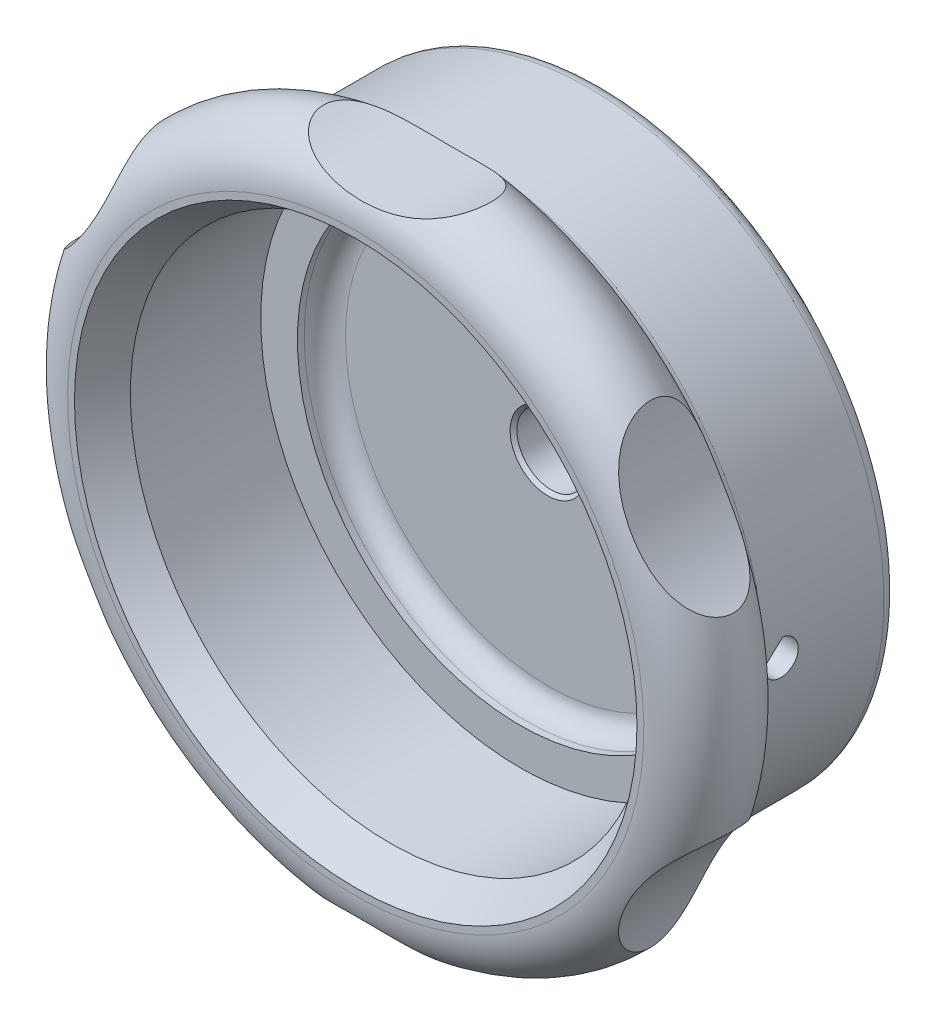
ISO-10303-21;
HEADER;
FILE_DESCRIPTION(('STEP AP214'),'2;1');
FILE_NAME('part.step','',(''),(''),'','','');
FILE_SCHEMA(('AUTOMOTIVE_DESIGN { 1 0 10303 214 1 1 1 1 }'));
ENDSEC;
DATA;
#1=APPLICATION_CONTEXT('core data for automotive mechanical design processes');
#2=APPLICATION_PROTOCOL_DEFINITION('international standard','automotive_design',2000,#1);
#3=PRODUCT_CONTEXT('',#1,'mechanical');
#4=PRODUCT('Part','Part','',(#3));
#5=PRODUCT_RELATED_PRODUCT_CATEGORY('part','',(#4));
#6=PRODUCT_DEFINITION_FORMATION('','',#4);
#7=PRODUCT_DEFINITION_CONTEXT('part definition',#1,'design');
#8=PRODUCT_DEFINITION('design','',#6,#7);
#9=PRODUCT_DEFINITION_SHAPE('','',#8);
#10=(LENGTH_UNIT() NAMED_UNIT(*) SI_UNIT(.MILLI.,.METRE.));
#11=(NAMED_UNIT(*) PLANE_ANGLE_UNIT() SI_UNIT($,.RADIAN.));
#12=(NAMED_UNIT(*) SI_UNIT($,.STERADIAN.) SOLID_ANGLE_UNIT());
#13=UNCERTAINTY_MEASURE_WITH_UNIT(LENGTH_MEASURE(1.E-05),#10,'distance_accuracy_value','');
#14=(GEOMETRIC_REPRESENTATION_CONTEXT(3) GLOBAL_UNCERTAINTY_ASSIGNED_CONTEXT((#13)) GLOBAL_UNIT_ASSIGNED_CONTEXT((#10,
#11,#12)) REPRESENTATION_CONTEXT('',''));
#15=CARTESIAN_POINT('',(0.,0.,0.));
#16=DIRECTION('',(0.,0.,1.));
#17=DIRECTION('',(1.,0.,0.));
#18=AXIS2_PLACEMENT_3D('',#15,#16,#17);
#19=CARTESIAN_POINT('',(19.,0.,25.));
#20=DIRECTION('',(0.,0.,-1.));
#21=DIRECTION('',(-1.,0.,0.));
#22=AXIS2_PLACEMENT_3D('',#19,#20,#21);
#23=PLANE('',#22);
#24=CARTESIAN_POINT('',(0.,0.,25.));
#25=DIRECTION('',(0.,0.,-1.));
#26=DIRECTION('',(-1.,0.,0.));
#27=AXIS2_PLACEMENT_3D('',#24,#25,#26);
#28=CIRCLE('',#27,5.5);
#29=CARTESIAN_POINT('',(-5.5,0.,25.));
#30=VERTEX_POINT('',#29);
#31=EDGE_CURVE('E9',#30,#30,#28,.T.);
#32=ORIENTED_EDGE('',*,*,#31,.T.);
#33=EDGE_LOOP('',(#32));
#34=FACE_BOUND('',#33,.T.);
#35=CARTESIAN_POINT('',(0.,0.,25.));
#36=DIRECTION('',(0.,0.,1.));
#37=DIRECTION('',(1.,0.,0.));
#38=AXIS2_PLACEMENT_3D('',#35,#36,#37);
#39=CIRCLE('',#38,29.5);
#40=CARTESIAN_POINT('',(29.5,0.,25.));
#41=VERTEX_POINT('',#40);
#42=EDGE_CURVE('E237',#41,#41,#39,.T.);
#43=ORIENTED_EDGE('',*,*,#42,.T.);
#44=EDGE_LOOP('',(#43));
#45=FACE_BOUND('',#44,.T.);
#46=ADVANCED_FACE('F14',(#34,#45),#23,.F.);
#47=CARTESIAN_POINT('',(0.,0.,65.5451324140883));
#48=DIRECTION('',(0.,0.,1.));
#49=DIRECTION('',(1.,0.,0.));
#50=AXIS2_PLACEMENT_3D('',#47,#48,#49);
#51=CYLINDRICAL_SURFACE('',#50,37.85);
#52=CARTESIAN_POINT('',(0.,0.,48.));
#53=DIRECTION('',(0.,0.,1.));
#54=DIRECTION('',(1.,0.,0.));
#55=AXIS2_PLACEMENT_3D('',#52,#53,#54);
#56=CIRCLE('',#55,37.85);
#57=CARTESIAN_POINT('',(37.85,0.,48.));
#58=VERTEX_POINT('',#57);
#59=EDGE_CURVE('E229',#58,#58,#56,.T.);
#60=ORIENTED_EDGE('',*,*,#59,.T.);
#61=EDGE_LOOP('',(#60));
#62=FACE_BOUND('',#61,.T.);
#63=CARTESIAN_POINT('',(0.,0.,29.));
#64=DIRECTION('',(0.,0.,1.));
#65=DIRECTION('',(1.,0.,0.));
#66=AXIS2_PLACEMENT_3D('',#63,#64,#65);
#67=CIRCLE('',#66,37.85);
#68=CARTESIAN_POINT('',(37.85,0.,29.));
#69=VERTEX_POINT('',#68);
#70=EDGE_CURVE('E227',#69,#69,#67,.T.);
#71=ORIENTED_EDGE('',*,*,#70,.F.);
#72=EDGE_LOOP('',(#71));
#73=FACE_BOUND('',#72,.T.);
#74=CARTESIAN_POINT('',(37.7673470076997,2.5,33.9901776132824));
#75=CARTESIAN_POINT('',(37.7673481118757,2.49999383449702,33.849915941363));
#76=CARTESIAN_POINT('',(37.7681367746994,2.4881563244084,33.7095564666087));
#77=CARTESIAN_POINT('',(37.7712065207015,2.44110473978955,33.4327143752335));
#78=CARTESIAN_POINT('',(37.7734893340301,2.40586356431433,33.2962364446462));
#79=CARTESIAN_POINT('',(37.7792876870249,2.31302236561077,33.0312075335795));
#80=CARTESIAN_POINT('',(37.7828025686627,2.25543427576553,32.9026523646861));
#81=CARTESIAN_POINT('',(37.7906681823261,2.11955357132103,32.6570663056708));
#82=CARTESIAN_POINT('',(37.7950187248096,2.04126565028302,32.5400328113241));
#83=CARTESIAN_POINT('',(37.8040736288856,1.86606531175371,32.3205844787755));
#84=CARTESIAN_POINT('',(37.8087785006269,1.76912571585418,32.2181913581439));
#85=CARTESIAN_POINT('',(37.8180072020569,1.55943017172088,32.0311163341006));
#86=CARTESIAN_POINT('',(37.8225310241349,1.44667355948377,31.9464351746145));
#87=CARTESIAN_POINT('',(37.8308923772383,1.2084210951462,31.7971202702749));
#88=CARTESIAN_POINT('',(37.8347292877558,1.08291388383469,31.7325046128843));
#89=CARTESIAN_POINT('',(37.8412790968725,0.822802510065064,31.6252707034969));
#90=CARTESIAN_POINT('',(37.8439920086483,0.68819845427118,31.5826521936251));
#91=CARTESIAN_POINT('',(37.847984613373,0.413924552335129,31.5206829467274));
#92=CARTESIAN_POINT('',(37.8492664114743,0.274262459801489,31.5012980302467));
#93=CARTESIAN_POINT('',(37.8502594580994,-0.00633873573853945,31.4862406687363));
#94=CARTESIAN_POINT('',(37.8499707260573,-0.147277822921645,31.4905679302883));
#95=CARTESIAN_POINT('',(37.8478569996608,-0.426200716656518,31.5227839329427));
#96=CARTESIAN_POINT('',(37.8460344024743,-0.564188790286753,31.5506359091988));
#97=CARTESIAN_POINT('',(37.84106087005,-0.833526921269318,31.6290536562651));
#98=CARTESIAN_POINT('',(37.8379099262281,-0.964876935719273,31.6796195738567));
#99=CARTESIAN_POINT('',(37.8306303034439,-1.21732826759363,31.8020713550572));
#100=CARTESIAN_POINT('',(37.82650086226,-1.33842149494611,31.8739738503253));
#101=CARTESIAN_POINT('',(37.817728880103,-1.56683351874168,32.0370456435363));
#102=CARTESIAN_POINT('',(37.8130863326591,-1.67415214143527,32.1282151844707));
#103=CARTESIAN_POINT('',(37.8038000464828,-1.8721832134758,32.3274406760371));
#104=CARTESIAN_POINT('',(37.7991563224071,-1.96286355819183,32.4355285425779));
#105=CARTESIAN_POINT('',(37.7904000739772,-2.12479638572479,32.6654107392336));
#106=CARTESIAN_POINT('',(37.7862875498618,-2.19604885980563,32.7872050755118));
#107=CARTESIAN_POINT('',(37.7790581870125,-2.31710122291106,33.0410636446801));
#108=CARTESIAN_POINT('',(37.7759414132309,-2.36689971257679,33.1731285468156));
#109=CARTESIAN_POINT('',(37.7710572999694,-2.44360810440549,33.4437698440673));
#110=CARTESIAN_POINT('',(37.7692899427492,-2.47051830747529,33.5823461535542));
#111=CARTESIAN_POINT('',(37.7673073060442,-2.50064614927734,33.861796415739));
#112=CARTESIAN_POINT('',(37.7670891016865,-2.50390843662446,34.0026655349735));
#113=CARTESIAN_POINT('',(37.7682217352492,-2.48676454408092,34.2829489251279));
#114=CARTESIAN_POINT('',(37.769572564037,-2.46635850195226,34.4223632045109));
#115=CARTESIAN_POINT('',(37.7736883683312,-2.40249431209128,34.6956529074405));
#116=CARTESIAN_POINT('',(37.7764520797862,-2.35905676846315,34.8295331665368));
#117=CARTESIAN_POINT('',(37.7830811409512,-2.25038348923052,35.0881037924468));
#118=CARTESIAN_POINT('',(37.7869465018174,-2.18514753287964,35.2127940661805));
#119=CARTESIAN_POINT('',(37.7953503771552,-2.03461530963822,35.449650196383));
#120=CARTESIAN_POINT('',(37.7998898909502,-1.94928915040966,35.5617970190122));
#121=CARTESIAN_POINT('',(37.8091270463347,-1.76104207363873,35.770190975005));
#122=CARTESIAN_POINT('',(37.8138246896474,-1.65812096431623,35.866437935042));
#123=CARTESIAN_POINT('',(37.8228573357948,-1.43741326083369,36.0404511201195));
#124=CARTESIAN_POINT('',(37.8271917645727,-1.31960384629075,36.1181884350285));
#125=CARTESIAN_POINT('',(37.8350013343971,-1.07257830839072,36.2527777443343));
#126=CARTESIAN_POINT('',(37.8384764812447,-0.943362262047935,36.3096298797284));
#127=CARTESIAN_POINT('',(37.8441731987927,-0.677297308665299,36.400784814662));
#128=CARTESIAN_POINT('',(37.8463957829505,-0.540454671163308,36.4351058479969));
#129=CARTESIAN_POINT('',(37.8493409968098,-0.262934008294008,36.480283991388));
#130=CARTESIAN_POINT('',(37.8500636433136,-0.122256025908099,36.4911413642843));
#131=CARTESIAN_POINT('',(37.8499276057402,0.158656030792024,36.4890813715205));
#132=CARTESIAN_POINT('',(37.8490719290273,0.298890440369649,36.4762092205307));
#133=CARTESIAN_POINT('',(37.8458814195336,0.575201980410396,36.4271494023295));
#134=CARTESIAN_POINT('',(37.8435465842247,0.71127910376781,36.390961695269));
#135=CARTESIAN_POINT('',(37.8376601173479,0.97541950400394,36.2963084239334));
#136=CARTESIAN_POINT('',(37.8341085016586,1.10348288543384,36.237843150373));
#137=CARTESIAN_POINT('',(37.8261870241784,1.34798217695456,36.1003003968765));
#138=CARTESIAN_POINT('',(37.821817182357,1.46441837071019,36.0212234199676));
#139=CARTESIAN_POINT('',(37.8127407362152,1.68258791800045,35.8445341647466));
#140=CARTESIAN_POINT('',(37.8080335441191,1.78429462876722,35.7468890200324));
#141=CARTESIAN_POINT('',(37.7988177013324,1.96990898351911,35.5358827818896));
#142=CARTESIAN_POINT('',(37.7943090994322,2.05381227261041,35.4225178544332));
#143=CARTESIAN_POINT('',(37.7859942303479,2.20150776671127,35.1831471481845));
#144=CARTESIAN_POINT('',(37.7821889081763,2.26527299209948,35.0571247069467));
#145=CARTESIAN_POINT('',(37.7757234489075,2.37066060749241,34.7962280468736));
#146=CARTESIAN_POINT('',(37.7730619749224,2.41230886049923,34.6613643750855));
#147=CARTESIAN_POINT('',(37.7698811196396,2.46148802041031,34.4364295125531));
#148=CARTESIAN_POINT('',(37.7689350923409,2.47591125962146,34.3478112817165));
#149=CARTESIAN_POINT('',(37.7676676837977,2.49516921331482,34.1695345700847));
#150=CARTESIAN_POINT('',(37.7673463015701,2.5000039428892,34.0798760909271));
#151=CARTESIAN_POINT('',(37.7673470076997,2.5,33.9901776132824));
#152=B_SPLINE_CURVE_WITH_KNOTS('',3,(#74,#75,#76,#77,#78,#79,#80,#81,#82,#83,#84,#85,#86,#87,
#88,#89,#90,#91,#92,#93,#94,#95,#96,#97,#98,#99,#100,#101,#102,#103,#104,#105,#106,#107,#108,
#109,#110,#111,#112,#113,#114,#115,#116,#117,#118,#119,#120,#121,#122,#123,#124,#125,#126,#127,
#128,#129,#130,#131,#132,#133,#134,#135,#136,#137,#138,#139,#140,#141,#142,#143,#144,#145,#146,
#147,#148,#149,#150,#151),.UNSPECIFIED.,.T.,.F.,(4,2,2,2,2,2,2,2,2,2,2,2,2,2,2,2,2,2,2,2,2,2,2,
2,2,2,2,2,2,2,2,2,2,2,2,2,2,2,4),(0.,0.420457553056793,0.841402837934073,1.26212364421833,
1.68274913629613,2.10399225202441,2.52525305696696,2.94689250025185,3.36852700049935,
3.78954046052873,4.21054871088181,4.63090021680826,5.05125443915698,5.47193718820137,
5.89262524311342,6.31411669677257,6.73560833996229,7.15712747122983,7.57864106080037,
7.99935860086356,8.42007369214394,8.84041304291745,9.26075665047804,9.68172968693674,
10.1027073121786,10.5243382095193,10.9459662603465,11.3672526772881,11.7885343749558,
12.2090141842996,12.6294947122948,13.0499697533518,13.470434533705,13.8916506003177,
14.3129695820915,14.7348506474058,15.1562372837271,15.4251237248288,15.6940097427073),.UNSPECIFIED.);
#153=CARTESIAN_POINT('',(37.7673470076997,2.5,33.9901776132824));
#154=VERTEX_POINT('',#153);
#155=EDGE_CURVE('E53',#154,#154,#152,.T.);
#156=ORIENTED_EDGE('',*,*,#155,.F.);
#157=EDGE_LOOP('',(#156));
#158=FACE_BOUND('',#157,.T.);
#159=ADVANCED_FACE('F195',(#62,#73,#158),#51,.F.);
#160=CARTESIAN_POINT('',(0.,0.,53.));
#161=DIRECTION('',(0.,0.,1.));
#162=DIRECTION('',(1.,0.,0.));
#163=AXIS2_PLACEMENT_3D('',#160,#161,#162);
#164=CONICAL_SURFACE('',#163,41.,0.562186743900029);
#165=ORIENTED_EDGE('',*,*,#59,.F.);
#166=EDGE_LOOP('',(#165));
#167=FACE_BOUND('',#166,.T.);
#168=CARTESIAN_POINT('',(0.,0.,53.));
#169=DIRECTION('',(0.,0.,1.));
#170=DIRECTION('',(1.,0.,0.));
#171=AXIS2_PLACEMENT_3D('',#168,#169,#170);
#172=CIRCLE('',#171,41.);
#173=CARTESIAN_POINT('',(41.,0.,53.));
#174=VERTEX_POINT('',#173);
#175=EDGE_CURVE('E88',#174,#174,#172,.T.);
#176=ORIENTED_EDGE('',*,*,#175,.T.);
#177=EDGE_LOOP('',(#176));
#178=FACE_BOUND('',#177,.T.);
#179=ADVANCED_FACE('F68',(#167,#178),#164,.F.);
#180=CARTESIAN_POINT('',(37.85,0.,29.));
#181=DIRECTION('',(0.,0.,-1.));
#182=DIRECTION('',(-1.,0.,0.));
#183=AXIS2_PLACEMENT_3D('',#180,#181,#182);
#184=PLANE('',#183);
#185=CARTESIAN_POINT('',(0.,0.,29.));
#186=DIRECTION('',(0.,0.,1.));
#187=DIRECTION('',(1.,0.,0.));
#188=AXIS2_PLACEMENT_3D('',#185,#186,#187);
#189=CIRCLE('',#188,32.5);
#190=CARTESIAN_POINT('',(32.5,0.,29.));
#191=VERTEX_POINT('',#190);
#192=EDGE_CURVE('E224',#191,#191,#189,.T.);
#193=ORIENTED_EDGE('',*,*,#192,.F.);
#194=EDGE_LOOP('',(#193));
#195=FACE_BOUND('',#194,.T.);
#196=ORIENTED_EDGE('',*,*,#70,.T.);
#197=EDGE_LOOP('',(#196));
#198=FACE_BOUND('',#197,.T.);
#199=ADVANCED_FACE('F211',(#195,#198),#184,.F.);
#200=CARTESIAN_POINT('',(0.,0.,65.5451324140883));
#201=DIRECTION('',(0.,0.,1.));
#202=DIRECTION('',(1.,0.,0.));
#203=AXIS2_PLACEMENT_3D('',#200,#201,#202);
#204=CYLINDRICAL_SURFACE('',#203,32.5);
#205=CARTESIAN_POINT('',(0.,0.,28.));
#206=DIRECTION('',(0.,0.,1.));
#207=DIRECTION('',(1.,0.,0.));
#208=AXIS2_PLACEMENT_3D('',#205,#206,#207);
#209=CIRCLE('',#208,32.5);
#210=CARTESIAN_POINT('',(32.5,0.,28.));
#211=VERTEX_POINT('',#210);
#212=EDGE_CURVE('E232',#211,#211,#209,.T.);
#213=ORIENTED_EDGE('',*,*,#212,.F.);
#214=EDGE_LOOP('',(#213));
#215=FACE_BOUND('',#214,.T.);
#216=ORIENTED_EDGE('',*,*,#192,.T.);
#217=EDGE_LOOP('',(#216));
#218=FACE_BOUND('',#217,.T.);
#219=ADVANCED_FACE('F207',(#215,#218),#204,.F.);
#220=CARTESIAN_POINT('',(0.,0.,28.));
#221=DIRECTION('',(0.,0.,1.));
#222=DIRECTION('',(1.,0.,0.));
#223=AXIS2_PLACEMENT_3D('',#220,#221,#222);
#224=TOROIDAL_SURFACE('',#223,29.5,3.);
#225=ORIENTED_EDGE('',*,*,#42,.F.);
#226=EDGE_LOOP('',(#225));
#227=FACE_BOUND('',#226,.T.);
#228=ORIENTED_EDGE('',*,*,#212,.T.);
#229=EDGE_LOOP('',(#228));
#230=FACE_BOUND('',#229,.T.);
#231=ADVANCED_FACE('F97',(#227,#230),#224,.F.);
#232=CARTESIAN_POINT('',(0.,0.,68.2114374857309));
#233=DIRECTION('',(0.,0.,1.));
#234=DIRECTION('',(0.,1.,0.));
#235=AXIS2_PLACEMENT_3D('',#232,#233,#234);
#236=CYLINDRICAL_SURFACE('',#235,19.0000000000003);
#237=CARTESIAN_POINT('',(0.,19.0000000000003,5.51530798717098));
#238=CARTESIAN_POINT('',(-0.139048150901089,18.9999980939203,5.53077255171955));
#239=CARTESIAN_POINT('',(-0.276881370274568,18.9984578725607,5.55794650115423));
#240=CARTESIAN_POINT('',(-0.546104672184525,18.992629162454,5.63496264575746));
#241=CARTESIAN_POINT('',(-0.677487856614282,18.9883377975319,5.68482854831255));
#242=CARTESIAN_POINT('',(-0.929916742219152,18.9776502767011,5.80574305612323));
#243=CARTESIAN_POINT('',(-1.05096957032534,18.9712555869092,5.87677690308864));
#244=CARTESIAN_POINT('',(-1.27943905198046,18.9572191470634,6.03800407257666));
#245=CARTESIAN_POINT('',(-1.38685806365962,18.9495776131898,6.12819407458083));
#246=CARTESIAN_POINT('',(-1.58562853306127,18.9339851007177,6.32572556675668));
#247=CARTESIAN_POINT('',(-1.67689615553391,18.9260327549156,6.43315132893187));
#248=CARTESIAN_POINT('',(-1.84013960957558,18.9108600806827,6.66183095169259));
#249=CARTESIAN_POINT('',(-1.91211474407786,18.9036397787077,6.78308531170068));
#250=CARTESIAN_POINT('',(-2.0348154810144,18.8908273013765,7.03622596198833));
#251=CARTESIAN_POINT('',(-2.08550787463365,18.8852376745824,7.16812848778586));
#252=CARTESIAN_POINT('',(-2.16399540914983,18.8764058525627,7.43865271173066));
#253=CARTESIAN_POINT('',(-2.19179151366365,18.8731635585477,7.57727412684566));
#254=CARTESIAN_POINT('',(-2.22356826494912,18.8694462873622,7.85644484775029));
#255=CARTESIAN_POINT('',(-2.22768544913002,18.8689554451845,7.99697840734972));
#256=CARTESIAN_POINT('',(-2.21234779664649,18.8707597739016,8.27673243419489));
#257=CARTESIAN_POINT('',(-2.19289344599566,18.8730548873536,8.41595292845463));
#258=CARTESIAN_POINT('',(-2.13108734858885,18.8801329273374,8.68868907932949));
#259=CARTESIAN_POINT('',(-2.08880677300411,18.884908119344,8.82222108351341));
#260=CARTESIAN_POINT('',(-1.98261870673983,18.896350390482,9.08030261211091));
#261=CARTESIAN_POINT('',(-1.91871045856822,18.9030175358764,9.20485182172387));
#262=CARTESIAN_POINT('',(-1.77071835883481,18.9174546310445,9.44208984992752));
#263=CARTESIAN_POINT('',(-1.68653887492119,18.9252297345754,9.55471869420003));
#264=CARTESIAN_POINT('',(-1.50052410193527,18.940884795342,9.76430191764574));
#265=CARTESIAN_POINT('',(-1.39868825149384,18.9487647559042,9.86125579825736));
#266=CARTESIAN_POINT('',(-1.17967934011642,18.9636609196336,10.0371875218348));
#267=CARTESIAN_POINT('',(-1.06243775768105,18.9706729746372,10.1160804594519));
#268=CARTESIAN_POINT('',(-0.816280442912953,18.9828567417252,10.2530529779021));
#269=CARTESIAN_POINT('',(-0.68736503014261,18.9880285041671,10.311133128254));
#270=CARTESIAN_POINT('',(-0.422020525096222,18.9957741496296,10.4046105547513));
#271=CARTESIAN_POINT('',(-0.285621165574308,18.9983576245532,10.4400914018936));
#272=CARTESIAN_POINT('',(-0.00878258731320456,19.0005019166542,10.4876673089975));
#273=CARTESIAN_POINT('',(0.131656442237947,19.000062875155,10.49976346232));
#274=CARTESIAN_POINT('',(0.411599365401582,18.9960536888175,10.5002281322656));
#275=CARTESIAN_POINT('',(0.551103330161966,18.9925041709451,10.4887522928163));
#276=CARTESIAN_POINT('',(0.826149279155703,18.9825294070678,10.4427517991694));
#277=CARTESIAN_POINT('',(0.961691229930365,18.976104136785,10.4082269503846));
#278=CARTESIAN_POINT('',(1.22519771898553,18.9609162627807,10.3170955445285));
#279=CARTESIAN_POINT('',(1.35315176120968,18.9521505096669,10.260459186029));
#280=CARTESIAN_POINT('',(1.5977616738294,18.9330987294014,10.126734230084));
#281=CARTESIAN_POINT('',(1.71441691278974,18.9228126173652,10.0496444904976));
#282=CARTESIAN_POINT('',(1.9341575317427,18.9016226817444,9.87643939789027));
#283=CARTESIAN_POINT('',(2.0371220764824,18.8907144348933,9.78017124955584));
#284=CARTESIAN_POINT('',(2.22547160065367,18.8694536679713,9.57169056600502));
#285=CARTESIAN_POINT('',(2.31085614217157,18.8591011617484,9.45947763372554));
#286=CARTESIAN_POINT('',(2.46186485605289,18.8399854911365,9.22184226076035));
#287=CARTESIAN_POINT('',(2.52742736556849,18.8312273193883,9.09638020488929));
#288=CARTESIAN_POINT('',(2.6365092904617,18.8162660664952,8.83607147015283));
#289=CARTESIAN_POINT('',(2.68002991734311,18.8100628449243,8.70122530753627));
#290=CARTESIAN_POINT('',(2.74347220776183,18.8009146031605,8.42706590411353));
#291=CARTESIAN_POINT('',(2.76357086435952,18.7979451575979,8.2877944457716));
#292=CARTESIAN_POINT('',(2.78015174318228,18.7955002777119,8.00782545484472));
#293=CARTESIAN_POINT('',(2.7766351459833,18.7960246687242,7.86712799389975));
#294=CARTESIAN_POINT('',(2.74621454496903,18.8004928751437,7.58943793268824));
#295=CARTESIAN_POINT('',(2.71948977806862,18.804410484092,7.45242521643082));
#296=CARTESIAN_POINT('',(2.64369535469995,18.8152153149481,7.18485182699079));
#297=CARTESIAN_POINT('',(2.59462517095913,18.8221026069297,7.05429130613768));
#298=CARTESIAN_POINT('',(2.47535734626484,18.8381586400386,6.8027959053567));
#299=CARTESIAN_POINT('',(2.40508566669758,18.8473353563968,6.6818966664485));
#300=CARTESIAN_POINT('',(2.24547058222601,18.8670163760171,6.45354683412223));
#301=CARTESIAN_POINT('',(2.15612661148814,18.8775207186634,6.34609663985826));
#302=CARTESIAN_POINT('',(1.95990720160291,18.8989040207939,6.1466237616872));
#303=CARTESIAN_POINT('',(1.85287435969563,18.9097855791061,6.05475614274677));
#304=CARTESIAN_POINT('',(1.62482397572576,18.9307431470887,5.89024256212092));
#305=CARTESIAN_POINT('',(1.50380332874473,18.940818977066,5.81760087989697));
#306=CARTESIAN_POINT('',(1.25087682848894,18.9592039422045,5.69349415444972));
#307=CARTESIAN_POINT('',(1.11894603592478,18.9675088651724,5.64207933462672));
#308=CARTESIAN_POINT('',(0.848272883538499,18.981536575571,5.56224722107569));
#309=CARTESIAN_POINT('',(0.709538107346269,18.9872621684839,5.53380491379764));
#310=CARTESIAN_POINT('',(0.474986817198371,18.9942983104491,5.50609449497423));
#311=CARTESIAN_POINT('',(0.379912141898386,18.9964395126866,5.50034078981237));
#312=CARTESIAN_POINT('',(0.18970430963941,18.9992909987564,5.49968861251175));
#313=CARTESIAN_POINT('',(0.0945711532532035,19.0000012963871,5.50479003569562));
#314=CARTESIAN_POINT('',(0.,19.0000000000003,5.51530798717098));
#315=B_SPLINE_CURVE_WITH_KNOTS('',3,(#237,#238,#239,#240,#241,#242,#243,#244,#245,#246,#247,
#248,#249,#250,#251,#252,#253,#254,#255,#256,#257,#258,#259,#260,#261,#262,#263,#264,#265,#266,
#267,#268,#269,#270,#271,#272,#273,#274,#275,#276,#277,#278,#279,#280,#281,#282,#283,#284,#285,
#286,#287,#288,#289,#290,#291,#292,#293,#294,#295,#296,#297,#298,#299,#300,#301,#302,#303,#304,
#305,#306,#307,#308,#309,#310,#311,#312,#313,#314),.UNSPECIFIED.,.T.,.F.,(4,2,2,2,2,2,2,2,2,2,2,
2,2,2,2,2,2,2,2,2,2,2,2,2,2,2,2,2,2,2,2,2,2,2,2,2,2,2,4),(0.,0.419368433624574,0.83917601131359,
1.25869158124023,1.67813449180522,2.09969448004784,2.52126969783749,2.94350030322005,
3.3657131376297,3.78548894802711,4.20525610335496,4.62372193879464,5.04220243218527,
5.46269723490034,5.88320540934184,6.30565157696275,6.72808618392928,7.14894943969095,
7.56979301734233,7.98786673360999,8.40594397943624,8.82458665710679,9.24325271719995,
9.66539826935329,10.0875543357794,10.5110104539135,10.9344432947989,11.3546551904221,
11.7748460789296,12.1918204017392,12.6088045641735,13.0272620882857,13.4457320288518,
13.8681488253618,14.2906595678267,14.7141643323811,15.1372073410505,15.4224361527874,
15.7076622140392),.UNSPECIFIED.);
#316=CARTESIAN_POINT('',(0.,19.0000000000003,5.51530798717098));
#317=VERTEX_POINT('',#316);
#318=EDGE_CURVE('E105',#317,#317,#315,.T.);
#319=ORIENTED_EDGE('',*,*,#318,.F.);
#320=EDGE_LOOP('',(#319));
#321=FACE_BOUND('',#320,.T.);
#322=CARTESIAN_POINT('',(0.,0.,15.));
#323=DIRECTION('',(0.,0.,1.));
#324=DIRECTION('',(0.,1.,0.));
#325=AXIS2_PLACEMENT_3D('',#322,#323,#324);
#326=CIRCLE('',#325,19.0000000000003);
#327=CARTESIAN_POINT('',(0.,19.0000000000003,15.));
#328=VERTEX_POINT('',#327);
#329=EDGE_CURVE('E271',#328,#328,#326,.T.);
#330=ORIENTED_EDGE('',*,*,#329,.F.);
#331=EDGE_LOOP('',(#330));
#332=FACE_BOUND('',#331,.T.);
#333=CARTESIAN_POINT('',(0.,0.,2.));
#334=DIRECTION('',(0.,0.,1.));
#335=DIRECTION('',(0.,1.,0.));
#336=AXIS2_PLACEMENT_3D('',#333,#334,#335);
#337=CIRCLE('',#336,19.0000000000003);
#338=CARTESIAN_POINT('',(0.,19.0000000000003,2.));
#339=VERTEX_POINT('',#338);
#340=EDGE_CURVE('E275',#339,#339,#337,.T.);
#341=ORIENTED_EDGE('',*,*,#340,.T.);
#342=EDGE_LOOP('',(#341));
#343=FACE_BOUND('',#342,.T.);
#344=CARTESIAN_POINT('',(18.8348082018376,-2.5,8.));
#345=CARTESIAN_POINT('',(18.8348103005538,-2.49999409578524,7.86022758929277));
#346=CARTESIAN_POINT('',(18.836380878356,-2.48823862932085,7.7203693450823));
#347=CARTESIAN_POINT('',(18.8424906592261,-2.4415321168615,7.44454955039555));
#348=CARTESIAN_POINT('',(18.8470329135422,-2.40655722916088,7.30859215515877));
#349=CARTESIAN_POINT('',(18.8585628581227,-2.31446464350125,7.04460715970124));
#350=CARTESIAN_POINT('',(18.8655488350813,-2.25736245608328,6.91657407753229));
#351=CARTESIAN_POINT('',(18.8811770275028,-2.12267026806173,6.67192984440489));
#352=CARTESIAN_POINT('',(18.8898189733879,-2.04508360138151,6.55531683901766));
#353=CARTESIAN_POINT('',(18.9078452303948,-1.87111107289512,6.33607899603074));
#354=CARTESIAN_POINT('',(18.9172333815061,-1.77462365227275,6.23353505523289));
#355=CARTESIAN_POINT('',(18.9356597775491,-1.56580738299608,6.04604554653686));
#356=CARTESIAN_POINT('',(18.9446980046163,-1.45347772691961,5.96110087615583));
#357=CARTESIAN_POINT('',(18.961445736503,-1.21565447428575,5.81092874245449));
#358=CARTESIAN_POINT('',(18.9691502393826,-1.09011404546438,5.74577484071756));
#359=CARTESIAN_POINT('',(18.9823201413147,-0.829754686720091,5.63750510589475));
#360=CARTESIAN_POINT('',(18.9877856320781,-0.694936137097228,5.5943883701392));
#361=CARTESIAN_POINT('',(18.9958346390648,-0.420676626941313,5.53165955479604));
#362=CARTESIAN_POINT('',(18.9984346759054,-0.281266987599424,5.51191268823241));
#363=CARTESIAN_POINT('',(19.0005162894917,-0.00109010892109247,5.49606623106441));
#364=CARTESIAN_POINT('',(18.999998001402,0.139677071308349,5.49996561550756));
#365=CARTESIAN_POINT('',(18.9959146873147,0.41765549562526,5.53119335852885));
#366=CARTESIAN_POINT('',(18.9923685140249,0.554883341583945,5.55837674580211));
#367=CARTESIAN_POINT('',(18.982648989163,0.822812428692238,5.63517400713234));
#368=CARTESIAN_POINT('',(18.9764755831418,0.953513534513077,5.68478834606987));
#369=CARTESIAN_POINT('',(18.9621627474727,1.2051253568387,5.8051918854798));
#370=CARTESIAN_POINT('',(18.9540175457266,1.32600591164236,5.87604340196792));
#371=CARTESIAN_POINT('',(18.9366715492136,1.55421628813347,6.03686471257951));
#372=CARTESIAN_POINT('',(18.9274707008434,1.66154542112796,6.12683547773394));
#373=CARTESIAN_POINT('',(18.9089599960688,1.86045869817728,6.3241522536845));
#374=CARTESIAN_POINT('',(18.8996498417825,1.95191747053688,6.43162466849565));
#375=CARTESIAN_POINT('',(18.8820383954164,2.11551832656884,6.66046095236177));
#376=CARTESIAN_POINT('',(18.8737371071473,2.18766033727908,6.78182487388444));
#377=CARTESIAN_POINT('',(18.8590834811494,2.31058937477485,7.03511545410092));
#378=CARTESIAN_POINT('',(18.8527321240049,2.36136566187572,7.16704738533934));
#379=CARTESIAN_POINT('',(18.8427161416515,2.44000706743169,7.43766772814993));
#380=CARTESIAN_POINT('',(18.8390513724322,2.46787341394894,7.57635577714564));
#381=CARTESIAN_POINT('',(18.8348501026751,2.49973643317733,7.85544222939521));
#382=CARTESIAN_POINT('',(18.8342904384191,2.50390985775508,7.99582011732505));
#383=CARTESIAN_POINT('',(18.8363014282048,2.48873557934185,8.27527311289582));
#384=CARTESIAN_POINT('',(18.8388720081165,2.46938843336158,8.41434825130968));
#385=CARTESIAN_POINT('',(18.8468326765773,2.40787130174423,8.68671384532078));
#386=CARTESIAN_POINT('',(18.8522121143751,2.36578750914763,8.82002410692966));
#387=CARTESIAN_POINT('',(18.865175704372,2.26008064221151,9.07769659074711));
#388=CARTESIAN_POINT('',(18.8727599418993,2.19645673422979,9.20205846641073));
#389=CARTESIAN_POINT('',(18.8893338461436,2.04904355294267,9.43910187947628));
#390=CARTESIAN_POINT('',(18.8983314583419,1.96513873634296,9.55171099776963));
#391=CARTESIAN_POINT('',(18.9166936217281,1.77970815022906,9.76131206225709));
#392=CARTESIAN_POINT('',(18.9260581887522,1.67818161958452,9.85830333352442));
#393=CARTESIAN_POINT('',(18.944170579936,1.45961588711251,10.034539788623));
#394=CARTESIAN_POINT('',(18.9529141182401,1.34248242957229,10.1136685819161));
#395=CARTESIAN_POINT('',(18.9687346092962,1.09648411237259,10.2511271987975));
#396=CARTESIAN_POINT('',(18.9758115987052,0.967619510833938,10.3094574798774));
#397=CARTESIAN_POINT('',(18.9874826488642,0.702197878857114,10.4034726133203));
#398=CARTESIAN_POINT('',(18.9920839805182,0.565664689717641,10.4392238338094));
#399=CARTESIAN_POINT('',(18.9983155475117,0.288468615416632,10.4872816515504));
#400=CARTESIAN_POINT('',(18.999945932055,0.14780593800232,10.4995894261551));
#401=CARTESIAN_POINT('',(19.0000510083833,-0.132521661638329,10.5003873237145));
#402=CARTESIAN_POINT('',(18.9985494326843,-0.272186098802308,10.4890565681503));
#403=CARTESIAN_POINT('',(18.9926066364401,-0.547606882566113,10.4432795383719));
#404=CARTESIAN_POINT('',(18.9881654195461,-0.683363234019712,10.408833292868));
#405=CARTESIAN_POINT('',(18.9768400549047,-0.947084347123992,10.3178611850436));
#406=CARTESIAN_POINT('',(18.9699569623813,-1.07505244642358,10.2613448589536));
#407=CARTESIAN_POINT('',(18.9545084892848,-1.31971689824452,10.1278554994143));
#408=CARTESIAN_POINT('',(18.9459430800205,-1.43641305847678,10.05088211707));
#409=CARTESIAN_POINT('',(18.9280077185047,-1.65613473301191,9.87800438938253));
#410=CARTESIAN_POINT('',(18.9186323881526,-1.75905510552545,9.7819669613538));
#411=CARTESIAN_POINT('',(18.9001761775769,-1.94738775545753,9.57396529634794));
#412=CARTESIAN_POINT('',(18.8910953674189,-2.03279589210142,9.46199730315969));
#413=CARTESIAN_POINT('',(18.8742148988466,-2.18399681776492,9.22475904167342));
#414=CARTESIAN_POINT('',(18.8664208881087,-2.24970411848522,9.09943390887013));
#415=CARTESIAN_POINT('',(18.8530626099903,-2.35904458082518,8.83949246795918));
#416=CARTESIAN_POINT('',(18.8474959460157,-2.40270148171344,8.70488632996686));
#417=CARTESIAN_POINT('',(18.8405583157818,-2.45638258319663,8.47467086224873));
#418=CARTESIAN_POINT('',(18.8384129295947,-2.47271523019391,8.38050681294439));
#419=CARTESIAN_POINT('',(18.8355371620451,-2.49452590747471,8.19090851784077));
#420=CARTESIAN_POINT('',(18.8348067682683,-2.50000403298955,8.09547428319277));
#421=CARTESIAN_POINT('',(18.8348082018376,-2.5,8.));
#422=B_SPLINE_CURVE_WITH_KNOTS('',3,(#344,#345,#346,#347,#348,#349,#350,#351,#352,#353,#354,
#355,#356,#357,#358,#359,#360,#361,#362,#363,#364,#365,#366,#367,#368,#369,#370,#371,#372,#373,
#374,#375,#376,#377,#378,#379,#380,#381,#382,#383,#384,#385,#386,#387,#388,#389,#390,#391,#392,
#393,#394,#395,#396,#397,#398,#399,#400,#401,#402,#403,#404,#405,#406,#407,#408,#409,#410,#411,
#412,#413,#414,#415,#416,#417,#418,#419,#420,#421),.UNSPECIFIED.,.T.,.F.,(4,2,2,2,2,2,2,2,2,2,2,
2,2,2,2,2,2,2,2,2,2,2,2,2,2,2,2,2,2,2,2,2,2,2,2,2,2,2,4),(0.,0.418968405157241,0.8383676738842,
1.25747348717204,1.67651113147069,2.09786539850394,2.51924114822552,2.94216449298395,
3.36507051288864,3.78552532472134,4.20596191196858,4.6237996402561,5.04164602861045,
5.46073070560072,5.87983667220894,6.30211603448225,6.72439699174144,7.14688995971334,
7.56936027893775,7.98867473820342,8.40797926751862,8.82570528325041,9.2434474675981,
9.66362813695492,10.0838269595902,10.5066894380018,10.9295426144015,11.3511470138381,
11.7727302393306,12.1911305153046,12.6095302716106,13.0277494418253,13.4459757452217,
13.8672313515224,14.2885864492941,14.7117443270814,15.134445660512,15.4206327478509,
15.7068173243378),.UNSPECIFIED.);
#423=CARTESIAN_POINT('',(18.8348082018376,-2.5,8.));
#424=VERTEX_POINT('',#423);
#425=EDGE_CURVE('E79',#424,#424,#422,.T.);
#426=ORIENTED_EDGE('',*,*,#425,.F.);
#427=EDGE_LOOP('',(#426));
#428=FACE_BOUND('',#427,.T.);
#429=ADVANCED_FACE('F92',(#321,#332,#343,#428),#236,.T.);
#430=CARTESIAN_POINT('',(0.,0.,25.));
#431=DIRECTION('',(0.,0.,-1.));
#432=DIRECTION('',(0.,-1.,0.));
#433=AXIS2_PLACEMENT_3D('',#430,#431,#432);
#434=CYLINDRICAL_SURFACE('',#433,5.);
#435=CARTESIAN_POINT('',(0.,0.,0.500000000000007));
#436=DIRECTION('',(0.,0.,1.));
#437=DIRECTION('',(1.,0.,0.));
#438=AXIS2_PLACEMENT_3D('',#435,#436,#437);
#439=CIRCLE('',#438,5.);
#440=CARTESIAN_POINT('',(5.,0.,0.500000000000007));
#441=VERTEX_POINT('',#440);
#442=EDGE_CURVE('E34',#441,#441,#439,.F.);
#443=ORIENTED_EDGE('',*,*,#442,.T.);
#444=EDGE_LOOP('',(#443));
#445=FACE_BOUND('',#444,.T.);
#446=CARTESIAN_POINT('',(0.,0.,24.5));
#447=DIRECTION('',(0.,0.,-1.));
#448=DIRECTION('',(-1.,0.,0.));
#449=AXIS2_PLACEMENT_3D('',#446,#447,#448);
#450=CIRCLE('',#449,5.);
#451=CARTESIAN_POINT('',(-5.,0.,24.5));
#452=VERTEX_POINT('',#451);
#453=EDGE_CURVE('E30',#452,#452,#450,.F.);
#454=ORIENTED_EDGE('',*,*,#453,.T.);
#455=EDGE_LOOP('',(#454));
#456=FACE_BOUND('',#455,.T.);
#457=CARTESIAN_POINT('',(0.276234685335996,4.99236360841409,10.5));
#458=CARTESIAN_POINT('',(0.409629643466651,4.98497435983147,10.4999903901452));
#459=CARTESIAN_POINT('',(0.542904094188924,4.97218583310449,10.4892580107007));
#460=CARTESIAN_POINT('',(0.8048998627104,4.93656912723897,10.4470810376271));
#461=CARTESIAN_POINT('',(0.933610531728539,4.91371894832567,10.4155909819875));
#462=CARTESIAN_POINT('',(1.18232109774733,4.85985939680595,10.3336811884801));
#463=CARTESIAN_POINT('',(1.30235814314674,4.82888782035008,10.2833486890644));
#464=CARTESIAN_POINT('',(1.53184888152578,4.76106893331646,10.165659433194));
#465=CARTESIAN_POINT('',(1.6413042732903,4.72422256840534,10.0983054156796));
#466=CARTESIAN_POINT('',(1.85551722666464,4.6444648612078,9.94284264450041));
#467=CARTESIAN_POINT('',(1.95934087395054,4.60130688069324,9.85357368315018));
#468=CARTESIAN_POINT('',(2.15114572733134,4.51482716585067,9.65933301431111));
#469=CARTESIAN_POINT('',(2.23911111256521,4.47150531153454,9.55434581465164));
#470=CARTESIAN_POINT('',(2.40346558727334,4.38549918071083,9.32161051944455));
#471=CARTESIAN_POINT('',(2.47844722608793,4.34311926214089,9.19273374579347));
#472=CARTESIAN_POINT('',(2.57335976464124,4.2870940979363,8.98935810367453));
#473=CARTESIAN_POINT('',(2.60207379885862,4.26967432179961,8.91987760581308));
#474=CARTESIAN_POINT('',(2.65329632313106,4.23803305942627,8.77798120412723));
#475=CARTESIAN_POINT('',(2.67580914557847,4.22380934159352,8.70556739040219));
#476=CARTESIAN_POINT('',(2.7125271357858,4.20031293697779,8.56503800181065));
#477=CARTESIAN_POINT('',(2.72729931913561,4.19070892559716,8.49712560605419));
#478=CARTESIAN_POINT('',(2.75116659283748,4.17507921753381,8.35993803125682));
#479=CARTESIAN_POINT('',(2.76026504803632,4.16905140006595,8.29066368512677));
#480=CARTESIAN_POINT('',(2.77262261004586,4.16084380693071,8.15141514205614));
#481=CARTESIAN_POINT('',(2.77588609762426,4.15866114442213,8.08144150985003));
#482=CARTESIAN_POINT('',(2.77653073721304,4.1582293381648,7.94147908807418));
#483=CARTESIAN_POINT('',(2.77391255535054,4.15997974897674,7.87149030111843));
#484=CARTESIAN_POINT('',(2.75892360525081,4.16995283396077,7.68317179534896));
#485=CARTESIAN_POINT('',(2.74099381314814,4.18185838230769,7.56542182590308));
#486=CARTESIAN_POINT('',(2.68908037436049,4.21542059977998,7.3350458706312));
#487=CARTESIAN_POINT('',(2.65509019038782,4.23708123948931,7.22242199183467));
#488=CARTESIAN_POINT('',(2.57090128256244,4.28870409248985,7.00044269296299));
#489=CARTESIAN_POINT('',(2.52014609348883,4.31894541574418,6.89136517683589));
#490=CARTESIAN_POINT('',(2.40438677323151,4.38444335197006,6.68272039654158));
#491=CARTESIAN_POINT('',(2.33937612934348,4.41970225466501,6.5831575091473));
#492=CARTESIAN_POINT('',(2.18495346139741,4.49829090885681,6.37962619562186));
#493=CARTESIAN_POINT('',(2.09330160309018,4.5420094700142,6.27750082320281));
#494=CARTESIAN_POINT('',(1.89429029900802,4.62854726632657,6.08932794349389));
#495=CARTESIAN_POINT('',(1.78692024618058,4.6713658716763,6.0032913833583));
#496=CARTESIAN_POINT('',(1.54999737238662,4.75546042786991,5.8437645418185));
#497=CARTESIAN_POINT('',(1.41940218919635,4.79640124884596,5.77163035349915));
#498=CARTESIAN_POINT('',(1.1453101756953,4.86911739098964,5.65115671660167));
#499=CARTESIAN_POINT('',(1.00182363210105,4.90089993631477,5.60279849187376));
#500=CARTESIAN_POINT('',(0.718545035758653,4.95001286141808,5.53549730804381));
#501=CARTESIAN_POINT('',(0.579422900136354,4.9683183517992,5.5144587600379));
#502=CARTESIAN_POINT('',(0.298605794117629,4.99306035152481,5.49615138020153));
#503=CARTESIAN_POINT('',(0.156912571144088,4.99950463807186,5.49886696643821));
#504=CARTESIAN_POINT('',(-0.110417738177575,5.00039591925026,5.52678194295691));
#505=CARTESIAN_POINT('',(-0.236287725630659,4.99593780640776,5.54979242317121));
#506=CARTESIAN_POINT('',(-0.482455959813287,4.97819912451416,5.61450521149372));
#507=CARTESIAN_POINT('',(-0.602753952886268,4.96491815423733,5.65620836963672));
#508=CARTESIAN_POINT('',(-0.835834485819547,4.93106409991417,5.75732345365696));
#509=CARTESIAN_POINT('',(-0.948538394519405,4.91042555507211,5.81689356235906));
#510=CARTESIAN_POINT('',(-1.16289853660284,4.86412477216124,5.95184147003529));
#511=CARTESIAN_POINT('',(-1.26455068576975,4.83846068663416,6.02722508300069));
#512=CARTESIAN_POINT('',(-1.46325567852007,4.78230572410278,6.19919436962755));
#513=CARTESIAN_POINT('',(-1.55914543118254,4.7515892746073,6.29705169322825));
#514=CARTESIAN_POINT('',(-1.73381691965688,4.69067734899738,6.50722383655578));
#515=CARTESIAN_POINT('',(-1.81258899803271,4.66048217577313,6.61954676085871));
#516=CARTESIAN_POINT('',(-1.95466750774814,4.6027675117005,6.86251420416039));
#517=CARTESIAN_POINT('',(-2.01696667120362,4.57546636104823,6.99380490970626));
#518=CARTESIAN_POINT('',(-2.11815456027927,4.52951976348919,7.26651281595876));
#519=CARTESIAN_POINT('',(-2.15706361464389,4.51086680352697,7.40792110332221));
#520=CARTESIAN_POINT('',(-2.20776498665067,4.48625907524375,7.6863831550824));
#521=CARTESIAN_POINT('',(-2.22125475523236,4.479511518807,7.82305597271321));
#522=CARTESIAN_POINT('',(-2.22563400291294,4.47733951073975,8.09682965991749));
#523=CARTESIAN_POINT('',(-2.21653173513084,4.48191092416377,8.233930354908));
#524=CARTESIAN_POINT('',(-2.17776108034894,4.50086141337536,8.4938365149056));
#525=CARTESIAN_POINT('',(-2.14968727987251,4.51447875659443,8.61694266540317));
#526=CARTESIAN_POINT('',(-2.07577243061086,4.54893617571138,8.85662229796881));
#527=CARTESIAN_POINT('',(-2.02992608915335,4.56977840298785,8.97319382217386));
#528=CARTESIAN_POINT('',(-1.91895186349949,4.61751561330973,9.20348209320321));
#529=CARTESIAN_POINT('',(-1.85291629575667,4.64467671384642,9.31670457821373));
#530=CARTESIAN_POINT('',(-1.70433306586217,4.70123024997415,9.53113880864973));
#531=CARTESIAN_POINT('',(-1.62177790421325,4.73062369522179,9.63234506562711));
#532=CARTESIAN_POINT('',(-1.43353572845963,4.79120012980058,9.8294522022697));
#533=CARTESIAN_POINT('',(-1.32642560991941,4.82230179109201,9.92402708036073));
#534=CARTESIAN_POINT('',(-1.09677671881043,4.87966143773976,10.0941040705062));
#535=CARTESIAN_POINT('',(-0.974233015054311,4.90591786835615,10.16960006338));
#536=CARTESIAN_POINT('',(-0.718421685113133,4.94978736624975,10.2979970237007));
#537=CARTESIAN_POINT('',(-0.585327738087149,4.96751602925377,10.3511988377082));
#538=CARTESIAN_POINT('',(-0.379968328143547,4.98601881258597,10.4134067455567));
#539=CARTESIAN_POINT('',(-0.310609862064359,4.99083751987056,10.4312042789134));
#540=CARTESIAN_POINT('',(-0.170499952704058,4.99758244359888,10.4608008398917));
#541=CARTESIAN_POINT('',(-0.0997493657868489,4.99951038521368,10.4726034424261));
#542=CARTESIAN_POINT('',(0.021959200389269,5.00020800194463,10.4875577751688));
#543=CARTESIAN_POINT('',(0.0727333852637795,4.99972887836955,10.4922233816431));
#544=CARTESIAN_POINT('',(0.174422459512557,4.9972163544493,10.4984462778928));
#545=CARTESIAN_POINT('',(0.225337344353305,4.99518300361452,10.5000036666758));
#546=CARTESIAN_POINT('',(0.276234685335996,4.99236360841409,10.5));
#547=B_SPLINE_CURVE_WITH_KNOTS('',3,(#457,#458,#459,#460,#461,#462,#463,#464,#465,#466,#467,
#468,#469,#470,#471,#472,#473,#474,#475,#476,#477,#478,#479,#480,#481,#482,#483,#484,#485,#486,
#487,#488,#489,#490,#491,#492,#493,#494,#495,#496,#497,#498,#499,#500,#501,#502,#503,#504,#505,
#506,#507,#508,#509,#510,#511,#512,#513,#514,#515,#516,#517,#518,#519,#520,#521,#522,#523,#524,
#525,#526,#527,#528,#529,#530,#531,#532,#533,#534,#535,#536,#537,#538,#539,#540,#541,#542,#543,
#544,#545,#546),.UNSPECIFIED.,.T.,.F.,(4,2,2,2,2,2,2,2,2,2,2,2,2,2,2,2,2,2,2,2,2,2,2,2,2,2,2,2,
2,2,2,2,2,2,2,2,2,2,2,2,2,2,2,2,4),(0.,0.400597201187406,0.802074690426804,1.20171592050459,
1.60129288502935,2.03018717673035,2.45950701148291,2.92179091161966,3.15300653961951,
3.38406021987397,3.59422762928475,3.8042702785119,4.01415516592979,4.22401628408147,
4.58130210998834,4.93873349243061,5.30947555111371,5.68038734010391,6.11063326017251,
6.5411708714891,7.00282358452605,7.46411113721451,7.88738619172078,8.31038361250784,
8.69267329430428,9.07498036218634,9.46077739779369,9.84671652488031,10.266120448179,
10.6857603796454,11.1270449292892,11.5679453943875,11.978187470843,12.3882797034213,
12.76759767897,13.147028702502,13.5469534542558,13.9470601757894,14.3836629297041,
14.8204055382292,15.2510483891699,15.4660855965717,15.6809944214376,15.8338486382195,
15.9866979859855),.UNSPECIFIED.);
#548=CARTESIAN_POINT('',(0.276234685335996,4.99236360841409,10.5));
#549=VERTEX_POINT('',#548);
#550=EDGE_CURVE('E87',#549,#549,#547,.T.);
#551=ORIENTED_EDGE('',*,*,#550,.T.);
#552=EDGE_LOOP('',(#551));
#553=FACE_BOUND('',#552,.T.);
#554=CARTESIAN_POINT('',(4.33012701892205,-2.5,8.));
#555=CARTESIAN_POINT('',(4.33013982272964,-2.49998948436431,8.13026650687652));
#556=CARTESIAN_POINT('',(4.33609541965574,-2.48974954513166,8.2607027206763));
#557=CARTESIAN_POINT('',(4.35905877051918,-2.44930840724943,8.51756897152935));
#558=CARTESIAN_POINT('',(4.37608974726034,-2.41906526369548,8.64399000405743));
#559=CARTESIAN_POINT('',(4.41873376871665,-2.34024976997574,8.88862894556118));
#560=CARTESIAN_POINT('',(4.44430111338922,-2.29177485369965,9.00688657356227));
#561=CARTESIAN_POINT('',(4.50106659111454,-2.17816884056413,9.23356056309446));
#562=CARTESIAN_POINT('',(4.53226502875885,-2.11303684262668,9.34197639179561));
#563=CARTESIAN_POINT('',(4.59992173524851,-1.96166634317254,9.55576430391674));
#564=CARTESIAN_POINT('',(4.63660159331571,-1.87413008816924,9.66014783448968));
#565=CARTESIAN_POINT('',(4.70929956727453,-1.68313452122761,9.85352097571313));
#566=CARTESIAN_POINT('',(4.74531734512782,-1.57966731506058,9.94250290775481));
#567=CARTESIAN_POINT('',(4.81553692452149,-1.35122390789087,10.1084178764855));
#568=CARTESIAN_POINT('',(4.84945266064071,-1.22526797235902,10.1841344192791));
#569=CARTESIAN_POINT('',(4.90876890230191,-0.960392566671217,10.3128521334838));
#570=CARTESIAN_POINT('',(4.93417477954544,-0.821481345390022,10.3658676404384));
#571=CARTESIAN_POINT('',(4.97201153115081,-0.545112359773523,10.4437616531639));
#572=CARTESIAN_POINT('',(4.98523700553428,-0.408254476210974,10.470373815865));
#573=CARTESIAN_POINT('',(5.0001895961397,-0.131426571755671,10.5004152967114));
#574=CARTESIAN_POINT('',(5.0019236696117,0.00854151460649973,10.5038586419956));
#575=CARTESIAN_POINT('',(4.99407454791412,0.274581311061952,10.4881333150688));
#576=CARTESIAN_POINT('',(4.98546239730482,0.40080299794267,10.4709049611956));
#577=CARTESIAN_POINT('',(4.95935613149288,0.648284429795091,10.4177978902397));
#578=CARTESIAN_POINT('',(4.94186135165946,0.769543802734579,10.3819177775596));
#579=CARTESIAN_POINT('',(4.89928958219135,1.00577347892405,10.2922935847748));
#580=CARTESIAN_POINT('',(4.87411103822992,1.12063355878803,10.2383092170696));
#581=CARTESIAN_POINT('',(4.81844114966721,1.33994200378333,10.1143414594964));
#582=CARTESIAN_POINT('',(4.78794790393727,1.44438662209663,10.0443523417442));
#583=CARTESIAN_POINT('',(4.72110985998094,1.65043415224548,9.88276162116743));
#584=CARTESIAN_POINT('',(4.68448439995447,1.75083518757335,9.78974242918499));
#585=CARTESIAN_POINT('',(4.61135851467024,1.93526092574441,9.58852568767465));
#586=CARTESIAN_POINT('',(4.57485820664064,2.01927302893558,9.48031656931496));
#587=CARTESIAN_POINT('',(4.50360390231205,2.17376333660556,9.24337951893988));
#588=CARTESIAN_POINT('',(4.46910799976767,2.24304328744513,9.11378494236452));
#589=CARTESIAN_POINT('',(4.40938625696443,2.35829778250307,8.84265582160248));
#590=CARTESIAN_POINT('',(4.38415075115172,2.40429664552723,8.70113391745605));
#591=CARTESIAN_POINT('',(4.3486158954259,2.46795052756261,8.42196372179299));
#592=CARTESIAN_POINT('',(4.33729139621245,2.48756280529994,8.28489720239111));
#593=CARTESIAN_POINT('',(4.32794798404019,2.50379236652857,8.00899664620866));
#594=CARTESIAN_POINT('',(4.32991967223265,2.50042589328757,7.87016392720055));
#595=CARTESIAN_POINT('',(4.3458584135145,2.47259010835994,7.6108652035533));
#596=CARTESIAN_POINT('',(4.35848968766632,2.4504695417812,7.49005137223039));
#597=CARTESIAN_POINT('',(4.39235053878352,2.38924071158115,7.25408053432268));
#598=CARTESIAN_POINT('',(4.41358290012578,2.35012694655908,7.13892537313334));
#599=CARTESIAN_POINT('',(4.46340555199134,2.2541189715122,6.9114716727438));
#600=CARTESIAN_POINT('',(4.49229108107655,2.19648515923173,6.79955245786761));
#601=CARTESIAN_POINT('',(4.55390298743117,2.06571766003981,6.58632682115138));
#602=CARTESIAN_POINT('',(4.58663133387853,1.99257601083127,6.48502589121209));
#603=CARTESIAN_POINT('',(4.65719996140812,1.8220929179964,6.28255308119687));
#604=CARTESIAN_POINT('',(4.69516457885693,1.72286318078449,6.1830071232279));
#605=CARTESIAN_POINT('',(4.7683558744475,1.50851123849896,6.00146940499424));
#606=CARTESIAN_POINT('',(4.80358162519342,1.39338368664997,5.91948357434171));
#607=CARTESIAN_POINT('',(4.86853404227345,1.14633840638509,5.77356568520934));
#608=CARTESIAN_POINT('',(4.89809104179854,1.01405774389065,5.71016720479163));
#609=CARTESIAN_POINT('',(4.94708387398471,0.738805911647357,5.60715524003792));
#610=CARTESIAN_POINT('',(4.9665285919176,0.595844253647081,5.56752087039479));
#611=CARTESIAN_POINT('',(4.99168770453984,0.317449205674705,5.51657859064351));
#612=CARTESIAN_POINT('',(4.99849819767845,0.182528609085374,5.50300531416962));
#613=CARTESIAN_POINT('',(5.0010532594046,-0.0878149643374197,5.49789183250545));
#614=CARTESIAN_POINT('',(4.99680170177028,-0.22323774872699,5.50634391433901));
#615=CARTESIAN_POINT('',(4.97834922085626,-0.48134498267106,5.54354103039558));
#616=CARTESIAN_POINT('',(4.96482236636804,-0.604280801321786,5.57091217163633));
#617=CARTESIAN_POINT('',(4.92980234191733,-0.843614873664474,5.64331744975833));
#618=CARTESIAN_POINT('',(4.90830802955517,-0.960012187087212,5.68835411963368));
#619=CARTESIAN_POINT('',(4.85814826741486,-1.18855854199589,5.79681781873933));
#620=CARTESIAN_POINT('',(4.82921542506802,-1.30031295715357,5.86094902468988));
#621=CARTESIAN_POINT('',(4.76720333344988,-1.51193650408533,6.00489411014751));
#622=CARTESIAN_POINT('',(4.73412218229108,-1.611800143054,6.0847151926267));
#623=CARTESIAN_POINT('',(4.66321523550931,-1.80728542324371,6.26699579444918));
#624=CARTESIAN_POINT('',(4.62524489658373,-1.90149582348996,6.37091772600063));
#625=CARTESIAN_POINT('',(4.5515769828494,-2.07165660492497,6.59361528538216));
#626=CARTESIAN_POINT('',(4.51588143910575,-2.14759083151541,6.7124039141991));
#627=CARTESIAN_POINT('',(4.44998982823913,-2.28108393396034,6.96663611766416));
#628=CARTESIAN_POINT('',(4.42000320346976,-2.33798627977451,7.1024873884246));
#629=CARTESIAN_POINT('',(4.38370272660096,-2.40494911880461,7.31322264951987));
#630=CARTESIAN_POINT('',(4.3730548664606,-2.42419582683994,7.38455977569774));
#631=CARTESIAN_POINT('',(4.35507574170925,-2.45635087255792,7.52904069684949));
#632=CARTESIAN_POINT('',(4.34774215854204,-2.46926364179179,7.60218319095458));
#633=CARTESIAN_POINT('',(4.338237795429,-2.48591166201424,7.72950098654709));
#634=CARTESIAN_POINT('',(4.33520487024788,-2.49118864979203,7.78341632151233));
#635=CARTESIAN_POINT('',(4.33114674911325,-2.49823512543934,7.89154461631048));
#636=CARTESIAN_POINT('',(4.33012168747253,-2.50000437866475,7.94575759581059));
#637=CARTESIAN_POINT('',(4.33012701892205,-2.5,8.));
#638=B_SPLINE_CURVE_WITH_KNOTS('',3,(#554,#555,#556,#557,#558,#559,#560,#561,#562,#563,#564,
#565,#566,#567,#568,#569,#570,#571,#572,#573,#574,#575,#576,#577,#578,#579,#580,#581,#582,#583,
#584,#585,#586,#587,#588,#589,#590,#591,#592,#593,#594,#595,#596,#597,#598,#599,#600,#601,#602,
#603,#604,#605,#606,#607,#608,#609,#610,#611,#612,#613,#614,#615,#616,#617,#618,#619,#620,#621,
#622,#623,#624,#625,#626,#627,#628,#629,#630,#631,#632,#633,#634,#635,#636,#637),.UNSPECIFIED.,
.T.,.F.,(4,2,2,2,2,2,2,2,2,2,2,2,2,2,2,2,2,2,2,2,2,2,2,2,2,2,2,2,2,2,2,2,2,2,2,2,2,2,2,2,2,4),
(0.,0.390580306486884,0.781982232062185,1.17132148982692,1.56068181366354,1.9821557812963,
2.40383927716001,2.85394730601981,3.30377067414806,3.72158712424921,4.13915059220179,
4.52040243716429,4.90168281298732,5.28823836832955,5.67493248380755,6.098179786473,
6.52175120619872,6.97222104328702,7.4222193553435,7.83655727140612,8.25060232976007,
8.61935458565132,8.98822631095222,9.37418241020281,9.76033715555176,10.1951685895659,
10.6301466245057,11.0766045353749,11.5226694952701,11.927806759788,12.3328021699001,
12.7111106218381,13.0894733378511,13.4840187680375,13.8787457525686,14.3127560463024,
14.7471485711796,15.195268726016,15.4189244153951,15.6424233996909,15.8050484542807,
15.9676843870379),.UNSPECIFIED.);
#639=CARTESIAN_POINT('',(4.33012701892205,-2.5,8.));
#640=VERTEX_POINT('',#639);
#641=EDGE_CURVE('E46',#640,#640,#638,.T.);
#642=ORIENTED_EDGE('',*,*,#641,.F.);
#643=EDGE_LOOP('',(#642));
#644=FACE_BOUND('',#643,.T.);
#645=ADVANCED_FACE('F74',(#445,#456,#553,#644),#434,.F.);
#646=CARTESIAN_POINT('',(0.,0.,45.5));
#647=DIRECTION('',(0.,0.,1.));
#648=DIRECTION('',(0.,1.,0.));
#649=AXIS2_PLACEMENT_3D('',#646,#647,#648);
#650=TOROIDAL_SURFACE('',#649,42.,7.5);
#651=CARTESIAN_POINT('',(35.8680364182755,-31.9907708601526,49.9165584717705));
#652=CARTESIAN_POINT('',(35.920282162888,-31.7330488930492,50.0984905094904));
#653=CARTESIAN_POINT('',(35.9781145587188,-31.4652924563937,50.2644820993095));
#654=CARTESIAN_POINT('',(36.1050734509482,-30.9163451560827,50.5677706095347));
#655=CARTESIAN_POINT('',(36.1742132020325,-30.6351388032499,50.7050334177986));
#656=CARTESIAN_POINT('',(36.3239982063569,-30.0632520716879,50.9548193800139));
#657=CARTESIAN_POINT('',(36.4047001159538,-29.7725308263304,51.0672133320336));
#658=CARTESIAN_POINT('',(36.5770973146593,-29.1868558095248,51.2698918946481));
#659=CARTESIAN_POINT('',(36.6687898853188,-28.8919031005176,51.3601819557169));
#660=CARTESIAN_POINT('',(36.8396070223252,-28.371414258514,51.5025012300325));
#661=CARTESIAN_POINT('',(36.9164694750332,-28.1462004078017,51.5585128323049));
#662=CARTESIAN_POINT('',(37.0762795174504,-27.6957143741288,51.6609019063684));
#663=CARTESIAN_POINT('',(37.1592278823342,-27.4704421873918,51.707278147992));
#664=CARTESIAN_POINT('',(37.3311148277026,-27.0204756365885,51.7915038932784));
#665=CARTESIAN_POINT('',(37.4200563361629,-26.7957816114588,51.8293491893));
#666=CARTESIAN_POINT('',(37.6037816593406,-26.3476115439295,51.8974269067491));
#667=CARTESIAN_POINT('',(37.6985661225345,-26.124135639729,51.9276584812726));
#668=CARTESIAN_POINT('',(37.8939676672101,-25.6786051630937,51.9813155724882));
#669=CARTESIAN_POINT('',(37.9945916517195,-25.4565526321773,52.0047328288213));
#670=CARTESIAN_POINT('',(38.2014550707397,-25.0145019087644,52.0453383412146));
#671=CARTESIAN_POINT('',(38.3076946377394,-24.7945037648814,52.0625264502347));
#672=CARTESIAN_POINT('',(38.5256442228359,-24.3569316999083,52.0911401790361));
#673=CARTESIAN_POINT('',(38.6373527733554,-24.1393571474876,52.1025673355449));
#674=CARTESIAN_POINT('',(38.8661459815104,-23.7068484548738,52.1199841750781));
#675=CARTESIAN_POINT('',(38.9832303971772,-23.4919141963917,52.1259741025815));
#676=CARTESIAN_POINT('',(39.2333573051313,-23.0458392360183,52.1329879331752));
#677=CARTESIAN_POINT('',(39.3668910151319,-22.8149659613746,52.133520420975));
#678=CARTESIAN_POINT('',(39.6400382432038,-22.3569103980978,52.1283561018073));
#679=CARTESIAN_POINT('',(39.7796518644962,-22.1297281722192,52.1226591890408));
#680=CARTESIAN_POINT('',(40.0648290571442,-21.679248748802,52.1048404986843));
#681=CARTESIAN_POINT('',(40.2103951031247,-21.4559532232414,52.0927160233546));
#682=CARTESIAN_POINT('',(40.5071969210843,-21.0136469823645,52.0616385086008));
#683=CARTESIAN_POINT('',(40.6584325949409,-20.7946361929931,52.0426855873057));
#684=CARTESIAN_POINT('',(40.9657186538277,-20.3620426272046,51.9974207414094));
#685=CARTESIAN_POINT('',(41.121748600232,-20.1484424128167,51.9711370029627));
#686=CARTESIAN_POINT('',(41.4388334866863,-19.7261656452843,51.9103545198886));
#687=CARTESIAN_POINT('',(41.599888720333,-19.5174893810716,51.8758552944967));
#688=CARTESIAN_POINT('',(41.9264375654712,-19.1056706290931,51.7976306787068));
#689=CARTESIAN_POINT('',(42.0919274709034,-18.902523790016,51.7539127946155));
#690=CARTESIAN_POINT('',(42.4268544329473,-18.5021408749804,51.6559802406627));
#691=CARTESIAN_POINT('',(42.5962906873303,-18.3049036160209,51.6017676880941));
#692=CARTESIAN_POINT('',(42.9219911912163,-17.9354931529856,51.4871161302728));
#693=CARTESIAN_POINT('',(43.0779652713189,-17.7627270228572,51.4277685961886));
#694=CARTESIAN_POINT('',(43.3917444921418,-17.4231004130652,51.298027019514));
#695=CARTESIAN_POINT('',(43.5495494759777,-17.2562394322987,51.2276339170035));
#696=CARTESIAN_POINT('',(43.8661881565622,-16.9289160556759,51.0743370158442));
#697=CARTESIAN_POINT('',(44.0250228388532,-16.7684613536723,50.9914187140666));
#698=CARTESIAN_POINT('',(44.3422344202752,-16.4550098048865,50.8116608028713));
#699=CARTESIAN_POINT('',(44.5006113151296,-16.3020130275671,50.7148210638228));
#700=CARTESIAN_POINT('',(44.8174237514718,-16.0024342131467,50.5042491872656));
#701=CARTESIAN_POINT('',(44.975829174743,-15.855971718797,50.3902998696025));
#702=CARTESIAN_POINT('',(45.2882213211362,-15.5730609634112,50.1450132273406));
#703=CARTESIAN_POINT('',(45.4422072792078,-15.4366144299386,50.0136729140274));
#704=CARTESIAN_POINT('',(45.7424891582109,-15.1756852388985,49.732725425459));
#705=CARTESIAN_POINT('',(45.8888063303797,-15.0511686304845,49.5831730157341));
#706=CARTESIAN_POINT('',(46.1707010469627,-14.815535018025,49.2648692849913));
#707=CARTESIAN_POINT('',(46.3062866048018,-14.7044079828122,49.0961325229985));
#708=CARTESIAN_POINT('',(46.5918284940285,-14.474079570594,48.6989245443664));
#709=CARTESIAN_POINT('',(46.7381860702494,-14.3586586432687,48.4655443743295));
#710=CARTESIAN_POINT('',(46.9352276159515,-14.2056363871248,48.0954251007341));
#711=CARTESIAN_POINT('',(46.99717651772,-14.1579674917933,47.9686632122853));
#712=CARTESIAN_POINT('',(47.1126101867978,-14.0697598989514,47.7089798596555));
#713=CARTESIAN_POINT('',(47.1660988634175,-14.0292179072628,47.5760612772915));
#714=CARTESIAN_POINT('',(47.2640507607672,-13.9554011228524,47.3037394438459));
#715=CARTESIAN_POINT('',(47.3084411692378,-13.9221848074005,47.1642940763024));
#716=CARTESIAN_POINT('',(47.3867967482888,-13.8638125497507,46.8809175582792));
#717=CARTESIAN_POINT('',(47.4207667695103,-13.8386528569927,46.7369885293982));
#718=CARTESIAN_POINT('',(47.4775990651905,-13.7966859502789,46.4457762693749));
#719=CARTESIAN_POINT('',(47.5004632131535,-13.7798773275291,46.298493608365));
#720=CARTESIAN_POINT('',(47.5345941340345,-13.7548226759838,46.0018741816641));
#721=CARTESIAN_POINT('',(47.5458621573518,-13.7465757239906,45.8525376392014));
#722=CARTESIAN_POINT('',(47.5559793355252,-13.7391709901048,45.5693962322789));
#723=CARTESIAN_POINT('',(47.5560382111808,-13.739127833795,45.4356556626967));
#724=CARTESIAN_POINT('',(47.5467357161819,-13.7459364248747,45.1686322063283));
#725=CARTESIAN_POINT('',(47.5373713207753,-13.7527903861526,45.0353494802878));
#726=CARTESIAN_POINT('',(47.5093905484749,-13.7733198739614,44.7703703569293));
#727=CARTESIAN_POINT('',(47.4907793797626,-13.7869915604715,44.6386731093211));
#728=CARTESIAN_POINT('',(47.4446227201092,-13.8210204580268,44.3776850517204));
#729=CARTESIAN_POINT('',(47.4170738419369,-13.841380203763,44.2483951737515));
#730=CARTESIAN_POINT('',(47.3543117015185,-13.8879834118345,43.9963837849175));
#731=CARTESIAN_POINT('',(47.3193116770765,-13.9140636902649,43.8735788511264));
#732=CARTESIAN_POINT('',(47.2417941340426,-13.9721487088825,43.6317858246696));
#733=CARTESIAN_POINT('',(47.1992740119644,-14.004155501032,43.5127990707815));
#734=CARTESIAN_POINT('',(47.0613374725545,-14.1086615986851,43.1625506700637));
#735=CARTESIAN_POINT('',(46.9554963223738,-14.18968215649,42.9378108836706));
#736=CARTESIAN_POINT('',(46.7098745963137,-14.3809470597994,42.4881615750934));
#737=CARTESIAN_POINT('',(46.5677693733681,-14.4932925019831,42.2654447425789));
#738=CARTESIAN_POINT('',(46.2635874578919,-14.7390705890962,41.8469276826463));
#739=CARTESIAN_POINT('',(46.1014983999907,-14.8725163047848,41.6511442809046));
#740=CARTESIAN_POINT('',(45.7953981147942,-15.1305833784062,41.3204706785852));
#741=CARTESIAN_POINT('',(45.6536719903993,-15.252190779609,41.1810390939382));
#742=CARTESIAN_POINT('',(45.3640266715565,-15.5057666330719,40.9189052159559));
#743=CARTESIAN_POINT('',(45.2161043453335,-15.6377403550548,40.796211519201));
#744=CARTESIAN_POINT('',(44.9162608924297,-15.9109058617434,40.5662998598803));
#745=CARTESIAN_POINT('',(44.7643333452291,-16.0521130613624,40.4591087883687));
#746=CARTESIAN_POINT('',(44.4585815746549,-16.3424682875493,40.2590863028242));
#747=CARTESIAN_POINT('',(44.3047566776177,-16.4916192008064,40.1662601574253));
#748=CARTESIAN_POINT('',(43.898569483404,-16.8942426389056,39.9385670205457));
#749=CARTESIAN_POINT('',(43.6459016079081,-17.1536073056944,39.8146214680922));
#750=CARTESIAN_POINT('',(43.1444339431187,-17.6879004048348,39.5957957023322));
#751=CARTESIAN_POINT('',(42.8956369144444,-17.9628393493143,39.5009354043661));
#752=CARTESIAN_POINT('',(42.4043497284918,-18.5267454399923,39.3350305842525));
#753=CARTESIAN_POINT('',(42.1618819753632,-18.8157541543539,39.264062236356));
#754=CARTESIAN_POINT('',(41.6861737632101,-19.4052195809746,39.142187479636));
#755=CARTESIAN_POINT('',(41.4529321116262,-19.7056748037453,39.0912784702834));
#756=CARTESIAN_POINT('',(41.0425503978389,-20.2557126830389,39.01480241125));
#757=CARTESIAN_POINT('',(40.8635091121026,-20.5034713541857,38.9862047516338));
#758=CARTESIAN_POINT('',(40.5126573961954,-21.0049957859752,38.9386074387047));
#759=CARTESIAN_POINT('',(40.3408477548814,-21.2587621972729,38.9196088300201));
#760=CARTESIAN_POINT('',(40.0047570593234,-21.7719673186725,38.8903761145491));
#761=CARTESIAN_POINT('',(39.8404812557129,-22.0314098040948,38.8801480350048));
#762=CARTESIAN_POINT('',(39.5198998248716,-22.5553471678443,38.8680254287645));
#763=CARTESIAN_POINT('',(39.3635938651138,-22.8198418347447,38.8661305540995));
#764=CARTESIAN_POINT('',(39.0594336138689,-23.3530625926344,38.870585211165));
#765=CARTESIAN_POINT('',(38.9115672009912,-23.6217818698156,38.8769225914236));
#766=CARTESIAN_POINT('',(38.6242664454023,-24.1633831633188,38.8981032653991));
#767=CARTESIAN_POINT('',(38.4848325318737,-24.4362653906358,38.9129469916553));
#768=CARTESIAN_POINT('',(38.2147341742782,-24.985441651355,38.9517764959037));
#769=CARTESIAN_POINT('',(38.0840630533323,-25.2617328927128,38.9757552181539));
#770=CARTESIAN_POINT('',(37.8316159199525,-25.8172568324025,39.0338747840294));
#771=CARTESIAN_POINT('',(37.7098385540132,-26.0964890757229,39.0680140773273));
#772=CARTESIAN_POINT('',(37.4730627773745,-26.6626920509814,39.1486521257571));
#773=CARTESIAN_POINT('',(37.3582465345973,-26.9497064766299,39.195382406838));
#774=CARTESIAN_POINT('',(37.1383382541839,-27.5248780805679,39.3027820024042));
#775=CARTESIAN_POINT('',(37.0332459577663,-27.8130352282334,39.3634509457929));
#776=CARTESIAN_POINT('',(36.8331683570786,-28.3886265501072,39.5009791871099));
#777=CARTESIAN_POINT('',(36.7381709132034,-28.676061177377,39.5778186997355));
#778=CARTESIAN_POINT('',(36.5584140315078,-29.2484475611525,39.7504571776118));
#779=CARTESIAN_POINT('',(36.4736522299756,-29.53339987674,39.8462517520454));
#780=CARTESIAN_POINT('',(36.3331520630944,-30.0320878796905,40.0349528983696));
#781=CARTESIAN_POINT('',(36.2752557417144,-30.2469304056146,40.1233203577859));
#782=CARTESIAN_POINT('',(36.1656890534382,-30.6717872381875,40.3144968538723));
#783=CARTESIAN_POINT('',(36.1140189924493,-30.8818013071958,40.4173065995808));
#784=CARTESIAN_POINT('',(36.0170176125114,-31.2946004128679,40.6387222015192));
#785=CARTESIAN_POINT('',(35.9716787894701,-31.4973937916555,40.7573090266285));
#786=CARTESIAN_POINT('',(35.8872882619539,-31.8931910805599,41.0116043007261));
#787=CARTESIAN_POINT('',(35.8482339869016,-32.0861989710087,41.1473057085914));
#788=CARTESIAN_POINT('',(35.7617274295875,-32.5350444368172,41.4958682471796));
#789=CARTESIAN_POINT('',(35.7172706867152,-32.7847067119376,41.7177335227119));
#790=CARTESIAN_POINT('',(35.6594176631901,-33.1315421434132,42.0781358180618));
#791=CARTESIAN_POINT('',(35.6416056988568,-33.2425416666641,42.2028669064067));
#792=CARTESIAN_POINT('',(35.608797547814,-33.4538577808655,42.4613808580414));
#793=CARTESIAN_POINT('',(35.5937997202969,-33.5541805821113,42.5951583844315));
#794=CARTESIAN_POINT('',(35.568647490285,-33.727735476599,42.8495709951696));
#795=CARTESIAN_POINT('',(35.5581022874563,-33.8027456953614,42.9689573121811));
#796=CARTESIAN_POINT('',(35.5388425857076,-33.9431134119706,43.2133644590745));
#797=CARTESIAN_POINT('',(35.5301272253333,-34.0084754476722,43.3383826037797));
#798=CARTESIAN_POINT('',(35.5144367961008,-34.1286960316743,43.5935242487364));
#799=CARTESIAN_POINT('',(35.5074621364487,-34.1835521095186,43.7236489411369));
#800=CARTESIAN_POINT('',(35.4951772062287,-34.2819048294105,43.9881494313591));
#801=CARTESIAN_POINT('',(35.4898662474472,-34.3254061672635,44.1225234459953));
#802=CARTESIAN_POINT('',(35.4808104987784,-34.4005760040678,44.3953299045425));
#803=CARTESIAN_POINT('',(35.4770737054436,-34.4321840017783,44.5337793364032));
#804=CARTESIAN_POINT('',(35.471147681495,-34.4827250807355,44.8130132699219));
#805=CARTESIAN_POINT('',(35.4689584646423,-34.5016580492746,44.9537977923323));
#806=CARTESIAN_POINT('',(35.4660916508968,-34.5265166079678,45.2364987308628));
#807=CARTESIAN_POINT('',(35.4654137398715,-34.5324449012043,45.3784149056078));
#808=CARTESIAN_POINT('',(35.4655569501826,-34.5311961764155,45.6621830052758));
#809=CARTESIAN_POINT('',(35.4663779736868,-34.5240200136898,45.8040349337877));
#810=CARTESIAN_POINT('',(35.4694016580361,-34.4978315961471,46.0747004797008));
#811=CARTESIAN_POINT('',(35.4714836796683,-34.4798538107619,46.2036169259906));
#812=CARTESIAN_POINT('',(35.4769492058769,-34.4332516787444,46.4595245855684));
#813=CARTESIAN_POINT('',(35.4803331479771,-34.4046237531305,46.5865151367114));
#814=CARTESIAN_POINT('',(35.4884449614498,-34.3371368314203,46.8376422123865));
#815=CARTESIAN_POINT('',(35.4931722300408,-34.2982824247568,46.9617799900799));
#816=CARTESIAN_POINT('',(35.5040256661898,-34.2108691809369,47.2065446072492));
#817=CARTESIAN_POINT('',(35.5101523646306,-34.1623066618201,47.327170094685));
#818=CARTESIAN_POINT('',(35.5310851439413,-34.0001893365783,47.6889258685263));
#819=CARTESIAN_POINT('',(35.5482468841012,-33.8719593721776,47.92350123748));
#820=CARTESIAN_POINT('',(35.5892872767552,-33.5833567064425,48.3710298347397));
#821=CARTESIAN_POINT('',(35.6131683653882,-33.4229723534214,48.5839751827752));
#822=CARTESIAN_POINT('',(35.6700452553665,-33.0645306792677,49.0004197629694));
#823=CARTESIAN_POINT('',(35.7035549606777,-32.8646410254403,49.2022621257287));
#824=CARTESIAN_POINT('',(35.7792383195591,-32.442756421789,49.5791557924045));
#825=CARTESIAN_POINT('',(35.8214128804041,-32.2207591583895,49.7542042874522));
#826=CARTESIAN_POINT('',(35.8680364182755,-31.9907708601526,49.9165584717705));
#827=B_SPLINE_CURVE_WITH_KNOTS('',3,(#651,#652,#653,#654,#655,#656,#657,#658,#659,#660,#661,
#662,#663,#664,#665,#666,#667,#668,#669,#670,#671,#672,#673,#674,#675,#676,#677,#678,#679,#680,
#681,#682,#683,#684,#685,#686,#687,#688,#689,#690,#691,#692,#693,#694,#695,#696,#697,#698,#699,
#700,#701,#702,#703,#704,#705,#706,#707,#708,#709,#710,#711,#712,#713,#714,#715,#716,#717,#718,
#719,#720,#721,#722,#723,#724,#725,#726,#727,#728,#729,#730,#731,#732,#733,#734,#735,#736,#737,
#738,#739,#740,#741,#742,#743,#744,#745,#746,#747,#748,#749,#750,#751,#752,#753,#754,#755,#756,
#757,#758,#759,#760,#761,#762,#763,#764,#765,#766,#767,#768,#769,#770,#771,#772,#773,#774,#775,
#776,#777,#778,#779,#780,#781,#782,#783,#784,#785,#786,#787,#788,#789,#790,#791,#792,#793,#794,
#795,#796,#797,#798,#799,#800,#801,#802,#803,#804,#805,#806,#807,#808,#809,#810,#811,#812,#813,
#814,#815,#816,#817,#818,#819,#820,#821,#822,#823,#824,#825,#826),.UNSPECIFIED.,.T.,.F.,(4,2,2,
2,2,2,2,2,2,2,2,2,2,2,2,2,2,2,2,2,2,2,2,2,2,2,2,2,2,2,2,2,2,2,2,2,2,2,2,2,2,2,2,2,2,2,2,2,2,2,2,
2,2,2,2,2,2,2,2,2,2,2,2,2,2,2,2,2,2,2,2,2,2,2,2,2,2,2,2,2,2,2,2,2,2,2,2,4),(0.,
0.958776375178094,1.91868480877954,2.88346892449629,3.84801489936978,4.58116365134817,
5.31440594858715,6.04800910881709,6.78169383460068,7.51626426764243,8.25085203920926,
8.98524375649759,9.7196024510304,10.5195616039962,11.3195343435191,12.1198431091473,
12.9201380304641,13.7173973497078,14.5147033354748,15.3113626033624,16.1078613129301,
16.8281785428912,17.5484345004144,18.2695309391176,18.9906340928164,19.7218157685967,
20.453123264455,21.1822835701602,21.9108941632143,22.8029437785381,23.2492773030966,
23.6954039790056,24.1449723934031,24.5943312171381,25.0436142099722,25.4928487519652,
25.8935698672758,26.2944196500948,26.6950439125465,27.0958201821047,27.4863818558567,
27.8770790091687,28.6578819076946,29.5161043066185,30.3748604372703,31.0730783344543,
31.7716534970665,32.4714262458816,33.1714550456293,34.3177279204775,35.4647839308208,
36.6154631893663,37.7659932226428,38.6867448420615,39.6075966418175,40.5290807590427,
41.4505263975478,42.3706134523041,43.2907472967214,44.2101718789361,45.1294562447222,
46.0669585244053,47.0044358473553,47.9407727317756,48.8768929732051,49.5946411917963,
50.3124246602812,51.0293500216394,51.7459813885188,52.7525662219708,53.2558314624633,
53.7588023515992,54.182552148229,54.6061020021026,55.0297513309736,55.4532251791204,
55.8788250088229,56.3044286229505,56.7299437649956,57.1554311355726,57.5455169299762,
57.9357339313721,58.3257761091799,58.7159664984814,59.5161367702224,60.3165975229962,
61.1721095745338,62.0277112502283),.UNSPECIFIED.);
#828=CARTESIAN_POINT('',(35.8680364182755,-31.9907708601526,49.9165584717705));
#829=VERTEX_POINT('',#828);
#830=EDGE_CURVE('E141',#829,#829,#827,.T.);
#831=ORIENTED_EDGE('',*,*,#830,.T.);
#832=EDGE_LOOP('',(#831));
#833=FACE_BOUND('',#832,.T.);
#834=CARTESIAN_POINT('',(-35.8680364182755,-31.9907708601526,49.91655847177));
#835=CARTESIAN_POINT('',(-35.920282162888,-31.7330488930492,50.09849050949));
#836=CARTESIAN_POINT('',(-35.9781145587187,-31.4652924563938,50.2644820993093));
#837=CARTESIAN_POINT('',(-36.1050734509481,-30.9163451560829,50.5677706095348));
#838=CARTESIAN_POINT('',(-36.1742132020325,-30.63513880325,50.7050334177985));
#839=CARTESIAN_POINT('',(-36.3239982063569,-30.0632520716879,50.9548193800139));
#840=CARTESIAN_POINT('',(-36.4047001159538,-29.7725308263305,51.0672133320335));
#841=CARTESIAN_POINT('',(-36.5770973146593,-29.1868558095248,51.2698918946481));
#842=CARTESIAN_POINT('',(-36.6687898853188,-28.8919031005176,51.3601819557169));
#843=CARTESIAN_POINT('',(-36.8396070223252,-28.371414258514,51.5025012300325));
#844=CARTESIAN_POINT('',(-36.9164694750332,-28.1462004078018,51.5585128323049));
#845=CARTESIAN_POINT('',(-37.0762795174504,-27.6957143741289,51.6609019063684));
#846=CARTESIAN_POINT('',(-37.1592278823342,-27.4704421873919,51.707278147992));
#847=CARTESIAN_POINT('',(-37.3311148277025,-27.0204756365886,51.7915038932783));
#848=CARTESIAN_POINT('',(-37.4200563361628,-26.7957816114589,51.8293491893));
#849=CARTESIAN_POINT('',(-37.6037816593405,-26.3476115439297,51.8974269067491));
#850=CARTESIAN_POINT('',(-37.6985661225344,-26.1241356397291,51.9276584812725));
#851=CARTESIAN_POINT('',(-37.89396766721,-25.6786051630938,51.9813155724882));
#852=CARTESIAN_POINT('',(-37.9945916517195,-25.4565526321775,52.0047328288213));
#853=CARTESIAN_POINT('',(-38.2014550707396,-25.0145019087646,52.0453383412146));
#854=CARTESIAN_POINT('',(-38.3076946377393,-24.7945037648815,52.0625264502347));
#855=CARTESIAN_POINT('',(-38.5256442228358,-24.3569316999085,52.0911401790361));
#856=CARTESIAN_POINT('',(-38.6373527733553,-24.1393571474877,52.1025673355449));
#857=CARTESIAN_POINT('',(-38.8661459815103,-23.706848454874,52.1199841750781));
#858=CARTESIAN_POINT('',(-38.9832303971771,-23.4919141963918,52.1259741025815));
#859=CARTESIAN_POINT('',(-39.2333573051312,-23.0458392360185,52.1329879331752));
#860=CARTESIAN_POINT('',(-39.3668910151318,-22.8149659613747,52.133520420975));
#861=CARTESIAN_POINT('',(-39.6400382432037,-22.3569103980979,52.1283561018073));
#862=CARTESIAN_POINT('',(-39.7796518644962,-22.1297281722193,52.1226591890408));
#863=CARTESIAN_POINT('',(-40.0648290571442,-21.6792487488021,52.1048404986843));
#864=CARTESIAN_POINT('',(-40.2103951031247,-21.4559532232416,52.0927160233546));
#865=CARTESIAN_POINT('',(-40.5071969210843,-21.0136469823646,52.0616385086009));
#866=CARTESIAN_POINT('',(-40.6584325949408,-20.7946361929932,52.0426855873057));
#867=CARTESIAN_POINT('',(-40.9657186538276,-20.3620426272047,51.9974207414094));
#868=CARTESIAN_POINT('',(-41.121748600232,-20.1484424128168,51.9711370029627));
#869=CARTESIAN_POINT('',(-41.4388334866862,-19.7261656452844,51.9103545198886));
#870=CARTESIAN_POINT('',(-41.5998887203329,-19.5174893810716,51.8758552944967));
#871=CARTESIAN_POINT('',(-41.9264375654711,-19.1056706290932,51.7976306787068));
#872=CARTESIAN_POINT('',(-42.0919274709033,-18.9025237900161,51.7539127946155));
#873=CARTESIAN_POINT('',(-42.4268544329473,-18.5021408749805,51.6559802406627));
#874=CARTESIAN_POINT('',(-42.5962906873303,-18.304903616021,51.6017676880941));
#875=CARTESIAN_POINT('',(-42.9219911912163,-17.9354931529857,51.4871161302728));
#876=CARTESIAN_POINT('',(-43.0779652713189,-17.7627270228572,51.4277685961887));
#877=CARTESIAN_POINT('',(-43.3917444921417,-17.4231004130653,51.298027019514));
#878=CARTESIAN_POINT('',(-43.5495494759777,-17.2562394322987,51.2276339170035));
#879=CARTESIAN_POINT('',(-43.8661881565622,-16.9289160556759,51.0743370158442));
#880=CARTESIAN_POINT('',(-44.0250228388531,-16.7684613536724,50.9914187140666));
#881=CARTESIAN_POINT('',(-44.3422344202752,-16.4550098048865,50.8116608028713));
#882=CARTESIAN_POINT('',(-44.5006113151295,-16.3020130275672,50.7148210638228));
#883=CARTESIAN_POINT('',(-44.8174237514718,-16.0024342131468,50.5042491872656));
#884=CARTESIAN_POINT('',(-44.975829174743,-15.855971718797,50.3902998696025));
#885=CARTESIAN_POINT('',(-45.2882213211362,-15.5730609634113,50.1450132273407));
#886=CARTESIAN_POINT('',(-45.4422072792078,-15.4366144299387,50.0136729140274));
#887=CARTESIAN_POINT('',(-45.7424891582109,-15.1756852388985,49.7327254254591));
#888=CARTESIAN_POINT('',(-45.8888063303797,-15.0511686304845,49.5831730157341));
#889=CARTESIAN_POINT('',(-46.1707010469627,-14.815535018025,49.2648692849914));
#890=CARTESIAN_POINT('',(-46.3062866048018,-14.7044079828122,49.0961325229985));
#891=CARTESIAN_POINT('',(-46.5918284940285,-14.474079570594,48.6989245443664));
#892=CARTESIAN_POINT('',(-46.7381860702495,-14.3586586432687,48.4655443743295));
#893=CARTESIAN_POINT('',(-46.9352276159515,-14.2056363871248,48.095425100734));
#894=CARTESIAN_POINT('',(-46.9971765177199,-14.1579674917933,47.9686632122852));
#895=CARTESIAN_POINT('',(-47.112610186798,-14.0697598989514,47.7089798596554));
#896=CARTESIAN_POINT('',(-47.1660988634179,-14.0292179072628,47.5760612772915));
#897=CARTESIAN_POINT('',(-47.2640507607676,-13.9554011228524,47.3037394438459));
#898=CARTESIAN_POINT('',(-47.3084411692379,-13.9221848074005,47.1642940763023));
#899=CARTESIAN_POINT('',(-47.3867967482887,-13.8638125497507,46.8809175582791));
#900=CARTESIAN_POINT('',(-47.4207667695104,-13.8386528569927,46.7369885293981));
#901=CARTESIAN_POINT('',(-47.4775990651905,-13.7966859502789,46.4457762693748));
#902=CARTESIAN_POINT('',(-47.5004632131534,-13.779877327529,46.2984936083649));
#903=CARTESIAN_POINT('',(-47.5345941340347,-13.7548226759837,46.001874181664));
#904=CARTESIAN_POINT('',(-47.5458621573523,-13.7465757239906,45.8525376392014));
#905=CARTESIAN_POINT('',(-47.5559793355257,-13.7391709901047,45.5693962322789));
#906=CARTESIAN_POINT('',(-47.5560382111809,-13.739127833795,45.4356556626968));
#907=CARTESIAN_POINT('',(-47.5467357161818,-13.7459364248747,45.1686322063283));
#908=CARTESIAN_POINT('',(-47.5373713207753,-13.7527903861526,45.0353494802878));
#909=CARTESIAN_POINT('',(-47.5093905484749,-13.7733198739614,44.7703703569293));
#910=CARTESIAN_POINT('',(-47.4907793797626,-13.7869915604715,44.6386731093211));
#911=CARTESIAN_POINT('',(-47.4446227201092,-13.8210204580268,44.3776850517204));
#912=CARTESIAN_POINT('',(-47.4170738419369,-13.841380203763,44.2483951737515));
#913=CARTESIAN_POINT('',(-47.3543117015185,-13.8879834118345,43.9963837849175));
#914=CARTESIAN_POINT('',(-47.3193116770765,-13.9140636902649,43.8735788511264));
#915=CARTESIAN_POINT('',(-47.2417941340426,-13.9721487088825,43.6317858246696));
#916=CARTESIAN_POINT('',(-47.1992740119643,-14.004155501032,43.5127990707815));
#917=CARTESIAN_POINT('',(-47.0613374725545,-14.1086615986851,43.1625506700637));
#918=CARTESIAN_POINT('',(-46.9554963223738,-14.18968215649,42.9378108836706));
#919=CARTESIAN_POINT('',(-46.7098745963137,-14.3809470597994,42.4881615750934));
#920=CARTESIAN_POINT('',(-46.5677693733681,-14.4932925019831,42.2654447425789));
#921=CARTESIAN_POINT('',(-46.2635874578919,-14.7390705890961,41.8469276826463));
#922=CARTESIAN_POINT('',(-46.1014983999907,-14.8725163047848,41.6511442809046));
#923=CARTESIAN_POINT('',(-45.7953981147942,-15.1305833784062,41.3204706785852));
#924=CARTESIAN_POINT('',(-45.6536719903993,-15.252190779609,41.1810390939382));
#925=CARTESIAN_POINT('',(-45.3640266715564,-15.5057666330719,40.9189052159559));
#926=CARTESIAN_POINT('',(-45.2161043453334,-15.6377403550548,40.796211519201));
#927=CARTESIAN_POINT('',(-44.9162608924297,-15.9109058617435,40.5662998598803));
#928=CARTESIAN_POINT('',(-44.764333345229,-16.0521130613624,40.4591087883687));
#929=CARTESIAN_POINT('',(-44.4585815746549,-16.3424682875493,40.2590863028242));
#930=CARTESIAN_POINT('',(-44.3047566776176,-16.4916192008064,40.1662601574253));
#931=CARTESIAN_POINT('',(-43.8985694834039,-16.8942426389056,39.9385670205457));
#932=CARTESIAN_POINT('',(-43.645901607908,-17.1536073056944,39.8146214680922));
#933=CARTESIAN_POINT('',(-43.1444339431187,-17.6879004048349,39.5957957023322));
#934=CARTESIAN_POINT('',(-42.8956369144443,-17.9628393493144,39.5009354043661));
#935=CARTESIAN_POINT('',(-42.4043497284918,-18.5267454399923,39.3350305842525));
#936=CARTESIAN_POINT('',(-42.1618819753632,-18.8157541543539,39.264062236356));
#937=CARTESIAN_POINT('',(-41.6861737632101,-19.4052195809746,39.142187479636));
#938=CARTESIAN_POINT('',(-41.4529321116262,-19.7056748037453,39.0912784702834));
#939=CARTESIAN_POINT('',(-41.0425503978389,-20.2557126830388,39.01480241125));
#940=CARTESIAN_POINT('',(-40.8635091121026,-20.5034713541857,38.9862047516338));
#941=CARTESIAN_POINT('',(-40.5126573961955,-21.0049957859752,38.9386074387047));
#942=CARTESIAN_POINT('',(-40.3408477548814,-21.2587621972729,38.9196088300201));
#943=CARTESIAN_POINT('',(-40.0047570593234,-21.7719673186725,38.8903761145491));
#944=CARTESIAN_POINT('',(-39.840481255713,-22.0314098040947,38.8801480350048));
#945=CARTESIAN_POINT('',(-39.5198998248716,-22.5553471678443,38.8680254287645));
#946=CARTESIAN_POINT('',(-39.3635938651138,-22.8198418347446,38.8661305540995));
#947=CARTESIAN_POINT('',(-39.0594336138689,-23.3530625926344,38.870585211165));
#948=CARTESIAN_POINT('',(-38.9115672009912,-23.6217818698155,38.8769225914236));
#949=CARTESIAN_POINT('',(-38.6242664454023,-24.1633831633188,38.8981032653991));
#950=CARTESIAN_POINT('',(-38.4848325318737,-24.4362653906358,38.9129469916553));
#951=CARTESIAN_POINT('',(-38.2147341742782,-24.985441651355,38.9517764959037));
#952=CARTESIAN_POINT('',(-38.0840630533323,-25.2617328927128,38.9757552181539));
#953=CARTESIAN_POINT('',(-37.8316159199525,-25.8172568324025,39.0338747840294));
#954=CARTESIAN_POINT('',(-37.7098385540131,-26.0964890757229,39.0680140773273));
#955=CARTESIAN_POINT('',(-37.4730627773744,-26.6626920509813,39.1486521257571));
#956=CARTESIAN_POINT('',(-37.3582465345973,-26.9497064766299,39.195382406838));
#957=CARTESIAN_POINT('',(-37.1383382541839,-27.5248780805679,39.3027820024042));
#958=CARTESIAN_POINT('',(-37.0332459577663,-27.8130352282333,39.3634509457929));
#959=CARTESIAN_POINT('',(-36.8331683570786,-28.3886265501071,39.5009791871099));
#960=CARTESIAN_POINT('',(-36.7381709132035,-28.6760611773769,39.5778186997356));
#961=CARTESIAN_POINT('',(-36.5584140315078,-29.2484475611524,39.7504571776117));
#962=CARTESIAN_POINT('',(-36.4736522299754,-29.53339987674,39.8462517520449));
#963=CARTESIAN_POINT('',(-36.3331520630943,-30.0320878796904,40.0349528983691));
#964=CARTESIAN_POINT('',(-36.2752557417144,-30.2469304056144,40.1233203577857));
#965=CARTESIAN_POINT('',(-36.1656890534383,-30.6717872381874,40.3144968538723));
#966=CARTESIAN_POINT('',(-36.1140189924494,-30.8818013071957,40.4173065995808));
#967=CARTESIAN_POINT('',(-36.0170176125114,-31.2946004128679,40.6387222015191));
#968=CARTESIAN_POINT('',(-35.9716787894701,-31.4973937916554,40.7573090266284));
#969=CARTESIAN_POINT('',(-35.8872882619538,-31.8931910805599,41.0116043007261));
#970=CARTESIAN_POINT('',(-35.8482339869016,-32.0861989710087,41.1473057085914));
#971=CARTESIAN_POINT('',(-35.7617274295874,-32.5350444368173,41.4958682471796));
#972=CARTESIAN_POINT('',(-35.7172706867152,-32.7847067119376,41.7177335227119));
#973=CARTESIAN_POINT('',(-35.6594176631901,-33.1315421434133,42.0781358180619));
#974=CARTESIAN_POINT('',(-35.6416056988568,-33.2425416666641,42.2028669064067));
#975=CARTESIAN_POINT('',(-35.608797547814,-33.4538577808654,42.4613808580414));
#976=CARTESIAN_POINT('',(-35.5937997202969,-33.5541805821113,42.5951583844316));
#977=CARTESIAN_POINT('',(-35.568647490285,-33.727735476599,42.8495709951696));
#978=CARTESIAN_POINT('',(-35.5581022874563,-33.8027456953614,42.9689573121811));
#979=CARTESIAN_POINT('',(-35.5388425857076,-33.9431134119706,43.2133644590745));
#980=CARTESIAN_POINT('',(-35.5301272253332,-34.0084754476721,43.3383826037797));
#981=CARTESIAN_POINT('',(-35.5144367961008,-34.1286960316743,43.5935242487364));
#982=CARTESIAN_POINT('',(-35.5074621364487,-34.1835521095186,43.7236489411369));
#983=CARTESIAN_POINT('',(-35.4951772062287,-34.2819048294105,43.988149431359));
#984=CARTESIAN_POINT('',(-35.4898662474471,-34.3254061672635,44.1225234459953));
#985=CARTESIAN_POINT('',(-35.4808104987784,-34.4005760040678,44.3953299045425));
#986=CARTESIAN_POINT('',(-35.4770737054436,-34.4321840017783,44.5337793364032));
#987=CARTESIAN_POINT('',(-35.471147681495,-34.4827250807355,44.8130132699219));
#988=CARTESIAN_POINT('',(-35.4689584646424,-34.5016580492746,44.9537977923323));
#989=CARTESIAN_POINT('',(-35.4660916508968,-34.5265166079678,45.2364987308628));
#990=CARTESIAN_POINT('',(-35.4654137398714,-34.5324449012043,45.3784149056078));
#991=CARTESIAN_POINT('',(-35.4655569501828,-34.5311961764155,45.6621830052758));
#992=CARTESIAN_POINT('',(-35.4663779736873,-34.5240200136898,45.8040349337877));
#993=CARTESIAN_POINT('',(-35.4694016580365,-34.4978315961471,46.0747004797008));
#994=CARTESIAN_POINT('',(-35.4714836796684,-34.4798538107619,46.2036169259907));
#995=CARTESIAN_POINT('',(-35.4769492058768,-34.4332516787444,46.4595245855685));
#996=CARTESIAN_POINT('',(-35.4803331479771,-34.4046237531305,46.5865151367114));
#997=CARTESIAN_POINT('',(-35.4884449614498,-34.3371368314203,46.8376422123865));
#998=CARTESIAN_POINT('',(-35.4931722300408,-34.2982824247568,46.9617799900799));
#999=CARTESIAN_POINT('',(-35.5040256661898,-34.210869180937,47.2065446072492));
#1000=CARTESIAN_POINT('',(-35.5101523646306,-34.1623066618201,47.327170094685));
#1001=CARTESIAN_POINT('',(-35.5310851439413,-34.0001893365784,47.6889258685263));
#1002=CARTESIAN_POINT('',(-35.5482468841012,-33.8719593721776,47.92350123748));
#1003=CARTESIAN_POINT('',(-35.5892872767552,-33.5833567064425,48.3710298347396));
#1004=CARTESIAN_POINT('',(-35.6131683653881,-33.4229723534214,48.5839751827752));
#1005=CARTESIAN_POINT('',(-35.6700452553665,-33.0645306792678,49.0004197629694));
#1006=CARTESIAN_POINT('',(-35.7035549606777,-32.8646410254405,49.2022621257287));
#1007=CARTESIAN_POINT('',(-35.7792383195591,-32.4427564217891,49.5791557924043));
#1008=CARTESIAN_POINT('',(-35.8214128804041,-32.2207591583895,49.7542042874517));
#1009=CARTESIAN_POINT('',(-35.8680364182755,-31.9907708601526,49.91655847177));
#1010=B_SPLINE_CURVE_WITH_KNOTS('',3,(#834,#835,#836,#837,#838,#839,#840,#841,#842,#843,#844,
#845,#846,#847,#848,#849,#850,#851,#852,#853,#854,#855,#856,#857,#858,#859,#860,#861,#862,#863,
#864,#865,#866,#867,#868,#869,#870,#871,#872,#873,#874,#875,#876,#877,#878,#879,#880,#881,#882,
#883,#884,#885,#886,#887,#888,#889,#890,#891,#892,#893,#894,#895,#896,#897,#898,#899,#900,#901,
#902,#903,#904,#905,#906,#907,#908,#909,#910,#911,#912,#913,#914,#915,#916,#917,#918,#919,#920,
#921,#922,#923,#924,#925,#926,#927,#928,#929,#930,#931,#932,#933,#934,#935,#936,#937,#938,#939,
#940,#941,#942,#943,#944,#945,#946,#947,#948,#949,#950,#951,#952,#953,#954,#955,#956,#957,#958,
#959,#960,#961,#962,#963,#964,#965,#966,#967,#968,#969,#970,#971,#972,#973,#974,#975,#976,#977,
#978,#979,#980,#981,#982,#983,#984,#985,#986,#987,#988,#989,#990,#991,#992,#993,#994,#995,#996,
#997,#998,#999,#1000,#1001,#1002,#1003,#1004,#1005,#1006,#1007,#1008,#1009),.UNSPECIFIED.,.T.,
.F.,(4,2,2,2,2,2,2,2,2,2,2,2,2,2,2,2,2,2,2,2,2,2,2,2,2,2,2,2,2,2,2,2,2,2,2,2,2,2,2,2,2,2,2,2,2,
2,2,2,2,2,2,2,2,2,2,2,2,2,2,2,2,2,2,2,2,2,2,2,2,2,2,2,2,2,2,2,2,2,2,2,2,2,2,2,2,2,2,4),(0.,
0.958776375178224,1.91868480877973,2.8834689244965,3.84801489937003,4.5811636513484,
5.31440594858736,6.04800910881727,6.78169383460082,7.51626426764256,8.25085203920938,
8.98524375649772,9.71960245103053,10.5195616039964,11.3195343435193,12.1198431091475,
12.9201380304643,13.717397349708,14.514703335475,15.3113626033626,16.1078613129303,
16.8281785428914,17.5484345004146,18.2695309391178,18.9906340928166,19.721815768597,
20.4531232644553,21.1822835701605,21.9108941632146,22.8029437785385,23.249277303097,
23.6954039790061,24.1449723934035,24.5943312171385,25.0436142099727,25.4928487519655,
25.8935698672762,26.2944196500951,26.6950439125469,27.095820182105,27.486381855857,
27.8770790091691,28.6578819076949,29.5161043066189,30.3748604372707,31.0730783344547,
31.7716534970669,32.471426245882,33.1714550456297,34.3177279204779,35.4647839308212,
36.6154631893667,37.7659932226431,38.6867448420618,39.6075966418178,40.529080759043,
41.4505263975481,42.3706134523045,43.2907472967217,44.2101718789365,45.1294562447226,
46.0669585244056,47.0044358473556,47.9407727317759,48.8768929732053,49.5946411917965,
50.3124246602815,51.0293500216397,51.7459813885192,52.7525662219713,53.2558314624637,
53.7588023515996,54.1825521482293,54.606102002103,55.029751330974,55.4532251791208,
55.8788250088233,56.3044286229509,56.729943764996,57.155431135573,57.5455169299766,
57.9357339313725,58.3257761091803,58.7159664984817,59.5161367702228,60.3165975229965,
61.172109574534,62.0277112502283),.UNSPECIFIED.);
#1011=CARTESIAN_POINT('',(-35.8680364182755,-31.9907708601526,49.91655847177));
#1012=VERTEX_POINT('',#1011);
#1013=EDGE_CURVE('E171',#1012,#1012,#1010,.T.);
#1014=ORIENTED_EDGE('',*,*,#1013,.F.);
#1015=EDGE_LOOP('',(#1014));
#1016=FACE_BOUND('',#1015,.T.);
#1017=CARTESIAN_POINT('',(0.,0.,53.));
#1018=DIRECTION('',(0.,0.,1.));
#1019=DIRECTION('',(0.,1.,0.));
#1020=AXIS2_PLACEMENT_3D('',#1017,#1018,#1019);
#1021=CIRCLE('',#1020,42.);
#1022=CARTESIAN_POINT('',(0.,42.,53.));
#1023=VERTEX_POINT('',#1022);
#1024=EDGE_CURVE('E283',#1023,#1023,#1021,.T.);
#1025=ORIENTED_EDGE('',*,*,#1024,.F.);
#1026=EDGE_LOOP('',(#1025));
#1027=FACE_BOUND('',#1026,.T.);
#1028=CARTESIAN_POINT('',(0.,0.,38.350053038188));
#1029=DIRECTION('',(0.,0.,1.));
#1030=DIRECTION('',(0.,1.,0.));
#1031=AXIS2_PLACEMENT_3D('',#1028,#1029,#1030);
#1032=CIRCLE('',#1031,44.2645658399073);
#1033=CARTESIAN_POINT('',(0.,44.2645658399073,38.350053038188));
#1034=VERTEX_POINT('',#1033);
#1035=EDGE_CURVE('E496',#1034,#1034,#1032,.T.);
#1036=ORIENTED_EDGE('',*,*,#1035,.T.);
#1037=EDGE_LOOP('',(#1036));
#1038=FACE_BOUND('',#1037,.T.);
#1039=CARTESIAN_POINT('',(-39.7236908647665,22.2225052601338,52.1241696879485));
#1040=CARTESIAN_POINT('',(-39.5613666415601,22.4861531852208,52.1310440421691));
#1041=CARTESIAN_POINT('',(-39.4030726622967,22.7523997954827,52.1336685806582));
#1042=CARTESIAN_POINT('',(-39.094810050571,23.289661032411,52.1305424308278));
#1043=CARTESIAN_POINT('',(-38.9448424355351,23.560676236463,52.1247907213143));
#1044=CARTESIAN_POINT('',(-38.6533459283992,24.1072551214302,52.1046374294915));
#1045=CARTESIAN_POINT('',(-38.5118258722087,24.3828231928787,52.0902269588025));
#1046=CARTESIAN_POINT('',(-38.237633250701,24.9376817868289,52.0521037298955));
#1047=CARTESIAN_POINT('',(-38.1049601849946,25.2169720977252,52.0283914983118));
#1048=CARTESIAN_POINT('',(-37.8490684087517,25.7777998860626,51.9707137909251));
#1049=CARTESIAN_POINT('',(-37.7258225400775,26.0593281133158,51.9367792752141));
#1050=CARTESIAN_POINT('',(-37.4885668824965,26.624678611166,51.8572029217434));
#1051=CARTESIAN_POINT('',(-37.3745582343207,26.9085011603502,51.8115596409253));
#1052=CARTESIAN_POINT('',(-37.1562199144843,27.4768638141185,51.7068254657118));
#1053=CARTESIAN_POINT('',(-37.0518747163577,27.7614019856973,51.647756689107));
#1054=CARTESIAN_POINT('',(-36.8529404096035,28.3301344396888,51.5139254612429));
#1055=CARTESIAN_POINT('',(-36.7583474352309,28.6143288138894,51.4391692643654));
#1056=CARTESIAN_POINT('',(-36.6054050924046,29.0974814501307,51.2959416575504));
#1057=CARTESIAN_POINT('',(-36.5445585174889,29.2970099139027,51.2320493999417));
#1058=CARTESIAN_POINT('',(-36.4279312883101,29.6940290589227,51.0940791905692));
#1059=CARTESIAN_POINT('',(-36.3721503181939,29.8915198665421,51.0200018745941));
#1060=CARTESIAN_POINT('',(-36.2657149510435,30.2833790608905,50.8605523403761));
#1061=CARTESIAN_POINT('',(-36.2150616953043,30.4777467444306,50.7751776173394));
#1062=CARTESIAN_POINT('',(-36.1189504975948,30.8619052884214,50.5920198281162));
#1063=CARTESIAN_POINT('',(-36.0734926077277,31.0516961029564,50.4942366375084));
#1064=CARTESIAN_POINT('',(-35.9872729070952,31.4272560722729,50.2838732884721));
#1065=CARTESIAN_POINT('',(-35.9465757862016,31.6129469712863,50.1711258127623));
#1066=CARTESIAN_POINT('',(-35.870516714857,31.9756747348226,49.9307340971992));
#1067=CARTESIAN_POINT('',(-35.8351554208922,32.1527105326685,49.8030880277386));
#1068=CARTESIAN_POINT('',(-35.7697692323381,32.49512947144,49.5323799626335));
#1069=CARTESIAN_POINT('',(-35.7397341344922,32.6605345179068,49.3893483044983));
#1070=CARTESIAN_POINT('',(-35.6847919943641,32.9769615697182,49.0873019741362));
#1071=CARTESIAN_POINT('',(-35.6598820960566,33.1279915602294,48.9282962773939));
#1072=CARTESIAN_POINT('',(-35.6224759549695,33.364784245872,48.6503021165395));
#1073=CARTESIAN_POINT('',(-35.6086125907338,33.4554963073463,48.5356889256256));
#1074=CARTESIAN_POINT('',(-35.5829815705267,33.6279938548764,48.299724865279));
#1075=CARTESIAN_POINT('',(-35.5712133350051,33.7097818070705,48.1783758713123));
#1076=CARTESIAN_POINT('',(-35.5496827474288,33.8633818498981,47.9293397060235));
#1077=CARTESIAN_POINT('',(-35.539920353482,33.9351941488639,47.8016526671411));
#1078=CARTESIAN_POINT('',(-35.5223115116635,34.0677836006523,47.5406037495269));
#1079=CARTESIAN_POINT('',(-35.5144641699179,34.1285658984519,47.4072445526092));
#1080=CARTESIAN_POINT('',(-35.5005376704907,34.2385768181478,47.1346224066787));
#1081=CARTESIAN_POINT('',(-35.4944715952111,34.2877194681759,46.9953239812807));
#1082=CARTESIAN_POINT('',(-35.4841000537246,34.3730269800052,46.7128013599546));
#1083=CARTESIAN_POINT('',(-35.4797937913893,34.409197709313,46.5695789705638));
#1084=CARTESIAN_POINT('',(-35.4728686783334,34.4679377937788,46.2803376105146));
#1085=CARTESIAN_POINT('',(-35.4702496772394,34.4905083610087,46.1343188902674));
#1086=CARTESIAN_POINT('',(-35.4666522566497,34.5216276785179,45.8407790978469));
#1087=CARTESIAN_POINT('',(-35.4656736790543,34.5301777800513,45.6932581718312));
#1088=CARTESIAN_POINT('',(-35.4653557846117,34.5329508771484,45.413209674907));
#1089=CARTESIAN_POINT('',(-35.4658588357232,34.5285516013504,45.2806940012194));
#1090=CARTESIAN_POINT('',(-35.4681798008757,34.508399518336,45.0164952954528));
#1091=CARTESIAN_POINT('',(-35.4699981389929,34.4926430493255,44.8848125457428));
#1092=CARTESIAN_POINT('',(-35.4749753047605,34.4500229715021,44.6233626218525));
#1093=CARTESIAN_POINT('',(-35.4781333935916,34.4231654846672,44.493594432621));
#1094=CARTESIAN_POINT('',(-35.4858341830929,34.3587313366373,44.236745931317));
#1095=CARTESIAN_POINT('',(-35.4903773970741,34.321150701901,44.1096666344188));
#1096=CARTESIAN_POINT('',(-35.5008368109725,34.2363544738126,43.8606619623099));
#1097=CARTESIAN_POINT('',(-35.5067344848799,34.189269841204,43.7386911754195));
#1098=CARTESIAN_POINT('',(-35.5199951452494,34.0857960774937,43.4988289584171));
#1099=CARTESIAN_POINT('',(-35.5273586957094,34.0294033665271,43.3809391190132));
#1100=CARTESIAN_POINT('',(-35.5517538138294,33.8472600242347,43.0342587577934));
#1101=CARTESIAN_POINT('',(-35.5710958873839,33.708492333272,42.8123082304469));
#1102=CARTESIAN_POINT('',(-35.6092294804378,33.4510347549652,42.4570342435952));
#1103=CARTESIAN_POINT('',(-35.6262581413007,33.3398884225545,42.3178916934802));
#1104=CARTESIAN_POINT('',(-35.6635559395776,33.1061708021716,42.049977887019));
#1105=CARTESIAN_POINT('',(-35.6838260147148,32.98359621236,41.9212096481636));
#1106=CARTESIAN_POINT('',(-35.7497483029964,32.601136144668,41.550425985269));
#1107=CARTESIAN_POINT('',(-35.8004898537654,32.3266759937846,41.3241477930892));
#1108=CARTESIAN_POINT('',(-35.8997243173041,31.8328698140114,40.9698730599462));
#1109=CARTESIAN_POINT('',(-35.9448686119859,31.6196098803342,40.8320979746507));
#1110=CARTESIAN_POINT('',(-36.0424752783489,31.1833230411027,40.5757075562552));
#1111=CARTESIAN_POINT('',(-36.094940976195,30.9602917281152,40.4571009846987));
#1112=CARTESIAN_POINT('',(-36.2071901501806,30.5073869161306,40.2372861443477));
#1113=CARTESIAN_POINT('',(-36.2669813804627,30.2775063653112,40.1360965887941));
#1114=CARTESIAN_POINT('',(-36.3937725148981,29.8133653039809,39.9493499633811));
#1115=CARTESIAN_POINT('',(-36.4607750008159,29.5791032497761,39.8637985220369));
#1116=CARTESIAN_POINT('',(-36.5913086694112,29.1432685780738,39.7183237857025));
#1117=CARTESIAN_POINT('',(-36.6538650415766,28.9420362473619,39.6564811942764));
#1118=CARTESIAN_POINT('',(-36.7840124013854,28.5386085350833,39.5418103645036));
#1119=CARTESIAN_POINT('',(-36.8516041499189,28.3364130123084,39.4889834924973));
#1120=CARTESIAN_POINT('',(-36.9917592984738,27.9316864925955,39.3913930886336));
#1121=CARTESIAN_POINT('',(-37.0643252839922,27.7291553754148,39.3466337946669));
#1122=CARTESIAN_POINT('',(-37.2143099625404,27.324405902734,39.2643763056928));
#1123=CARTESIAN_POINT('',(-37.2917292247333,27.1221875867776,39.2268789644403));
#1124=CARTESIAN_POINT('',(-37.5317151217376,26.5152326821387,39.1239009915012));
#1125=CARTESIAN_POINT('',(-37.7015094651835,26.1116448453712,39.068271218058));
#1126=CARTESIAN_POINT('',(-38.0595267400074,25.3104973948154,38.9785256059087));
#1127=CARTESIAN_POINT('',(-38.2477461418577,24.9129366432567,38.9444056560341));
#1128=CARTESIAN_POINT('',(-38.5809824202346,24.247410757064,38.9023641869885));
#1129=CARTESIAN_POINT('',(-38.7213520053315,23.9774005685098,38.8896033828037));
#1130=CARTESIAN_POINT('',(-39.0103719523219,23.4415515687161,38.8723760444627));
#1131=CARTESIAN_POINT('',(-39.1590228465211,23.1757130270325,38.8679100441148));
#1132=CARTESIAN_POINT('',(-39.4644588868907,22.6485035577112,38.8670717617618));
#1133=CARTESIAN_POINT('',(-39.6212493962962,22.3871357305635,38.8707048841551));
#1134=CARTESIAN_POINT('',(-39.9426036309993,21.8694814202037,38.8862370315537));
#1135=CARTESIAN_POINT('',(-40.1071670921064,21.6131947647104,38.8981357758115));
#1136=CARTESIAN_POINT('',(-40.4430728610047,21.10715967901,38.9306505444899));
#1137=CARTESIAN_POINT('',(-40.6143849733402,20.8573889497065,38.9512310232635));
#1138=CARTESIAN_POINT('',(-40.9640326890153,20.3637653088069,39.001976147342));
#1139=CARTESIAN_POINT('',(-41.1423688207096,20.1199128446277,39.032141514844));
#1140=CARTESIAN_POINT('',(-41.505349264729,19.6389434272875,39.1032535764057));
#1141=CARTESIAN_POINT('',(-41.6899868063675,19.4018197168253,39.1441889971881));
#1142=CARTESIAN_POINT('',(-42.0650180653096,18.9347488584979,39.2384478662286));
#1143=CARTESIAN_POINT('',(-42.2554103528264,18.7047999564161,39.2917682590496));
#1144=CARTESIAN_POINT('',(-42.6091485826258,18.2902109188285,39.4027790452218));
#1145=CARTESIAN_POINT('',(-42.7717628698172,18.1043644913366,39.4582900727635));
#1146=CARTESIAN_POINT('',(-43.0995964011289,17.7388066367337,39.5806773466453));
#1147=CARTESIAN_POINT('',(-43.264815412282,17.5590946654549,39.6475525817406));
#1148=CARTESIAN_POINT('',(-43.5970470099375,17.2063345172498,39.7942631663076));
#1149=CARTESIAN_POINT('',(-43.7640612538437,17.0332933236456,39.8741116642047));
#1150=CARTESIAN_POINT('',(-44.0984004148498,16.6949611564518,40.0483862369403));
#1151=CARTESIAN_POINT('',(-44.2657253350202,16.5296702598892,40.1428124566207));
#1152=CARTESIAN_POINT('',(-44.6014048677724,16.2055722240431,40.3495067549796));
#1153=CARTESIAN_POINT('',(-44.7697384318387,16.0468961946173,40.4620168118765));
#1154=CARTESIAN_POINT('',(-45.1026115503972,15.7400361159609,40.7056921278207));
#1155=CARTESIAN_POINT('',(-45.2671503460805,15.5918541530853,40.8368610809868));
#1156=CARTESIAN_POINT('',(-45.5888703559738,15.3081605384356,41.1190463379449));
#1157=CARTESIAN_POINT('',(-45.7460732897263,15.1726101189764,41.2699982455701));
#1158=CARTESIAN_POINT('',(-46.049776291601,14.915771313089,41.5930386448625));
#1159=CARTESIAN_POINT('',(-46.1962853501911,14.7944708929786,41.7651090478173));
#1160=CARTESIAN_POINT('',(-46.4991391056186,14.5480416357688,42.1636635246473));
#1161=CARTESIAN_POINT('',(-46.6526098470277,14.4260585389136,42.3943841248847));
#1162=CARTESIAN_POINT('',(-46.8609197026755,14.2631802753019,42.7615756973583));
#1163=CARTESIAN_POINT('',(-46.9267258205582,14.2122228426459,42.8875383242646));
#1164=CARTESIAN_POINT('',(-47.0500184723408,14.1174632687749,43.1460286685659));
#1165=CARTESIAN_POINT('',(-47.1075088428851,14.0736578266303,43.2785533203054));
#1166=CARTESIAN_POINT('',(-47.2136032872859,13.993325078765,43.5506094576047));
#1167=CARTESIAN_POINT('',(-47.2621304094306,13.9568605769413,43.6901895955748));
#1168=CARTESIAN_POINT('',(-47.3487469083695,13.8920976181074,43.9743349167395));
#1169=CARTESIAN_POINT('',(-47.38684119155,13.8637953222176,44.1188977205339));
#1170=CARTESIAN_POINT('',(-47.4518168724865,13.815690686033,44.4118827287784));
#1171=CARTESIAN_POINT('',(-47.4787006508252,13.7958865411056,44.5603041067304));
#1172=CARTESIAN_POINT('',(-47.5206718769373,13.76502883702,44.8596992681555));
#1173=CARTESIAN_POINT('',(-47.5357607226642,13.75397424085,45.0106727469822));
#1174=CARTESIAN_POINT('',(-47.5527882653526,13.7415046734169,45.2966190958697));
#1175=CARTESIAN_POINT('',(-47.5560182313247,13.7391430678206,45.4314760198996));
#1176=CARTESIAN_POINT('',(-47.5528747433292,13.7414431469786,45.7010155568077));
#1177=CARTESIAN_POINT('',(-47.5465017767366,13.7461044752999,45.8356981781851));
#1178=CARTESIAN_POINT('',(-47.5242699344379,13.7623990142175,46.1038168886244));
#1179=CARTESIAN_POINT('',(-47.5084132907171,13.7740305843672,46.2372532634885));
#1180=CARTESIAN_POINT('',(-47.4674991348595,13.8041415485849,46.5019196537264));
#1181=CARTESIAN_POINT('',(-47.4424415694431,13.8226209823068,46.6331496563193));
#1182=CARTESIAN_POINT('',(-47.3846223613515,13.8654508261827,46.8877889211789));
#1183=CARTESIAN_POINT('',(-47.3521730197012,13.8895640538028,47.0113092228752));
#1184=CARTESIAN_POINT('',(-47.2796266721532,13.9437576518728,47.2547553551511));
#1185=CARTESIAN_POINT('',(-47.2395272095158,13.9738399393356,47.3746800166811));
#1186=CARTESIAN_POINT('',(-47.1086109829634,14.072660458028,47.7280386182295));
#1187=CARTESIAN_POINT('',(-47.0071325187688,14.1500043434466,47.9552452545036));
#1188=CARTESIAN_POINT('',(-46.7708937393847,14.3330736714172,48.4086420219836));
#1189=CARTESIAN_POINT('',(-46.6339571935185,14.4407297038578,48.6328923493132));
#1190=CARTESIAN_POINT('',(-46.3395103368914,14.677166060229,49.0551447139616));
#1191=CARTESIAN_POINT('',(-46.1819908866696,14.8059557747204,49.2531350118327));
#1192=CARTESIAN_POINT('',(-45.8855736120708,15.0539947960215,49.5859397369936));
#1193=CARTESIAN_POINT('',(-45.7492140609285,15.1700367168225,49.7254834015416));
#1194=CARTESIAN_POINT('',(-45.4700262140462,15.4122685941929,49.9884866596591));
#1195=CARTESIAN_POINT('',(-45.3271947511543,15.5384635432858,50.1119382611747));
#1196=CARTESIAN_POINT('',(-45.0371007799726,15.7999897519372,50.3439399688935));
#1197=CARTESIAN_POINT('',(-44.8898286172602,15.935341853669,50.4524542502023));
#1198=CARTESIAN_POINT('',(-44.5930067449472,16.2138729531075,50.6554765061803));
#1199=CARTESIAN_POINT('',(-44.44345622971,16.3570547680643,50.7499793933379));
#1200=CARTESIAN_POINT('',(-44.0503341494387,16.7415560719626,50.98106355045));
#1201=CARTESIAN_POINT('',(-43.8061469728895,16.9885165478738,51.1072503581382));
#1202=CARTESIAN_POINT('',(-43.3205206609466,17.4975479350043,51.3313770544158));
#1203=CARTESIAN_POINT('',(-43.0790836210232,17.7596295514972,51.4292966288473));
#1204=CARTESIAN_POINT('',(-42.6021058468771,18.296613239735,51.6015717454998));
#1205=CARTESIAN_POINT('',(-42.3665667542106,18.5715188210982,51.6759207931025));
#1206=CARTESIAN_POINT('',(-41.9035917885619,19.1323250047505,51.8049628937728));
#1207=CARTESIAN_POINT('',(-41.6761535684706,19.418222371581,51.8596616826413));
#1208=CARTESIAN_POINT('',(-41.2995898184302,19.9098559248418,51.9381805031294));
#1209=CARTESIAN_POINT('',(-41.1479965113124,20.1130411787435,51.9663186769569));
#1210=CARTESIAN_POINT('',(-40.8496356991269,20.5237338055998,52.015504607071));
#1211=CARTESIAN_POINT('',(-40.7028676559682,20.7312406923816,52.0365531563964));
#1212=CARTESIAN_POINT('',(-40.4142615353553,21.1505080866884,52.072203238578));
#1213=CARTESIAN_POINT('',(-40.272428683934,21.3622727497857,52.0867981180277));
#1214=CARTESIAN_POINT('',(-39.9940475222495,21.789604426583,52.1099483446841));
#1215=CARTESIAN_POINT('',(-39.8574998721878,22.005171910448,52.1185029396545));
#1216=CARTESIAN_POINT('',(-39.7236908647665,22.2225052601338,52.1241696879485));
#1217=B_SPLINE_CURVE_WITH_KNOTS('',3,(#1039,#1040,#1041,#1042,#1043,#1044,#1045,#1046,#1047,
#1048,#1049,#1050,#1051,#1052,#1053,#1054,#1055,#1056,#1057,#1058,#1059,#1060,#1061,#1062,#1063,
#1064,#1065,#1066,#1067,#1068,#1069,#1070,#1071,#1072,#1073,#1074,#1075,#1076,#1077,#1078,#1079,
#1080,#1081,#1082,#1083,#1084,#1085,#1086,#1087,#1088,#1089,#1090,#1091,#1092,#1093,#1094,#1095,
#1096,#1097,#1098,#1099,#1100,#1101,#1102,#1103,#1104,#1105,#1106,#1107,#1108,#1109,#1110,#1111,
#1112,#1113,#1114,#1115,#1116,#1117,#1118,#1119,#1120,#1121,#1122,#1123,#1124,#1125,#1126,#1127,
#1128,#1129,#1130,#1131,#1132,#1133,#1134,#1135,#1136,#1137,#1138,#1139,#1140,#1141,#1142,#1143,
#1144,#1145,#1146,#1147,#1148,#1149,#1150,#1151,#1152,#1153,#1154,#1155,#1156,#1157,#1158,#1159,
#1160,#1161,#1162,#1163,#1164,#1165,#1166,#1167,#1168,#1169,#1170,#1171,#1172,#1173,#1174,#1175,
#1176,#1177,#1178,#1179,#1180,#1181,#1182,#1183,#1184,#1185,#1186,#1187,#1188,#1189,#1190,#1191,
#1192,#1193,#1194,#1195,#1196,#1197,#1198,#1199,#1200,#1201,#1202,#1203,#1204,#1205,#1206,#1207,
#1208,#1209,#1210,#1211,#1212,#1213,#1214,#1215,#1216),.UNSPECIFIED.,.T.,.F.,(4,2,2,2,2,2,2,2,2,
2,2,2,2,2,2,2,2,2,2,2,2,2,2,2,2,2,2,2,2,2,2,2,2,2,2,2,2,2,2,2,2,2,2,2,2,2,2,2,2,2,2,2,2,2,2,2,2,
2,2,2,2,2,2,2,2,2,2,2,2,2,2,2,2,2,2,2,2,2,2,2,2,2,2,2,2,2,2,2,4),(0.,0.929008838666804,
1.85813094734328,2.78820845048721,3.71823330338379,4.64546924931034,5.5728195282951,
6.49865298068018,7.42411801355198,8.07835150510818,8.73254417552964,9.3868821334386,
10.0412266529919,10.7036253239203,11.3661054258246,12.0273023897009,12.6881298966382,
13.1282111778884,13.5681705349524,14.0081207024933,14.4478651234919,14.8907627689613,
15.3334598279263,15.7761174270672,16.2187323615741,16.6160134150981,17.0134226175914,
17.4106129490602,17.8079506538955,18.2001471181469,18.5924947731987,19.3767209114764,
19.9127683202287,20.4489710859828,21.5221788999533,22.2948844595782,23.0679422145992,
23.8418254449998,24.6159866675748,25.2745863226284,25.9332857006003,26.592330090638,
27.251451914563,28.5743910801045,29.8970773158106,30.8105927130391,31.724166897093,
32.638350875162,33.5525038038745,34.4629496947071,35.3734642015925,36.283029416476,
37.1923704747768,37.9513944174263,38.7103508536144,39.4700813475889,40.2298193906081,
41.000731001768,41.7717954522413,42.5404095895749,43.3083699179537,44.2127129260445,
44.6651960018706,45.1174696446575,45.5734619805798,46.0292395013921,46.4849201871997,
46.9405468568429,47.3447825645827,47.7489977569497,48.1531178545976,48.5572402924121,
48.9467090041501,49.3363030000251,50.1149101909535,50.9637394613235,51.8129469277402,
52.4930456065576,53.1734807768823,53.8555204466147,54.5378071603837,55.6445264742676,
56.7520391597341,57.8598567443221,58.9673506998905,59.7323656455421,60.4972949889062,
61.2630111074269,62.0288225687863),.UNSPECIFIED.);
#1218=CARTESIAN_POINT('',(-39.7236908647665,22.2225052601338,52.1241696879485));
#1219=VERTEX_POINT('',#1218);
#1220=EDGE_CURVE('E157',#1219,#1219,#1217,.T.);
#1221=ORIENTED_EDGE('',*,*,#1220,.F.);
#1222=EDGE_LOOP('',(#1221));
#1223=FACE_BOUND('',#1222,.T.);
#1224=CARTESIAN_POINT('',(44.9761011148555,15.856726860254,50.3867107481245));
#1225=CARTESIAN_POINT('',(44.7707306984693,16.0453634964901,50.5391918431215));
#1226=CARTESIAN_POINT('',(44.5622718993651,16.2421443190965,50.677327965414));
#1227=CARTESIAN_POINT('',(44.1434758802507,16.649480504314,50.9284302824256));
#1228=CARTESIAN_POINT('',(43.9331371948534,16.8600476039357,51.0413746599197));
#1229=CARTESIAN_POINT('',(43.513096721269,17.2936057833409,51.2457941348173));
#1230=CARTESIAN_POINT('',(43.3034005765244,17.5166419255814,51.3371841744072));
#1231=CARTESIAN_POINT('',(42.8876504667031,17.972885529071,51.5011552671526));
#1232=CARTESIAN_POINT('',(42.6815980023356,18.2060970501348,51.5737287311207));
#1233=CARTESIAN_POINT('',(42.3056248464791,18.6453712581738,51.6930189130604));
#1234=CARTESIAN_POINT('',(42.1349582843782,18.8501963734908,51.7419870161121));
#1235=CARTESIAN_POINT('',(41.7981336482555,19.2656485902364,51.8297873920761));
#1236=CARTESIAN_POINT('',(41.6319758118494,19.4762759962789,51.8686191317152));
#1237=CARTESIAN_POINT('',(41.3046001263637,19.9029708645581,51.9373677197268));
#1238=CARTESIAN_POINT('',(41.1433856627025,20.1190418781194,51.9672785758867));
#1239=CARTESIAN_POINT('',(40.8264048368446,20.5560888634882,52.0191161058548));
#1240=CARTESIAN_POINT('',(40.670638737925,20.7770650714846,52.0410423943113));
#1241=CARTESIAN_POINT('',(40.3646398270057,21.2238993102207,52.0776669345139));
#1242=CARTESIAN_POINT('',(40.2144158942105,21.4497643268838,52.0923540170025));
#1243=CARTESIAN_POINT('',(39.9200065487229,21.9057227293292,52.1149519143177));
#1244=CARTESIAN_POINT('',(39.7758210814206,22.1358160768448,52.1228627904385));
#1245=CARTESIAN_POINT('',(39.4937519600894,22.5998371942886,52.1321811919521));
#1246=CARTESIAN_POINT('',(39.355865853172,22.833763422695,52.1335912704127));
#1247=CARTESIAN_POINT('',(39.0865179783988,23.305233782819,52.1299648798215));
#1248=CARTESIAN_POINT('',(38.9550561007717,23.5427778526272,52.1249285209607));
#1249=CARTESIAN_POINT('',(38.7144254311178,23.9918566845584,52.1092545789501));
#1250=CARTESIAN_POINT('',(38.604498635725,24.2030124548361,52.0993788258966));
#1251=CARTESIAN_POINT('',(38.3898189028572,24.6276369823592,52.0742622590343));
#1252=CARTESIAN_POINT('',(38.2850661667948,24.8411058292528,52.0590212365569));
#1253=CARTESIAN_POINT('',(38.0808131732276,25.2701425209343,52.0227717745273));
#1254=CARTESIAN_POINT('',(37.9813145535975,25.4857109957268,52.0017615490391));
#1255=CARTESIAN_POINT('',(37.7877131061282,25.9185564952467,51.9534405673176));
#1256=CARTESIAN_POINT('',(37.6936101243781,26.1358334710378,51.9261299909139));
#1257=CARTESIAN_POINT('',(37.5112489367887,26.5708959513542,51.8646476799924));
#1258=CARTESIAN_POINT('',(37.4229700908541,26.7886764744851,51.8305021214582));
#1259=CARTESIAN_POINT('',(37.2519935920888,27.225057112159,51.7544814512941));
#1260=CARTESIAN_POINT('',(37.1692952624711,27.4436571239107,51.7126072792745));
#1261=CARTESIAN_POINT('',(37.0096354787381,27.8809656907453,51.6202063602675));
#1262=CARTESIAN_POINT('',(36.9326702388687,28.0996740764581,51.569685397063));
#1263=CARTESIAN_POINT('',(36.7845453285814,28.5365573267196,51.4588925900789));
#1264=CARTESIAN_POINT('',(36.7133845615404,28.7547322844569,51.3986225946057));
#1265=CARTESIAN_POINT('',(36.5785663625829,29.1845378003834,51.2686455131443));
#1266=CARTESIAN_POINT('',(36.5147721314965,29.3962018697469,51.1991928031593));
#1267=CARTESIAN_POINT('',(36.3929153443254,29.8170174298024,51.0485747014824));
#1268=CARTESIAN_POINT('',(36.3348525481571,30.0261690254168,50.9674098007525));
#1269=CARTESIAN_POINT('',(36.2245466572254,30.4405186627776,50.7920534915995));
#1270=CARTESIAN_POINT('',(36.1723029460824,30.6457171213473,50.6978634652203));
#1271=CARTESIAN_POINT('',(36.073692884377,31.0503651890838,50.4951180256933));
#1272=CARTESIAN_POINT('',(36.0273256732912,31.2498156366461,50.3865647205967));
#1273=CARTESIAN_POINT('',(35.9473694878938,31.6097466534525,50.1722521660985));
#1274=CARTESIAN_POINT('',(35.9129202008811,31.7713909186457,50.0687802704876));
#1275=CARTESIAN_POINT('',(35.8481657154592,32.087418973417,49.8501140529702));
#1276=CARTESIAN_POINT('',(35.8178614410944,32.2418011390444,49.7349171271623));
#1277=CARTESIAN_POINT('',(35.7331987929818,32.6908503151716,49.3711927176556));
#1278=CARTESIAN_POINT('',(35.6849100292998,32.9722518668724,49.104053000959));
#1279=CARTESIAN_POINT('',(35.6133948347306,33.420578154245,48.5892111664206));
#1280=CARTESIAN_POINT('',(35.5869415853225,33.5988332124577,48.351876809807));
#1281=CARTESIAN_POINT('',(35.5534716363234,33.8358847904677,47.9762870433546));
#1282=CARTESIAN_POINT('',(35.5433474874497,33.9098676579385,47.8477767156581));
#1283=CARTESIAN_POINT('',(35.5250717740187,34.0466596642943,47.5848354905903));
#1284=CARTESIAN_POINT('',(35.5169193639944,34.1094735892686,47.4504071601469));
#1285=CARTESIAN_POINT('',(35.5024361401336,34.2233549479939,47.1754192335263));
#1286=CARTESIAN_POINT('',(35.4961188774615,34.2743344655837,47.0348224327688));
#1287=CARTESIAN_POINT('',(35.4852939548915,34.3630806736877,46.7494343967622));
#1288=CARTESIAN_POINT('',(35.4807863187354,34.4008471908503,46.6046431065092));
#1289=CARTESIAN_POINT('',(35.4735083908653,34.4624569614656,46.3121376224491));
#1290=CARTESIAN_POINT('',(35.4707374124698,34.4863057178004,46.1644246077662));
#1291=CARTESIAN_POINT('',(35.4668800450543,34.5196432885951,45.8673701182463));
#1292=CARTESIAN_POINT('',(35.4657934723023,34.529133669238,45.7180288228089));
#1293=CARTESIAN_POINT('',(35.4653124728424,34.5333283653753,45.4358992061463));
#1294=CARTESIAN_POINT('',(35.4657420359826,34.5295707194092,45.3031316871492));
#1295=CARTESIAN_POINT('',(35.4679196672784,34.5106539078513,45.038374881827));
#1296=CARTESIAN_POINT('',(35.4696681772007,34.4954909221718,44.9063858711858));
#1297=CARTESIAN_POINT('',(35.4745084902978,34.4540015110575,44.6442826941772));
#1298=CARTESIAN_POINT('',(35.4775995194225,34.4276815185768,44.5141674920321));
#1299=CARTESIAN_POINT('',(35.4851683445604,34.3642607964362,44.2565894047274));
#1300=CARTESIAN_POINT('',(35.4896466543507,34.3271560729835,44.129127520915));
#1301=CARTESIAN_POINT('',(35.499966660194,34.2433406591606,43.8796349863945));
#1302=CARTESIAN_POINT('',(35.505786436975,34.1967857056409,43.7575510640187));
#1303=CARTESIAN_POINT('',(35.518885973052,34.0943499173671,43.5174257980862));
#1304=CARTESIAN_POINT('',(35.5261662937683,34.0384654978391,43.3993860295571));
#1305=CARTESIAN_POINT('',(35.5503032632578,33.8578078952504,43.0522094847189));
#1306=CARTESIAN_POINT('',(35.5694619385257,33.719978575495,42.8298644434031));
#1307=CARTESIAN_POINT('',(35.6072291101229,33.4642604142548,42.4742295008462));
#1308=CARTESIAN_POINT('',(35.6240727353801,33.3539824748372,42.3351154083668));
#1309=CARTESIAN_POINT('',(35.6609741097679,33.1219963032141,42.0671807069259));
#1310=CARTESIAN_POINT('',(35.6810327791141,33.0002848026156,41.9383630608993));
#1311=CARTESIAN_POINT('',(35.7462807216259,32.6203901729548,41.5673334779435));
#1312=CARTESIAN_POINT('',(35.7965197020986,32.3476054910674,41.3407586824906));
#1313=CARTESIAN_POINT('',(35.8947292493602,31.8569537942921,40.986105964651));
#1314=CARTESIAN_POINT('',(35.9393614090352,31.6452280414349,40.8482509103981));
#1315=CARTESIAN_POINT('',(36.035868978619,31.2119699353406,40.5915743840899));
#1316=CARTESIAN_POINT('',(36.0877476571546,30.9904331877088,40.4727615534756));
#1317=CARTESIAN_POINT('',(36.198750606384,30.5404658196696,40.2524426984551));
#1318=CARTESIAN_POINT('',(36.2578824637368,30.3120281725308,40.1509550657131));
#1319=CARTESIAN_POINT('',(36.383287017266,29.8507107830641,39.9635467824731));
#1320=CARTESIAN_POINT('',(36.4495622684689,29.6178294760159,39.8776317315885));
#1321=CARTESIAN_POINT('',(36.5786046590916,29.1847782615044,39.731540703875));
#1322=CARTESIAN_POINT('',(36.6403985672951,28.9849602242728,39.6694369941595));
#1323=CARTESIAN_POINT('',(36.7689617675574,28.5843164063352,39.5541974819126));
#1324=CARTESIAN_POINT('',(36.8357318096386,28.3834904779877,39.50106303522));
#1325=CARTESIAN_POINT('',(36.9741857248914,27.9814576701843,39.4028221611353));
#1326=CARTESIAN_POINT('',(37.0458721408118,27.7802506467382,39.3577199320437));
#1327=CARTESIAN_POINT('',(37.1940420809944,27.3781019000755,39.2747491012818));
#1328=CARTESIAN_POINT('',(37.2705261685,27.1771602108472,39.2368813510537));
#1329=CARTESIAN_POINT('',(37.5076182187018,26.5739733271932,39.1327568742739));
#1330=CARTESIAN_POINT('',(37.6753718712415,26.1728047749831,39.07631798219));
#1331=CARTESIAN_POINT('',(38.0291027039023,25.3763007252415,38.9848781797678));
#1332=CARTESIAN_POINT('',(38.215076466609,24.980964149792,38.9498732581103));
#1333=CARTESIAN_POINT('',(38.5455858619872,24.3165526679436,38.9060815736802));
#1334=CARTESIAN_POINT('',(38.6856016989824,24.0455182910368,38.8925643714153));
#1335=CARTESIAN_POINT('',(38.9739756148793,23.5076027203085,38.8738988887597));
#1336=CARTESIAN_POINT('',(39.122334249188,23.2407218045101,38.8687511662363));
#1337=CARTESIAN_POINT('',(39.4272472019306,22.7114148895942,38.8665929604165));
#1338=CARTESIAN_POINT('',(39.5838069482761,22.4489919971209,38.8695879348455));
#1339=CARTESIAN_POINT('',(39.9047618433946,21.9292202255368,38.8838604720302));
#1340=CARTESIAN_POINT('',(40.0691567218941,21.6718711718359,38.8951377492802));
#1341=CARTESIAN_POINT('',(40.4048026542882,21.1636912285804,38.9264059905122));
#1342=CARTESIAN_POINT('',(40.5760237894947,20.9128384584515,38.9463620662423));
#1343=CARTESIAN_POINT('',(40.925558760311,20.417045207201,38.9958321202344));
#1344=CARTESIAN_POINT('',(41.1038731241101,20.1721051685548,39.0253468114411));
#1345=CARTESIAN_POINT('',(41.4668875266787,19.6889516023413,39.0951153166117));
#1346=CARTESIAN_POINT('',(41.6515807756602,19.4507313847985,39.1353580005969));
#1347=CARTESIAN_POINT('',(42.0268090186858,18.9814553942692,39.2281751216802));
#1348=CARTESIAN_POINT('',(42.2173425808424,18.7503978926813,39.2807465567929));
#1349=CARTESIAN_POINT('',(42.5722319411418,18.3328155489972,39.3905706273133));
#1350=CARTESIAN_POINT('',(42.7358581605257,18.1451147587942,39.4457035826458));
#1351=CARTESIAN_POINT('',(43.0658170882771,17.7758955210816,39.5674055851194));
#1352=CARTESIAN_POINT('',(43.2321495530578,17.5943765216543,39.6339736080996));
#1353=CARTESIAN_POINT('',(43.5667095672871,17.2380512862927,39.7801655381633));
#1354=CARTESIAN_POINT('',(43.7349388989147,17.0632521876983,39.8598028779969));
#1355=CARTESIAN_POINT('',(44.0717980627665,16.7214672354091,40.0337817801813));
#1356=CARTESIAN_POINT('',(44.2404278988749,16.5544814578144,40.1281234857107));
#1357=CARTESIAN_POINT('',(44.5788408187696,16.2270174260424,40.3348312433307));
#1358=CARTESIAN_POINT('',(44.7486037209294,16.0666729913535,40.4474446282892));
#1359=CARTESIAN_POINT('',(45.0843842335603,15.756577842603,40.6915494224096));
#1360=CARTESIAN_POINT('',(45.2504010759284,15.6068292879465,40.8230446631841));
#1361=CARTESIAN_POINT('',(45.5750626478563,15.3201498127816,41.1061428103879));
#1362=CARTESIAN_POINT('',(45.7337295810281,15.1831788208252,41.2576789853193));
#1363=CARTESIAN_POINT('',(46.0402932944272,14.92367016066,41.5821971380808));
#1364=CARTESIAN_POINT('',(46.1881993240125,14.8011200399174,41.7551603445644));
#1365=CARTESIAN_POINT('',(46.4927883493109,14.553131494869,42.1545342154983));
#1366=CARTESIAN_POINT('',(46.646710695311,14.4307234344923,42.3850350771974));
#1367=CARTESIAN_POINT('',(46.855747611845,14.267199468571,42.751962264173));
#1368=CARTESIAN_POINT('',(46.9218045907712,14.2160252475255,42.8778479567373));
#1369=CARTESIAN_POINT('',(47.0456120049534,14.1208314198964,43.1362097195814));
#1370=CARTESIAN_POINT('',(47.1033662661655,14.0768085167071,43.2686827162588));
#1371=CARTESIAN_POINT('',(47.2100015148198,13.9960391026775,43.5406682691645));
#1372=CARTESIAN_POINT('',(47.2588053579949,13.9593556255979,43.6802298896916));
#1373=CARTESIAN_POINT('',(47.345978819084,13.8941589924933,43.9643709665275));
#1374=CARTESIAN_POINT('',(47.3843533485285,13.8656419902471,44.1089480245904));
#1375=CARTESIAN_POINT('',(47.4498869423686,13.8171150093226,44.4019953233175));
#1376=CARTESIAN_POINT('',(47.4770484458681,13.7971031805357,44.5504647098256));
#1377=CARTESIAN_POINT('',(47.5195663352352,13.765839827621,44.8499904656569));
#1378=CARTESIAN_POINT('',(47.5349241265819,13.7545872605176,45.0010465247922));
#1379=CARTESIAN_POINT('',(47.5524432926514,13.7417570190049,45.2871550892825));
#1380=CARTESIAN_POINT('',(47.5558993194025,13.7392300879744,45.4220879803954));
#1381=CARTESIAN_POINT('',(47.5531953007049,13.7412085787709,45.6918033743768));
#1382=CARTESIAN_POINT('',(47.5470357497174,13.7457136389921,45.8265858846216));
#1383=CARTESIAN_POINT('',(47.525214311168,13.7617063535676,46.0949262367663));
#1384=CARTESIAN_POINT('',(47.509554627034,13.7731923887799,46.228484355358));
#1385=CARTESIAN_POINT('',(47.4690149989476,13.8030242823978,46.4934122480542));
#1386=CARTESIAN_POINT('',(47.4441350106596,13.8213701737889,46.6247820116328));
#1387=CARTESIAN_POINT('',(47.3866656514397,13.8639339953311,46.8796110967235));
#1388=CARTESIAN_POINT('',(47.3543957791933,13.8879094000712,47.003183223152));
#1389=CARTESIAN_POINT('',(47.2821989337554,13.9418307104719,47.2467488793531));
#1390=CARTESIAN_POINT('',(47.2422695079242,13.9717785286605,47.3667412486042));
#1391=CARTESIAN_POINT('',(47.1118478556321,14.0702007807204,47.7203199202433));
#1392=CARTESIAN_POINT('',(47.010677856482,14.1472863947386,47.9476994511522));
#1393=CARTESIAN_POINT('',(46.775097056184,14.3297854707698,48.4013585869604));
#1394=CARTESIAN_POINT('',(46.6385208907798,14.4371174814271,48.6257164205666));
#1395=CARTESIAN_POINT('',(46.3447636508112,14.6728971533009,49.0482223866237));
#1396=CARTESIAN_POINT('',(46.1875730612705,14.8013545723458,49.2463583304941));
#1397=CARTESIAN_POINT('',(45.8594904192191,15.0757536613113,49.6157150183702));
#1398=CARTESIAN_POINT('',(45.6886466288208,15.2216345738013,49.7870247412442));
#1399=CARTESIAN_POINT('',(45.3380443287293,15.5284519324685,50.1048856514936));
#1400=CARTESIAN_POINT('',(45.1582879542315,15.6893847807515,50.2514427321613));
#1401=CARTESIAN_POINT('',(44.9761011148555,15.856726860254,50.3867107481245));
#1402=B_SPLINE_CURVE_WITH_KNOTS('',3,(#1224,#1225,#1226,#1227,#1228,#1229,#1230,#1231,#1232,
#1233,#1234,#1235,#1236,#1237,#1238,#1239,#1240,#1241,#1242,#1243,#1244,#1245,#1246,#1247,#1248,
#1249,#1250,#1251,#1252,#1253,#1254,#1255,#1256,#1257,#1258,#1259,#1260,#1261,#1262,#1263,#1264,
#1265,#1266,#1267,#1268,#1269,#1270,#1271,#1272,#1273,#1274,#1275,#1276,#1277,#1278,#1279,#1280,
#1281,#1282,#1283,#1284,#1285,#1286,#1287,#1288,#1289,#1290,#1291,#1292,#1293,#1294,#1295,#1296,
#1297,#1298,#1299,#1300,#1301,#1302,#1303,#1304,#1305,#1306,#1307,#1308,#1309,#1310,#1311,#1312,
#1313,#1314,#1315,#1316,#1317,#1318,#1319,#1320,#1321,#1322,#1323,#1324,#1325,#1326,#1327,#1328,
#1329,#1330,#1331,#1332,#1333,#1334,#1335,#1336,#1337,#1338,#1339,#1340,#1341,#1342,#1343,#1344,
#1345,#1346,#1347,#1348,#1349,#1350,#1351,#1352,#1353,#1354,#1355,#1356,#1357,#1358,#1359,#1360,
#1361,#1362,#1363,#1364,#1365,#1366,#1367,#1368,#1369,#1370,#1371,#1372,#1373,#1374,#1375,#1376,
#1377,#1378,#1379,#1380,#1381,#1382,#1383,#1384,#1385,#1386,#1387,#1388,#1389,#1390,#1391,#1392,
#1393,#1394,#1395,#1396,#1397,#1398,#1399,#1400,#1401),.UNSPECIFIED.,.T.,.F.,(4,2,2,2,2,2,2,2,2,
2,2,2,2,2,2,2,2,2,2,2,2,2,2,2,2,2,2,2,2,2,2,2,2,2,2,2,2,2,2,2,2,2,2,2,2,2,2,2,2,2,2,2,2,2,2,2,2,
2,2,2,2,2,2,2,2,2,2,2,2,2,2,2,2,2,2,2,2,2,2,2,2,2,2,2,2,2,2,2,4),(0.,0.953083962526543,
1.90699016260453,2.86459993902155,3.8225953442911,4.6355008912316,5.44844919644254,
6.26194234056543,7.07547474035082,7.89025842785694,8.70503474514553,9.51949104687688,
10.3339334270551,11.0485943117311,11.7632829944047,12.4781931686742,13.1930829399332,
13.9052855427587,14.617401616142,15.3290432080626,16.0405500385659,16.7353758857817,
17.4301726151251,18.1248956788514,18.8195168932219,19.4039723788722,19.9885579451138,
21.1548295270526,22.045026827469,22.4904413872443,22.935664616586,23.3840964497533,
23.8325341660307,24.2807944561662,24.7290058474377,25.1269805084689,25.5250885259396,
25.922967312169,26.3209936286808,26.7129271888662,27.105011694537,27.8887063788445,
28.4230227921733,28.9574924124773,30.0272227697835,30.795992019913,31.5651091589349,
32.3350377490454,33.1052426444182,33.7595293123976,34.4139147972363,35.0686413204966,
35.7234448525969,37.0377145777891,38.3517382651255,39.2675854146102,40.1834936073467,
41.1000158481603,42.0165064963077,42.9293464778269,43.8422545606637,44.7542191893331,
45.6659619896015,46.4307749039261,47.1955193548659,47.9610547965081,48.7265976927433,
49.5035328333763,50.2806258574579,51.055193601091,51.829087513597,52.7341371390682,
53.1869760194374,53.6396055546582,54.0959696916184,54.5521185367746,55.0081681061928,
55.4641633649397,55.868651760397,56.2731193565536,56.6774931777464,57.0818689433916,
57.4712747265,57.8608054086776,58.6392752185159,59.4874545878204,60.3360268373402,
61.1817219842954,62.0272154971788),.UNSPECIFIED.);
#1403=CARTESIAN_POINT('',(44.9761011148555,15.856726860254,50.3867107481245));
#1404=VERTEX_POINT('',#1403);
#1405=EDGE_CURVE('E165',#1404,#1404,#1402,.T.);
#1406=ORIENTED_EDGE('',*,*,#1405,.T.);
#1407=EDGE_LOOP('',(#1406));
#1408=FACE_BOUND('',#1407,.T.);
#1409=CARTESIAN_POINT('',(9.63605177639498,-46.9496760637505,50.093997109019));
#1410=CARTESIAN_POINT('',(9.38270415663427,-46.863746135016,50.2683549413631));
#1411=CARTESIAN_POINT('',(9.11875348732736,-46.778026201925,50.4271938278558));
#1412=CARTESIAN_POINT('',(8.57480022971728,-46.6101488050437,50.7171590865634));
#1413=CARTESIAN_POINT('',(8.29478199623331,-46.5279949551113,50.8482578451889));
#1414=CARTESIAN_POINT('',(7.72191212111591,-46.3692974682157,51.0865372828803));
#1415=CARTESIAN_POINT('',(7.42901245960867,-46.2927782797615,51.1936174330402));
#1416=CARTESIAN_POINT('',(6.83463883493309,-46.1473087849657,51.3866067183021));
#1417=CARTESIAN_POINT('',(6.53316656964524,-46.0783569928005,51.4725200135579));
#1418=CARTESIAN_POINT('',(5.98824117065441,-45.9626976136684,51.6100790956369));
#1419=CARTESIAN_POINT('',(5.7459736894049,-45.9143668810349,51.6651302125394));
#1420=CARTESIAN_POINT('',(5.25832352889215,-45.8233862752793,51.7653670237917));
#1421=CARTESIAN_POINT('',(5.01294042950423,-45.7807371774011,51.810551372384));
#1422=CARTESIAN_POINT('',(4.51964596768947,-45.7013543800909,51.8922431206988));
#1423=CARTESIAN_POINT('',(4.27173318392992,-45.6646242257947,51.9287453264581));
#1424=CARTESIAN_POINT('',(3.77408634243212,-45.5972830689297,51.9940349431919));
#1425=CARTESIAN_POINT('',(3.52435235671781,-45.5666718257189,52.0228226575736));
#1426=CARTESIAN_POINT('',(3.02301212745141,-45.511631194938,52.0735555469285));
#1427=CARTESIAN_POINT('',(2.77140315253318,-45.4872141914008,52.0954870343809));
#1428=CARTESIAN_POINT('',(2.2671862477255,-45.4447216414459,52.1330789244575));
#1429=CARTESIAN_POINT('',(2.01457831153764,-45.4266461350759,52.1487392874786));
#1430=CARTESIAN_POINT('',(1.50877421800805,-45.3968933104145,52.1742608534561));
#1431=CARTESIAN_POINT('',(1.25557826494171,-45.3852140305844,52.1841238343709));
#1432=CARTESIAN_POINT('',(0.748816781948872,-45.3682753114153,52.1983630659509));
#1433=CARTESIAN_POINT('',(0.495251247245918,-45.3630159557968,52.2027392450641));
#1434=CARTESIAN_POINT('',(-0.0341594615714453,-45.3587516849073,52.2062921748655));
#1435=CARTESIAN_POINT('',(-0.310012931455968,-45.360334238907,52.2049805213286));
#1436=CARTESIAN_POINT('',(-0.86147248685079,-45.3711033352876,52.1959850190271));
#1437=CARTESIAN_POINT('',(-1.13707856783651,-45.380290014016,52.1883010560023));
#1438=CARTESIAN_POINT('',(-1.68780563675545,-45.4062466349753,52.1662715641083));
#1439=CARTESIAN_POINT('',(-1.96292632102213,-45.4230202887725,52.1519227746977));
#1440=CARTESIAN_POINT('',(-2.51213523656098,-45.4640972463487,52.1160421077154));
#1441=CARTESIAN_POINT('',(-2.7862234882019,-45.4884004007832,52.0945103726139));
#1442=CARTESIAN_POINT('',(-3.33169504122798,-45.544322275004,52.0436148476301));
#1443=CARTESIAN_POINT('',(-3.60308494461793,-45.5759081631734,52.0142861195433));
#1444=CARTESIAN_POINT('',(-4.14384681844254,-45.6463183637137,51.9467582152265));
#1445=CARTESIAN_POINT('',(-4.4132186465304,-45.6851431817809,51.9085584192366));
#1446=CARTESIAN_POINT('',(-4.94897807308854,-45.7697804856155,51.8220923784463));
#1447=CARTESIAN_POINT('',(-5.21536829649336,-45.815586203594,51.7738358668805));
#1448=CARTESIAN_POINT('',(-5.74450582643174,-45.9138962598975,51.6657634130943));
#1449=CARTESIAN_POINT('',(-6.00725399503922,-45.9663989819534,51.6059502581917));
#1450=CARTESIAN_POINT('',(-6.48879757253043,-46.0692734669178,51.4830501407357));
#1451=CARTESIAN_POINT('',(-6.70825019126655,-46.1187742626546,51.4218145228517));
#1452=CARTESIAN_POINT('',(-7.14288280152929,-46.2218962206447,51.2885740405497));
#1453=CARTESIAN_POINT('',(-7.3580631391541,-46.2755170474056,51.2165700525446));
#1454=CARTESIAN_POINT('',(-7.78330984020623,-46.386418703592,51.0604280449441));
#1455=CARTESIAN_POINT('',(-7.99337067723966,-46.4437032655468,50.9762775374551));
#1456=CARTESIAN_POINT('',(-8.406805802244,-46.5611842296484,50.7945478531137));
#1457=CARTESIAN_POINT('',(-8.61018001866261,-46.6213806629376,50.6969685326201));
#1458=CARTESIAN_POINT('',(-9.01120315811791,-46.7445709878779,50.4856422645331));
#1459=CARTESIAN_POINT('',(-9.20874162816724,-46.8075912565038,50.371699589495));
#1460=CARTESIAN_POINT('',(-9.5931664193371,-46.9344458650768,50.1273041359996));
#1461=CARTESIAN_POINT('',(-9.78005116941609,-46.9982803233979,49.9968489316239));
#1462=CARTESIAN_POINT('',(-10.1401513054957,-47.125027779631,49.7186908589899));
#1463=CARTESIAN_POINT('',(-10.3134004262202,-47.1879427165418,49.5710329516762));
#1464=CARTESIAN_POINT('',(-10.6436645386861,-47.3110520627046,49.2577441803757));
#1465=CARTESIAN_POINT('',(-10.8006901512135,-47.3712482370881,49.0921252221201));
#1466=CARTESIAN_POINT('',(-11.1357503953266,-47.5025844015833,48.6948288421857));
#1467=CARTESIAN_POINT('',(-11.3078132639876,-47.5722242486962,48.4574624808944));
#1468=CARTESIAN_POINT('',(-11.5367224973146,-47.6668433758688,48.0814326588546));
#1469=CARTESIAN_POINT('',(-11.6081805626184,-47.6967514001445,47.9527125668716));
#1470=CARTESIAN_POINT('',(-11.7405358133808,-47.7526647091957,47.68916514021));
#1471=CARTESIAN_POINT('',(-11.8014378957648,-47.7786718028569,47.5543406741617));
#1472=CARTESIAN_POINT('',(-11.9122782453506,-47.8263604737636,47.2783176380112));
#1473=CARTESIAN_POINT('',(-11.9621317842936,-47.848008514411,47.1370791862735));
#1474=CARTESIAN_POINT('',(-12.0495464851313,-47.8861814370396,46.8502317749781));
#1475=CARTESIAN_POINT('',(-12.0871132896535,-47.9027086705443,46.7046248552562));
#1476=CARTESIAN_POINT('',(-12.1493919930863,-47.9302089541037,46.4101857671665));
#1477=CARTESIAN_POINT('',(-12.1741055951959,-47.9411827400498,46.2613540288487));
#1478=CARTESIAN_POINT('',(-12.210280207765,-47.9572728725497,45.9617795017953));
#1479=CARTESIAN_POINT('',(-12.2217425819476,-47.9623898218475,45.8110369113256));
#1480=CARTESIAN_POINT('',(-12.2307305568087,-47.9664013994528,45.5249712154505));
#1481=CARTESIAN_POINT('',(-12.2295971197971,-47.9658947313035,45.3896966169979));
#1482=CARTESIAN_POINT('',(-12.2165921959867,-47.9600925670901,45.1197211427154));
#1483=CARTESIAN_POINT('',(-12.2047172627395,-47.9547955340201,44.9850204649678));
#1484=CARTESIAN_POINT('',(-12.1703913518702,-47.9395345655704,44.7173228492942));
#1485=CARTESIAN_POINT('',(-12.1479462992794,-47.9295732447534,44.5843249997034));
#1486=CARTESIAN_POINT('',(-12.0927655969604,-47.905202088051,44.3208502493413));
#1487=CARTESIAN_POINT('',(-12.0600260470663,-47.8907905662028,44.1903743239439));
#1488=CARTESIAN_POINT('',(-11.9854697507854,-47.8581794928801,43.9355933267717));
#1489=CARTESIAN_POINT('',(-11.9438613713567,-47.8400672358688,43.8112160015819));
#1490=CARTESIAN_POINT('',(-11.8516591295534,-47.8002341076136,43.5664160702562));
#1491=CARTESIAN_POINT('',(-11.8010621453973,-47.7785119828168,43.4459948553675));
#1492=CARTESIAN_POINT('',(-11.6366042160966,-47.7085327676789,43.0916537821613));
#1493=CARTESIAN_POINT('',(-11.5100196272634,-47.6554375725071,42.8644661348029));
#1494=CARTESIAN_POINT('',(-11.2138191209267,-47.5341440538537,42.410096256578));
#1495=CARTESIAN_POINT('',(-11.0411665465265,-47.4649665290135,42.1851848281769));
#1496=CARTESIAN_POINT('',(-10.6673205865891,-47.3198782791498,41.7629648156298));
#1497=CARTESIAN_POINT('',(-10.4661095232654,-47.2439633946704,41.5656734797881));
#1498=CARTESIAN_POINT('',(-10.0810418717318,-47.1039130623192,41.2328221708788));
#1499=CARTESIAN_POINT('',(-9.90097144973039,-47.0402281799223,41.0926165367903));
#1500=CARTESIAN_POINT('',(-9.5286649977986,-46.9127987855,40.8292943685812));
#1501=CARTESIAN_POINT('',(-9.33642277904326,-46.8490542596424,40.7061866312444));
#1502=CARTESIAN_POINT('',(-8.94189183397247,-46.7228642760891,40.4757547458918));
#1503=CARTESIAN_POINT('',(-8.73958657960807,-46.660421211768,40.3684577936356));
#1504=CARTESIAN_POINT('',(-8.32711583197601,-46.5380378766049,40.1684749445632));
#1505=CARTESIAN_POINT('',(-8.11694747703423,-46.4780985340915,40.0757944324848));
#1506=CARTESIAN_POINT('',(-7.5531270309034,-46.3241255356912,39.8482424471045));
#1507=CARTESIAN_POINT('',(-7.19414721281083,-46.2329641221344,39.724584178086));
#1508=CARTESIAN_POINT('',(-6.46459345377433,-46.0623937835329,39.5068303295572));
#1509=CARTESIAN_POINT('',(-6.09401166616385,-45.9829930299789,39.4127552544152));
#1510=CARTESIAN_POINT('',(-5.34381004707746,-45.8372935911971,39.2486785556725));
#1511=CARTESIAN_POINT('',(-4.96416480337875,-45.7710382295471,39.1787559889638));
#1512=CARTESIAN_POINT('',(-4.1996217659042,-45.6528825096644,39.0590525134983));
#1513=CARTESIAN_POINT('',(-3.81472468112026,-45.6009802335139,39.009268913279));
#1514=CARTESIAN_POINT('',(-3.11797698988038,-45.5208356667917,38.9346919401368));
#1515=CARTESIAN_POINT('',(-2.80673896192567,-45.4899440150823,38.9069031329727));
#1516=CARTESIAN_POINT('',(-2.18271571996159,-45.4378713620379,38.8608877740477));
#1517=CARTESIAN_POINT('',(-1.86993034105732,-45.4166914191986,38.8426622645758));
#1518=CARTESIAN_POINT('',(-1.2432536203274,-45.3841289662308,38.814912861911));
#1519=CARTESIAN_POINT('',(-0.929361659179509,-45.3727533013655,38.8053950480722));
#1520=CARTESIAN_POINT('',(-0.301248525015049,-45.3598680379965,38.7946283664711));
#1521=CARTESIAN_POINT('',(0.0129726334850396,-45.3583580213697,38.7933791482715));
#1522=CARTESIAN_POINT('',(0.640719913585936,-45.3652030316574,38.799083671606));
#1523=CARTESIAN_POINT('',(0.954246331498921,-45.3735419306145,38.8060240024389));
#1524=CARTESIAN_POINT('',(1.58060158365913,-45.4000274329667,38.8284184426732));
#1525=CARTESIAN_POINT('',(1.89343037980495,-45.4181745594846,38.843873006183));
#1526=CARTESIAN_POINT('',(2.51753576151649,-45.4641836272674,38.8840076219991));
#1527=CARTESIAN_POINT('',(2.82881338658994,-45.4920378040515,38.9086803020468));
#1528=CARTESIAN_POINT('',(3.44932939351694,-45.5573251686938,38.9683738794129));
#1529=CARTESIAN_POINT('',(3.75856809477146,-45.5947568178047,39.0033931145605));
#1530=CARTESIAN_POINT('',(4.37219123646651,-45.6787062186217,39.0850480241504));
#1531=CARTESIAN_POINT('',(4.67659419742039,-45.7251629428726,39.1316062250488));
#1532=CARTESIAN_POINT('',(5.28151936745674,-45.8269743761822,39.2383638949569));
#1533=CARTESIAN_POINT('',(5.58204170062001,-45.8823287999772,39.2985629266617));
#1534=CARTESIAN_POINT('',(6.17747118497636,-46.0013401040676,39.434846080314));
#1535=CARTESIAN_POINT('',(6.47238421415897,-46.0649876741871,39.5109124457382));
#1536=CARTESIAN_POINT('',(7.05503137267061,-46.1998241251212,39.6816626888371));
#1537=CARTESIAN_POINT('',(7.34276700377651,-46.2710114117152,39.7763426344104));
#1538=CARTESIAN_POINT('',(7.8466332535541,-46.403435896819,39.9642532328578));
#1539=CARTESIAN_POINT('',(8.06465609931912,-46.4634421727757,40.0532682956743));
#1540=CARTESIAN_POINT('',(8.49326177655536,-46.5865018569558,40.2460454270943));
#1541=CARTESIAN_POINT('',(8.70384420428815,-46.6495554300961,40.3498082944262));
#1542=CARTESIAN_POINT('',(9.11538211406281,-46.7775551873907,40.5734794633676));
#1543=CARTESIAN_POINT('',(9.31634913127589,-46.842498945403,40.6933677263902));
#1544=CARTESIAN_POINT('',(9.70642638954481,-46.9728965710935,40.9506544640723));
#1545=CARTESIAN_POINT('',(9.89554157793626,-47.0383502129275,41.0880455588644));
#1546=CARTESIAN_POINT('',(10.3318294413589,-47.1939595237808,41.4402011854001));
#1547=CARTESIAN_POINT('',(10.5721523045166,-47.2835784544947,41.6639970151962));
#1548=CARTESIAN_POINT('',(10.9040488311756,-47.4115479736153,42.0276220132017));
#1549=CARTESIAN_POINT('',(11.0099144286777,-47.4531271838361,42.1534825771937));
#1550=CARTESIAN_POINT('',(11.2109198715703,-47.5332696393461,42.4143562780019));
#1551=CARTESIAN_POINT('',(11.3060659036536,-47.5718346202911,42.5493640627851));
#1552=CARTESIAN_POINT('',(11.470570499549,-47.6393818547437,42.8065474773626));
#1553=CARTESIAN_POINT('',(11.5416420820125,-47.6689240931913,42.9274831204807));
#1554=CARTESIAN_POINT('',(11.6744081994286,-47.724635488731,43.1750870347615));
#1555=CARTESIAN_POINT('',(11.7361071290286,-47.7508062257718,43.3017525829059));
#1556=CARTESIAN_POINT('',(11.8494385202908,-47.7992559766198,43.5602774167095));
#1557=CARTESIAN_POINT('',(11.9010684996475,-47.8215340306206,43.6921379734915));
#1558=CARTESIAN_POINT('',(11.993559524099,-47.8616896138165,43.9601832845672));
#1559=CARTESIAN_POINT('',(12.0344250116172,-47.8795689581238,44.0963662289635));
#1560=CARTESIAN_POINT('',(12.1050282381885,-47.9105958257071,44.3728481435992));
#1561=CARTESIAN_POINT('',(12.1347100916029,-47.9237195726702,44.5131641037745));
#1562=CARTESIAN_POINT('',(12.1822295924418,-47.9447859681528,44.7961784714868));
#1563=CARTESIAN_POINT('',(12.2000671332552,-47.9527285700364,44.9388769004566));
#1564=CARTESIAN_POINT('',(12.2236282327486,-47.9632286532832,45.2254401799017));
#1565=CARTESIAN_POINT('',(12.2293542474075,-47.9657872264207,45.3693047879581));
#1566=CARTESIAN_POINT('',(12.2286114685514,-47.9654555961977,45.6569905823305));
#1567=CARTESIAN_POINT('',(12.2221434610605,-47.9625657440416,45.8008117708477));
#1568=CARTESIAN_POINT('',(12.198144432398,-47.9518730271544,46.0754069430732));
#1569=CARTESIAN_POINT('',(12.1815660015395,-47.9444933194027,46.2062820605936));
#1570=CARTESIAN_POINT('',(12.1384257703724,-47.9253653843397,46.4660967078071));
#1571=CARTESIAN_POINT('',(12.1118606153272,-47.9136156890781,46.5950355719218));
#1572=CARTESIAN_POINT('',(12.0490871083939,-47.8860000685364,46.8500224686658));
#1573=CARTESIAN_POINT('',(12.0128832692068,-47.8701360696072,46.976071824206));
#1574=CARTESIAN_POINT('',(11.9312378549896,-47.8346018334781,47.224635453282));
#1575=CARTESIAN_POINT('',(11.8857927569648,-47.8149301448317,47.3471483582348));
#1576=CARTESIAN_POINT('',(11.7849396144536,-47.7716278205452,47.5909328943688));
#1577=CARTESIAN_POINT('',(11.7293127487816,-47.7479112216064,47.7120986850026));
#1578=CARTESIAN_POINT('',(11.6094965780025,-47.6973207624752,47.9494541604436));
#1579=CARTESIAN_POINT('',(11.5453042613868,-47.6704457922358,48.0656420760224));
#1580=CARTESIAN_POINT('',(11.3408480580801,-47.5857873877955,48.4060198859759));
#1581=CARTESIAN_POINT('',(11.1886533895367,-47.5239479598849,48.6221463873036));
#1582=CARTESIAN_POINT('',(10.8245165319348,-47.3800903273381,49.0718420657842));
#1583=CARTESIAN_POINT('',(10.6067155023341,-47.296519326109,49.3001155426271));
#1584=CARTESIAN_POINT('',(10.1416482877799,-47.1251201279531,49.7223190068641));
#1585=CARTESIAN_POINT('',(9.8943612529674,-47.0372889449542,49.916224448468));
#1586=CARTESIAN_POINT('',(9.63605177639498,-46.9496760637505,50.093997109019));
#1587=B_SPLINE_CURVE_WITH_KNOTS('',3,(#1409,#1410,#1411,#1412,#1413,#1414,#1415,#1416,#1417,
#1418,#1419,#1420,#1421,#1422,#1423,#1424,#1425,#1426,#1427,#1428,#1429,#1430,#1431,#1432,#1433,
#1434,#1435,#1436,#1437,#1438,#1439,#1440,#1441,#1442,#1443,#1444,#1445,#1446,#1447,#1448,#1449,
#1450,#1451,#1452,#1453,#1454,#1455,#1456,#1457,#1458,#1459,#1460,#1461,#1462,#1463,#1464,#1465,
#1466,#1467,#1468,#1469,#1470,#1471,#1472,#1473,#1474,#1475,#1476,#1477,#1478,#1479,#1480,#1481,
#1482,#1483,#1484,#1485,#1486,#1487,#1488,#1489,#1490,#1491,#1492,#1493,#1494,#1495,#1496,#1497,
#1498,#1499,#1500,#1501,#1502,#1503,#1504,#1505,#1506,#1507,#1508,#1509,#1510,#1511,#1512,#1513,
#1514,#1515,#1516,#1517,#1518,#1519,#1520,#1521,#1522,#1523,#1524,#1525,#1526,#1527,#1528,#1529,
#1530,#1531,#1532,#1533,#1534,#1535,#1536,#1537,#1538,#1539,#1540,#1541,#1542,#1543,#1544,#1545,
#1546,#1547,#1548,#1549,#1550,#1551,#1552,#1553,#1554,#1555,#1556,#1557,#1558,#1559,#1560,#1561,
#1562,#1563,#1564,#1565,#1566,#1567,#1568,#1569,#1570,#1571,#1572,#1573,#1574,#1575,#1576,#1577,
#1578,#1579,#1580,#1581,#1582,#1583,#1584,#1585,#1586),.UNSPECIFIED.,.T.,.F.,(4,2,2,2,2,2,2,2,2,
2,2,2,2,2,2,2,2,2,2,2,2,2,2,2,2,2,2,2,2,2,2,2,2,2,2,2,2,2,2,2,2,2,2,2,2,2,2,2,2,2,2,2,2,2,2,2,2,
2,2,2,2,2,2,2,2,2,2,2,2,2,2,2,2,2,2,2,2,2,2,2,2,2,2,2,2,2,2,2,4),(0.,0.957409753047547,
1.91576811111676,2.87806574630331,3.84017409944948,4.59919639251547,5.35832214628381,
6.1179008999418,6.87744977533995,7.63850544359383,8.39956591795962,9.16039286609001,
9.92122973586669,10.748633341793,11.5760517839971,12.403875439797,13.2316826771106,
14.0558285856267,14.8800320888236,15.7034415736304,16.5266527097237,17.2258215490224,
17.9249335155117,18.624769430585,19.3246128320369,20.0336590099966,20.742809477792,
21.4501464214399,22.1570173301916,23.0569105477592,23.5071608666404,23.9572017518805,
24.4105828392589,24.8637554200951,25.3168679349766,25.7699338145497,26.1752715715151,
26.5807394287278,26.9859802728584,27.3913748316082,27.7881279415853,28.1850191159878,
28.9782073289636,29.8506861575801,30.7237074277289,31.4335445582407,32.1437455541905,
32.8551542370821,33.5668243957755,34.7363140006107,35.9066124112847,37.080705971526,
38.2546425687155,39.1963428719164,40.1381457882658,41.0806057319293,42.0230257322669,
42.9639046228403,43.9048337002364,44.8450118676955,45.7850390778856,46.7189181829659,
47.6527673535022,48.5855770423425,49.5181898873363,50.2467460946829,50.9753417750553,
51.7030402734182,52.4304329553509,53.447328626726,53.9557548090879,54.4638860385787,
54.8935130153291,55.3229379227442,55.7524685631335,56.1818216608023,56.6132926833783,
57.0447675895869,57.4761549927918,57.9075145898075,58.3034339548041,58.6994864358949,
59.0953538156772,59.4913723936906,59.8971963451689,60.3031633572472,61.1146970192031,
62.0901639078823,63.0663246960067),.UNSPECIFIED.);
#1588=CARTESIAN_POINT('',(9.63605177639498,-46.9496760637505,50.093997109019));
#1589=VERTEX_POINT('',#1588);
#1590=EDGE_CURVE('E37',#1589,#1589,#1587,.T.);
#1591=ORIENTED_EDGE('',*,*,#1590,.F.);
#1592=EDGE_LOOP('',(#1591));
#1593=FACE_BOUND('',#1592,.T.);
#1594=CARTESIAN_POINT('',(9.63605177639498,46.9496760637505,50.093997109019));
#1595=CARTESIAN_POINT('',(9.38270415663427,46.863746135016,50.2683549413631));
#1596=CARTESIAN_POINT('',(9.11875348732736,46.778026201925,50.4271938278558));
#1597=CARTESIAN_POINT('',(8.57480022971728,46.6101488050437,50.7171590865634));
#1598=CARTESIAN_POINT('',(8.29478199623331,46.5279949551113,50.8482578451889));
#1599=CARTESIAN_POINT('',(7.72191212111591,46.3692974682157,51.0865372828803));
#1600=CARTESIAN_POINT('',(7.42901245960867,46.2927782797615,51.1936174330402));
#1601=CARTESIAN_POINT('',(6.83463883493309,46.1473087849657,51.3866067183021));
#1602=CARTESIAN_POINT('',(6.53316656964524,46.0783569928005,51.4725200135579));
#1603=CARTESIAN_POINT('',(5.98824117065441,45.9626976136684,51.6100790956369));
#1604=CARTESIAN_POINT('',(5.7459736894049,45.9143668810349,51.6651302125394));
#1605=CARTESIAN_POINT('',(5.25832352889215,45.8233862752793,51.7653670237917));
#1606=CARTESIAN_POINT('',(5.01294042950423,45.7807371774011,51.810551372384));
#1607=CARTESIAN_POINT('',(4.51964596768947,45.7013543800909,51.8922431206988));
#1608=CARTESIAN_POINT('',(4.27173318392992,45.6646242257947,51.9287453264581));
#1609=CARTESIAN_POINT('',(3.77408634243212,45.5972830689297,51.9940349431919));
#1610=CARTESIAN_POINT('',(3.52435235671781,45.5666718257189,52.0228226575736));
#1611=CARTESIAN_POINT('',(3.02301212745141,45.511631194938,52.0735555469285));
#1612=CARTESIAN_POINT('',(2.77140315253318,45.4872141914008,52.0954870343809));
#1613=CARTESIAN_POINT('',(2.2671862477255,45.4447216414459,52.1330789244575));
#1614=CARTESIAN_POINT('',(2.01457831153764,45.4266461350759,52.1487392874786));
#1615=CARTESIAN_POINT('',(1.50877421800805,45.3968933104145,52.1742608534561));
#1616=CARTESIAN_POINT('',(1.25557826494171,45.3852140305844,52.1841238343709));
#1617=CARTESIAN_POINT('',(0.748816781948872,45.3682753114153,52.1983630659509));
#1618=CARTESIAN_POINT('',(0.495251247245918,45.3630159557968,52.2027392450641));
#1619=CARTESIAN_POINT('',(-0.0341594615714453,45.3587516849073,52.2062921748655));
#1620=CARTESIAN_POINT('',(-0.310012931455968,45.360334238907,52.2049805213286));
#1621=CARTESIAN_POINT('',(-0.86147248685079,45.3711033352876,52.1959850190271));
#1622=CARTESIAN_POINT('',(-1.13707856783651,45.380290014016,52.1883010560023));
#1623=CARTESIAN_POINT('',(-1.68780563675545,45.4062466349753,52.1662715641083));
#1624=CARTESIAN_POINT('',(-1.96292632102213,45.4230202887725,52.1519227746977));
#1625=CARTESIAN_POINT('',(-2.51213523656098,45.4640972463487,52.1160421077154));
#1626=CARTESIAN_POINT('',(-2.7862234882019,45.4884004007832,52.0945103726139));
#1627=CARTESIAN_POINT('',(-3.33169504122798,45.544322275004,52.0436148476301));
#1628=CARTESIAN_POINT('',(-3.60308494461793,45.5759081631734,52.0142861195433));
#1629=CARTESIAN_POINT('',(-4.14384681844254,45.6463183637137,51.9467582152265));
#1630=CARTESIAN_POINT('',(-4.4132186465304,45.6851431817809,51.9085584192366));
#1631=CARTESIAN_POINT('',(-4.94897807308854,45.7697804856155,51.8220923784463));
#1632=CARTESIAN_POINT('',(-5.21536829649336,45.815586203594,51.7738358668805));
#1633=CARTESIAN_POINT('',(-5.74450582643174,45.9138962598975,51.6657634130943));
#1634=CARTESIAN_POINT('',(-6.00725399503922,45.9663989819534,51.6059502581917));
#1635=CARTESIAN_POINT('',(-6.48879757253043,46.0692734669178,51.4830501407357));
#1636=CARTESIAN_POINT('',(-6.70825019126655,46.1187742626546,51.4218145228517));
#1637=CARTESIAN_POINT('',(-7.14288280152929,46.2218962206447,51.2885740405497));
#1638=CARTESIAN_POINT('',(-7.3580631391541,46.2755170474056,51.2165700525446));
#1639=CARTESIAN_POINT('',(-7.78330984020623,46.386418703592,51.0604280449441));
#1640=CARTESIAN_POINT('',(-7.99337067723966,46.4437032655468,50.9762775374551));
#1641=CARTESIAN_POINT('',(-8.406805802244,46.5611842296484,50.7945478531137));
#1642=CARTESIAN_POINT('',(-8.61018001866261,46.6213806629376,50.6969685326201));
#1643=CARTESIAN_POINT('',(-9.01120315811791,46.7445709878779,50.4856422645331));
#1644=CARTESIAN_POINT('',(-9.20874162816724,46.8075912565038,50.371699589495));
#1645=CARTESIAN_POINT('',(-9.5931664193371,46.9344458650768,50.1273041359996));
#1646=CARTESIAN_POINT('',(-9.78005116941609,46.9982803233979,49.9968489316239));
#1647=CARTESIAN_POINT('',(-10.1401513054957,47.125027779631,49.7186908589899));
#1648=CARTESIAN_POINT('',(-10.3134004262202,47.1879427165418,49.5710329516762));
#1649=CARTESIAN_POINT('',(-10.6436645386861,47.3110520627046,49.2577441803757));
#1650=CARTESIAN_POINT('',(-10.8006901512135,47.3712482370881,49.0921252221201));
#1651=CARTESIAN_POINT('',(-11.1357503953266,47.5025844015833,48.6948288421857));
#1652=CARTESIAN_POINT('',(-11.3078132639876,47.5722242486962,48.4574624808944));
#1653=CARTESIAN_POINT('',(-11.5367224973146,47.6668433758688,48.0814326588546));
#1654=CARTESIAN_POINT('',(-11.6081805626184,47.6967514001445,47.9527125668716));
#1655=CARTESIAN_POINT('',(-11.7405358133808,47.7526647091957,47.68916514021));
#1656=CARTESIAN_POINT('',(-11.8014378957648,47.7786718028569,47.5543406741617));
#1657=CARTESIAN_POINT('',(-11.9122782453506,47.8263604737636,47.2783176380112));
#1658=CARTESIAN_POINT('',(-11.9621317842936,47.848008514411,47.1370791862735));
#1659=CARTESIAN_POINT('',(-12.0495464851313,47.8861814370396,46.8502317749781));
#1660=CARTESIAN_POINT('',(-12.0871132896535,47.9027086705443,46.7046248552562));
#1661=CARTESIAN_POINT('',(-12.1493919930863,47.9302089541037,46.4101857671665));
#1662=CARTESIAN_POINT('',(-12.1741055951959,47.9411827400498,46.2613540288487));
#1663=CARTESIAN_POINT('',(-12.210280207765,47.9572728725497,45.9617795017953));
#1664=CARTESIAN_POINT('',(-12.2217425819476,47.9623898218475,45.8110369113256));
#1665=CARTESIAN_POINT('',(-12.2307305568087,47.9664013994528,45.5249712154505));
#1666=CARTESIAN_POINT('',(-12.2295971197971,47.9658947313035,45.3896966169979));
#1667=CARTESIAN_POINT('',(-12.2165921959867,47.9600925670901,45.1197211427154));
#1668=CARTESIAN_POINT('',(-12.2047172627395,47.9547955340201,44.9850204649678));
#1669=CARTESIAN_POINT('',(-12.1703913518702,47.9395345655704,44.7173228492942));
#1670=CARTESIAN_POINT('',(-12.1479462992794,47.9295732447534,44.5843249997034));
#1671=CARTESIAN_POINT('',(-12.0927655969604,47.905202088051,44.3208502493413));
#1672=CARTESIAN_POINT('',(-12.0600260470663,47.8907905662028,44.1903743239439));
#1673=CARTESIAN_POINT('',(-11.9854697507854,47.8581794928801,43.9355933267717));
#1674=CARTESIAN_POINT('',(-11.9438613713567,47.8400672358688,43.8112160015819));
#1675=CARTESIAN_POINT('',(-11.8516591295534,47.8002341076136,43.5664160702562));
#1676=CARTESIAN_POINT('',(-11.8010621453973,47.7785119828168,43.4459948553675));
#1677=CARTESIAN_POINT('',(-11.6366042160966,47.7085327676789,43.0916537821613));
#1678=CARTESIAN_POINT('',(-11.5100196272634,47.6554375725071,42.8644661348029));
#1679=CARTESIAN_POINT('',(-11.2138191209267,47.5341440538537,42.410096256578));
#1680=CARTESIAN_POINT('',(-11.0411665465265,47.4649665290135,42.1851848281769));
#1681=CARTESIAN_POINT('',(-10.6673205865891,47.3198782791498,41.7629648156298));
#1682=CARTESIAN_POINT('',(-10.4661095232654,47.2439633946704,41.5656734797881));
#1683=CARTESIAN_POINT('',(-10.0810418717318,47.1039130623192,41.2328221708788));
#1684=CARTESIAN_POINT('',(-9.90097144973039,47.0402281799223,41.0926165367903));
#1685=CARTESIAN_POINT('',(-9.5286649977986,46.9127987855,40.8292943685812));
#1686=CARTESIAN_POINT('',(-9.33642277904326,46.8490542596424,40.7061866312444));
#1687=CARTESIAN_POINT('',(-8.94189183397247,46.7228642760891,40.4757547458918));
#1688=CARTESIAN_POINT('',(-8.73958657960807,46.660421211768,40.3684577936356));
#1689=CARTESIAN_POINT('',(-8.32711583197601,46.5380378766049,40.1684749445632));
#1690=CARTESIAN_POINT('',(-8.11694747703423,46.4780985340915,40.0757944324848));
#1691=CARTESIAN_POINT('',(-7.5531270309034,46.3241255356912,39.8482424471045));
#1692=CARTESIAN_POINT('',(-7.19414721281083,46.2329641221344,39.724584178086));
#1693=CARTESIAN_POINT('',(-6.46459345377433,46.0623937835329,39.5068303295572));
#1694=CARTESIAN_POINT('',(-6.09401166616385,45.9829930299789,39.4127552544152));
#1695=CARTESIAN_POINT('',(-5.34381004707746,45.8372935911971,39.2486785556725));
#1696=CARTESIAN_POINT('',(-4.96416480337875,45.7710382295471,39.1787559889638));
#1697=CARTESIAN_POINT('',(-4.1996217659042,45.6528825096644,39.0590525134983));
#1698=CARTESIAN_POINT('',(-3.81472468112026,45.6009802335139,39.009268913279));
#1699=CARTESIAN_POINT('',(-3.11797698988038,45.5208356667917,38.9346919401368));
#1700=CARTESIAN_POINT('',(-2.80673896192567,45.4899440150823,38.9069031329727));
#1701=CARTESIAN_POINT('',(-2.18271571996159,45.4378713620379,38.8608877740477));
#1702=CARTESIAN_POINT('',(-1.86993034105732,45.4166914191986,38.8426622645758));
#1703=CARTESIAN_POINT('',(-1.2432536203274,45.3841289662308,38.814912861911));
#1704=CARTESIAN_POINT('',(-0.929361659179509,45.3727533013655,38.8053950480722));
#1705=CARTESIAN_POINT('',(-0.301248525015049,45.3598680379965,38.7946283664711));
#1706=CARTESIAN_POINT('',(0.0129726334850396,45.3583580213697,38.7933791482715));
#1707=CARTESIAN_POINT('',(0.640719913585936,45.3652030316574,38.799083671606));
#1708=CARTESIAN_POINT('',(0.954246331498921,45.3735419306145,38.8060240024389));
#1709=CARTESIAN_POINT('',(1.58060158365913,45.4000274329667,38.8284184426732));
#1710=CARTESIAN_POINT('',(1.89343037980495,45.4181745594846,38.843873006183));
#1711=CARTESIAN_POINT('',(2.51753576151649,45.4641836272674,38.8840076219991));
#1712=CARTESIAN_POINT('',(2.82881338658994,45.4920378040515,38.9086803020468));
#1713=CARTESIAN_POINT('',(3.44932939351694,45.5573251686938,38.9683738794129));
#1714=CARTESIAN_POINT('',(3.75856809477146,45.5947568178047,39.0033931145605));
#1715=CARTESIAN_POINT('',(4.37219123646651,45.6787062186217,39.0850480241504));
#1716=CARTESIAN_POINT('',(4.67659419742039,45.7251629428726,39.1316062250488));
#1717=CARTESIAN_POINT('',(5.28151936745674,45.8269743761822,39.2383638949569));
#1718=CARTESIAN_POINT('',(5.58204170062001,45.8823287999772,39.2985629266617));
#1719=CARTESIAN_POINT('',(6.17747118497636,46.0013401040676,39.434846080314));
#1720=CARTESIAN_POINT('',(6.47238421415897,46.0649876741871,39.5109124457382));
#1721=CARTESIAN_POINT('',(7.05503137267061,46.1998241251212,39.6816626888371));
#1722=CARTESIAN_POINT('',(7.34276700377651,46.2710114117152,39.7763426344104));
#1723=CARTESIAN_POINT('',(7.8466332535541,46.403435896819,39.9642532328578));
#1724=CARTESIAN_POINT('',(8.06465609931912,46.4634421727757,40.0532682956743));
#1725=CARTESIAN_POINT('',(8.49326177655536,46.5865018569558,40.2460454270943));
#1726=CARTESIAN_POINT('',(8.70384420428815,46.6495554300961,40.3498082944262));
#1727=CARTESIAN_POINT('',(9.11538211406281,46.7775551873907,40.5734794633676));
#1728=CARTESIAN_POINT('',(9.31634913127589,46.842498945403,40.6933677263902));
#1729=CARTESIAN_POINT('',(9.70642638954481,46.9728965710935,40.9506544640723));
#1730=CARTESIAN_POINT('',(9.89554157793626,47.0383502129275,41.0880455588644));
#1731=CARTESIAN_POINT('',(10.3318294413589,47.1939595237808,41.4402011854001));
#1732=CARTESIAN_POINT('',(10.5721523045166,47.2835784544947,41.6639970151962));
#1733=CARTESIAN_POINT('',(10.9040488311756,47.4115479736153,42.0276220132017));
#1734=CARTESIAN_POINT('',(11.0099144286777,47.4531271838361,42.1534825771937));
#1735=CARTESIAN_POINT('',(11.2109198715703,47.5332696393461,42.4143562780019));
#1736=CARTESIAN_POINT('',(11.3060659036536,47.5718346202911,42.5493640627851));
#1737=CARTESIAN_POINT('',(11.470570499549,47.6393818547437,42.8065474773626));
#1738=CARTESIAN_POINT('',(11.5416420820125,47.6689240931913,42.9274831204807));
#1739=CARTESIAN_POINT('',(11.6744081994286,47.724635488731,43.1750870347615));
#1740=CARTESIAN_POINT('',(11.7361071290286,47.7508062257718,43.3017525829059));
#1741=CARTESIAN_POINT('',(11.8494385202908,47.7992559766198,43.5602774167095));
#1742=CARTESIAN_POINT('',(11.9010684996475,47.8215340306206,43.6921379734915));
#1743=CARTESIAN_POINT('',(11.993559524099,47.8616896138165,43.9601832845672));
#1744=CARTESIAN_POINT('',(12.0344250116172,47.8795689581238,44.0963662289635));
#1745=CARTESIAN_POINT('',(12.1050282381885,47.9105958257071,44.3728481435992));
#1746=CARTESIAN_POINT('',(12.1347100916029,47.9237195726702,44.5131641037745));
#1747=CARTESIAN_POINT('',(12.1822295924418,47.9447859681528,44.7961784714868));
#1748=CARTESIAN_POINT('',(12.2000671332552,47.9527285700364,44.9388769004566));
#1749=CARTESIAN_POINT('',(12.2236282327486,47.9632286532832,45.2254401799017));
#1750=CARTESIAN_POINT('',(12.2293542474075,47.9657872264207,45.3693047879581));
#1751=CARTESIAN_POINT('',(12.2286114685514,47.9654555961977,45.6569905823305));
#1752=CARTESIAN_POINT('',(12.2221434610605,47.9625657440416,45.8008117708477));
#1753=CARTESIAN_POINT('',(12.198144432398,47.9518730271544,46.0754069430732));
#1754=CARTESIAN_POINT('',(12.1815660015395,47.9444933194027,46.2062820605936));
#1755=CARTESIAN_POINT('',(12.1384257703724,47.9253653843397,46.4660967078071));
#1756=CARTESIAN_POINT('',(12.1118606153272,47.9136156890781,46.5950355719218));
#1757=CARTESIAN_POINT('',(12.0490871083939,47.8860000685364,46.8500224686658));
#1758=CARTESIAN_POINT('',(12.0128832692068,47.8701360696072,46.976071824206));
#1759=CARTESIAN_POINT('',(11.9312378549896,47.8346018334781,47.224635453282));
#1760=CARTESIAN_POINT('',(11.8857927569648,47.8149301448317,47.3471483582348));
#1761=CARTESIAN_POINT('',(11.7849396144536,47.7716278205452,47.5909328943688));
#1762=CARTESIAN_POINT('',(11.7293127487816,47.7479112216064,47.7120986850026));
#1763=CARTESIAN_POINT('',(11.6094965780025,47.6973207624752,47.9494541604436));
#1764=CARTESIAN_POINT('',(11.5453042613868,47.6704457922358,48.0656420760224));
#1765=CARTESIAN_POINT('',(11.3408480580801,47.5857873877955,48.4060198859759));
#1766=CARTESIAN_POINT('',(11.1886533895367,47.5239479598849,48.6221463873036));
#1767=CARTESIAN_POINT('',(10.8245165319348,47.3800903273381,49.0718420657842));
#1768=CARTESIAN_POINT('',(10.6067155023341,47.296519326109,49.3001155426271));
#1769=CARTESIAN_POINT('',(10.1416482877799,47.1251201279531,49.7223190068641));
#1770=CARTESIAN_POINT('',(9.8943612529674,47.0372889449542,49.916224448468));
#1771=CARTESIAN_POINT('',(9.63605177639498,46.9496760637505,50.093997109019));
#1772=B_SPLINE_CURVE_WITH_KNOTS('',3,(#1594,#1595,#1596,#1597,#1598,#1599,#1600,#1601,#1602,
#1603,#1604,#1605,#1606,#1607,#1608,#1609,#1610,#1611,#1612,#1613,#1614,#1615,#1616,#1617,#1618,
#1619,#1620,#1621,#1622,#1623,#1624,#1625,#1626,#1627,#1628,#1629,#1630,#1631,#1632,#1633,#1634,
#1635,#1636,#1637,#1638,#1639,#1640,#1641,#1642,#1643,#1644,#1645,#1646,#1647,#1648,#1649,#1650,
#1651,#1652,#1653,#1654,#1655,#1656,#1657,#1658,#1659,#1660,#1661,#1662,#1663,#1664,#1665,#1666,
#1667,#1668,#1669,#1670,#1671,#1672,#1673,#1674,#1675,#1676,#1677,#1678,#1679,#1680,#1681,#1682,
#1683,#1684,#1685,#1686,#1687,#1688,#1689,#1690,#1691,#1692,#1693,#1694,#1695,#1696,#1697,#1698,
#1699,#1700,#1701,#1702,#1703,#1704,#1705,#1706,#1707,#1708,#1709,#1710,#1711,#1712,#1713,#1714,
#1715,#1716,#1717,#1718,#1719,#1720,#1721,#1722,#1723,#1724,#1725,#1726,#1727,#1728,#1729,#1730,
#1731,#1732,#1733,#1734,#1735,#1736,#1737,#1738,#1739,#1740,#1741,#1742,#1743,#1744,#1745,#1746,
#1747,#1748,#1749,#1750,#1751,#1752,#1753,#1754,#1755,#1756,#1757,#1758,#1759,#1760,#1761,#1762,
#1763,#1764,#1765,#1766,#1767,#1768,#1769,#1770,#1771),.UNSPECIFIED.,.T.,.F.,(4,2,2,2,2,2,2,2,2,
2,2,2,2,2,2,2,2,2,2,2,2,2,2,2,2,2,2,2,2,2,2,2,2,2,2,2,2,2,2,2,2,2,2,2,2,2,2,2,2,2,2,2,2,2,2,2,2,
2,2,2,2,2,2,2,2,2,2,2,2,2,2,2,2,2,2,2,2,2,2,2,2,2,2,2,2,2,2,2,4),(0.,0.957409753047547,
1.91576811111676,2.87806574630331,3.84017409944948,4.59919639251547,5.35832214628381,
6.1179008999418,6.87744977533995,7.63850544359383,8.39956591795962,9.16039286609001,
9.92122973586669,10.748633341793,11.5760517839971,12.403875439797,13.2316826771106,
14.0558285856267,14.8800320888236,15.7034415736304,16.5266527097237,17.2258215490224,
17.9249335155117,18.624769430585,19.3246128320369,20.0336590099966,20.742809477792,
21.4501464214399,22.1570173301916,23.0569105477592,23.5071608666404,23.9572017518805,
24.4105828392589,24.8637554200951,25.3168679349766,25.7699338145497,26.1752715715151,
26.5807394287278,26.9859802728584,27.3913748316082,27.7881279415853,28.1850191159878,
28.9782073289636,29.8506861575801,30.7237074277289,31.4335445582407,32.1437455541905,
32.8551542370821,33.5668243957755,34.7363140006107,35.9066124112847,37.080705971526,
38.2546425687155,39.1963428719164,40.1381457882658,41.0806057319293,42.0230257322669,
42.9639046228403,43.9048337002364,44.8450118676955,45.7850390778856,46.7189181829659,
47.6527673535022,48.5855770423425,49.5181898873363,50.2467460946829,50.9753417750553,
51.7030402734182,52.4304329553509,53.447328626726,53.9557548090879,54.4638860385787,
54.8935130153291,55.3229379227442,55.7524685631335,56.1818216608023,56.6132926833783,
57.0447675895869,57.4761549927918,57.9075145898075,58.3034339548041,58.6994864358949,
59.0953538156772,59.4913723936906,59.8971963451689,60.3031633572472,61.1146970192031,
62.0901639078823,63.0663246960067),.UNSPECIFIED.);
#1773=CARTESIAN_POINT('',(9.63605177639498,46.9496760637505,50.093997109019));
#1774=VERTEX_POINT('',#1773);
#1775=EDGE_CURVE('E31',#1774,#1774,#1772,.T.);
#1776=ORIENTED_EDGE('',*,*,#1775,.T.);
#1777=EDGE_LOOP('',(#1776));
#1778=FACE_BOUND('',#1777,.T.);
#1779=ADVANCED_FACE('F146',(#833,#1016,#1027,#1038,#1223,#1408,#1593,#1778),#650,.T.);
#1780=CARTESIAN_POINT('',(0.,0.,19.));
#1781=DIRECTION('',(0.,0.,1.));
#1782=DIRECTION('',(0.,1.,0.));
#1783=AXIS2_PLACEMENT_3D('',#1780,#1781,#1782);
#1784=TOROIDAL_SURFACE('',#1783,41.,2.00000000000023);
#1785=CARTESIAN_POINT('',(0.,0.,17.));
#1786=DIRECTION('',(0.,0.,1.));
#1787=DIRECTION('',(0.,1.,0.));
#1788=AXIS2_PLACEMENT_3D('',#1785,#1786,#1787);
#1789=CIRCLE('',#1788,40.999998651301);
#1790=CARTESIAN_POINT('',(0.,40.999998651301,17.));
#1791=VERTEX_POINT('',#1790);
#1792=EDGE_CURVE('E288',#1791,#1791,#1789,.T.);
#1793=ORIENTED_EDGE('',*,*,#1792,.T.);
#1794=EDGE_LOOP('',(#1793));
#1795=FACE_BOUND('',#1794,.T.);
#1796=CARTESIAN_POINT('',(0.,0.,19.));
#1797=DIRECTION('',(0.,0.,1.));
#1798=DIRECTION('',(0.,1.,0.));
#1799=AXIS2_PLACEMENT_3D('',#1796,#1797,#1798);
#1800=CIRCLE('',#1799,43.);
#1801=CARTESIAN_POINT('',(0.,43.,19.));
#1802=VERTEX_POINT('',#1801);
#1803=EDGE_CURVE('E90',#1802,#1802,#1800,.T.);
#1804=ORIENTED_EDGE('',*,*,#1803,.F.);
#1805=EDGE_LOOP('',(#1804));
#1806=FACE_BOUND('',#1805,.T.);
#1807=ADVANCED_FACE('F150',(#1795,#1806),#1784,.T.);
#1808=CARTESIAN_POINT('',(40.999998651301,0.,17.));
#1809=DIRECTION('',(0.,0.,-1.));
#1810=DIRECTION('',(0.,-1.,0.));
#1811=AXIS2_PLACEMENT_3D('',#1808,#1809,#1810);
#1812=PLANE('',#1811);
#1813=CARTESIAN_POINT('',(0.,0.,17.));
#1814=DIRECTION('',(0.,0.,1.));
#1815=DIRECTION('',(0.,1.,0.));
#1816=AXIS2_PLACEMENT_3D('',#1813,#1814,#1815);
#1817=CIRCLE('',#1816,21.0000000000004);
#1818=CARTESIAN_POINT('',(0.,21.0000000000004,17.));
#1819=VERTEX_POINT('',#1818);
#1820=EDGE_CURVE('E280',#1819,#1819,#1817,.T.);
#1821=ORIENTED_EDGE('',*,*,#1820,.T.);
#1822=EDGE_LOOP('',(#1821));
#1823=FACE_BOUND('',#1822,.T.);
#1824=ORIENTED_EDGE('',*,*,#1792,.F.);
#1825=EDGE_LOOP('',(#1824));
#1826=FACE_BOUND('',#1825,.T.);
#1827=ADVANCED_FACE('F303',(#1823,#1826),#1812,.T.);
#1828=CARTESIAN_POINT('',(0.,0.,15.));
#1829=DIRECTION('',(0.,0.,1.));
#1830=DIRECTION('',(0.,1.,0.));
#1831=AXIS2_PLACEMENT_3D('',#1828,#1829,#1830);
#1832=TOROIDAL_SURFACE('',#1831,21.0000000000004,2.);
#1833=ORIENTED_EDGE('',*,*,#1820,.F.);
#1834=EDGE_LOOP('',(#1833));
#1835=FACE_BOUND('',#1834,.T.);
#1836=ORIENTED_EDGE('',*,*,#329,.T.);
#1837=EDGE_LOOP('',(#1836));
#1838=FACE_BOUND('',#1837,.T.);
#1839=ADVANCED_FACE('F101',(#1835,#1838),#1832,.F.);
#1840=CARTESIAN_POINT('',(0.,0.,2.));
#1841=DIRECTION('',(0.,0.,1.));
#1842=DIRECTION('',(0.,1.,0.));
#1843=AXIS2_PLACEMENT_3D('',#1840,#1841,#1842);
#1844=TOROIDAL_SURFACE('',#1843,17.0000000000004,2.);
#1845=CARTESIAN_POINT('',(0.,0.,0.));
#1846=DIRECTION('',(0.,0.,1.));
#1847=DIRECTION('',(0.,1.,0.));
#1848=AXIS2_PLACEMENT_3D('',#1845,#1846,#1847);
#1849=CIRCLE('',#1848,17.0000000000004);
#1850=CARTESIAN_POINT('',(0.,17.0000000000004,0.));
#1851=VERTEX_POINT('',#1850);
#1852=EDGE_CURVE('E278',#1851,#1851,#1849,.T.);
#1853=ORIENTED_EDGE('',*,*,#1852,.T.);
#1854=EDGE_LOOP('',(#1853));
#1855=FACE_BOUND('',#1854,.T.);
#1856=ORIENTED_EDGE('',*,*,#340,.F.);
#1857=EDGE_LOOP('',(#1856));
#1858=FACE_BOUND('',#1857,.T.);
#1859=ADVANCED_FACE('F99',(#1855,#1858),#1844,.T.);
#1860=CARTESIAN_POINT('',(0.,0.,0.));
#1861=DIRECTION('',(0.,0.,1.));
#1862=DIRECTION('',(0.,1.,0.));
#1863=AXIS2_PLACEMENT_3D('',#1860,#1861,#1862);
#1864=PLANE('',#1863);
#1865=CARTESIAN_POINT('',(0.,0.,0.));
#1866=DIRECTION('',(0.,0.,1.));
#1867=DIRECTION('',(1.,0.,0.));
#1868=AXIS2_PLACEMENT_3D('',#1865,#1866,#1867);
#1869=CIRCLE('',#1868,5.5);
#1870=CARTESIAN_POINT('',(5.5,0.,0.));
#1871=VERTEX_POINT('',#1870);
#1872=EDGE_CURVE('E21',#1871,#1871,#1869,.T.);
#1873=ORIENTED_EDGE('',*,*,#1872,.T.);
#1874=EDGE_LOOP('',(#1873));
#1875=FACE_BOUND('',#1874,.T.);
#1876=ORIENTED_EDGE('',*,*,#1852,.F.);
#1877=EDGE_LOOP('',(#1876));
#1878=FACE_BOUND('',#1877,.T.);
#1879=ADVANCED_FACE('F325',(#1875,#1878),#1864,.F.);
#1880=CARTESIAN_POINT('',(0.,0.,53.));
#1881=DIRECTION('',(0.,0.,1.));
#1882=DIRECTION('',(0.,1.,0.));
#1883=AXIS2_PLACEMENT_3D('',#1880,#1881,#1882);
#1884=PLANE('',#1883);
#1885=ORIENTED_EDGE('',*,*,#175,.F.);
#1886=EDGE_LOOP('',(#1885));
#1887=FACE_BOUND('',#1886,.T.);
#1888=ORIENTED_EDGE('',*,*,#1024,.T.);
#1889=EDGE_LOOP('',(#1888));
#1890=FACE_BOUND('',#1889,.T.);
#1891=ADVANCED_FACE('F153',(#1887,#1890),#1884,.T.);
#1892=CARTESIAN_POINT('',(0.,0.,36.4901776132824));
#1893=DIRECTION('',(0.,0.,1.));
#1894=DIRECTION('',(0.,1.,0.));
#1895=AXIS2_PLACEMENT_3D('',#1892,#1893,#1894);
#1896=TOROIDAL_SURFACE('',#1895,45.,2.00000000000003);
#1897=ORIENTED_EDGE('',*,*,#1035,.F.);
#1898=EDGE_LOOP('',(#1897));
#1899=FACE_BOUND('',#1898,.T.);
#1900=CARTESIAN_POINT('',(0.,0.,36.4901776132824));
#1901=DIRECTION('',(0.,0.,1.));
#1902=DIRECTION('',(0.,1.,0.));
#1903=AXIS2_PLACEMENT_3D('',#1900,#1901,#1902);
#1904=CIRCLE('',#1903,43.);
#1905=CARTESIAN_POINT('',(43.,0.,36.4901776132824));
#1906=VERTEX_POINT('',#1905);
#1907=EDGE_CURVE('E497',#1906,#1906,#1904,.T.);
#1908=ORIENTED_EDGE('',*,*,#1907,.T.);
#1909=EDGE_LOOP('',(#1908));
#1910=FACE_BOUND('',#1909,.T.);
#1911=ADVANCED_FACE('F152',(#1899,#1910),#1896,.F.);
#1912=CARTESIAN_POINT('',(0.,0.,68.2114374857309));
#1913=DIRECTION('',(0.,0.,1.));
#1914=DIRECTION('',(0.,1.,0.));
#1915=AXIS2_PLACEMENT_3D('',#1912,#1913,#1914);
#1916=CYLINDRICAL_SURFACE('',#1915,43.);
#1917=ORIENTED_EDGE('',*,*,#1907,.F.);
#1918=CARTESIAN_POINT('',(43.,0.,36.4901776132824));
#1919=CARTESIAN_POINT('',(42.9999990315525,0.140298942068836,36.4901714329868));
#1920=CARTESIAN_POINT('',(42.9993060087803,0.28069659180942,36.4783276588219));
#1921=CARTESIAN_POINT('',(42.9966080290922,0.557616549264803,36.4312497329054));
#1922=CARTESIAN_POINT('',(42.9946015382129,0.694134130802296,36.3959882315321));
#1923=CARTESIAN_POINT('',(42.9895036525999,0.959242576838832,36.3030898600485));
#1924=CARTESIAN_POINT('',(42.9864128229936,1.08783752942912,36.2454646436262));
#1925=CARTESIAN_POINT('',(42.9794940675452,1.3334952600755,36.1094931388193));
#1926=CARTESIAN_POINT('',(42.975666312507,1.4505607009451,36.0311516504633));
#1927=CARTESIAN_POINT('',(42.9676984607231,1.67002442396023,35.8558579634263));
#1928=CARTESIAN_POINT('',(42.9635580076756,1.77240557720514,35.7588843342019));
#1929=CARTESIAN_POINT('',(42.9554344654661,1.95944817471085,35.5491228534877));
#1930=CARTESIAN_POINT('',(42.9514513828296,2.04410888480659,35.4363343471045));
#1931=CARTESIAN_POINT('',(42.9440890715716,2.1933585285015,35.198049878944));
#1932=CARTESIAN_POINT('',(42.9407102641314,2.25793348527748,35.0725451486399));
#1933=CARTESIAN_POINT('',(42.9349420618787,2.36508907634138,34.8124524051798));
#1934=CARTESIAN_POINT('',(42.9325526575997,2.40766992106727,34.677864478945));
#1935=CARTESIAN_POINT('',(42.9290360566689,2.46958170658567,34.4035886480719));
#1936=CARTESIAN_POINT('',(42.9279074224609,2.48893912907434,34.2639067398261));
#1937=CARTESIAN_POINT('',(42.9270353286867,2.50393631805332,33.9832719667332));
#1938=CARTESIAN_POINT('',(42.927291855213,2.49957632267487,33.8423191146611));
#1939=CARTESIAN_POINT('',(42.929159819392,2.46728444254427,33.5633238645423));
#1940=CARTESIAN_POINT('',(42.9307696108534,2.4393811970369,33.4252781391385));
#1941=CARTESIAN_POINT('',(42.935160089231,2.36083929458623,33.1558332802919));
#1942=CARTESIAN_POINT('',(42.937940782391,2.31020051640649,33.0244341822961));
#1943=CARTESIAN_POINT('',(42.9443615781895,2.18759241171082,32.7719204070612));
#1944=CARTESIAN_POINT('',(42.94800220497,2.11561006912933,32.6508120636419));
#1945=CARTESIAN_POINT('',(42.9557320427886,1.95236759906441,32.422386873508));
#1946=CARTESIAN_POINT('',(42.959821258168,1.8611072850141,32.3150701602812));
#1947=CARTESIAN_POINT('',(42.9679947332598,1.66173799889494,32.1171079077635));
#1948=CARTESIAN_POINT('',(42.9720789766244,1.55360423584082,32.0264873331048));
#1949=CARTESIAN_POINT('',(42.979776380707,1.3236445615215,31.8646822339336));
#1950=CARTESIAN_POINT('',(42.9833895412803,1.20181864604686,31.7934977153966));
#1951=CARTESIAN_POINT('',(42.9897378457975,0.947917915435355,31.6725876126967));
#1952=CARTESIAN_POINT('',(42.9924729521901,0.815842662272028,31.6228629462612));
#1953=CARTESIAN_POINT('',(42.9967564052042,0.54519904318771,31.5463005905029));
#1954=CARTESIAN_POINT('',(42.9983047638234,0.406630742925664,31.5194626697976));
#1955=CARTESIAN_POINT('',(43.0000386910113,0.127151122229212,31.4894665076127));
#1956=CARTESIAN_POINT('',(43.0002262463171,-0.0137564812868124,31.4862737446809));
#1957=CARTESIAN_POINT('',(42.9992227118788,-0.2941053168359,31.503568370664));
#1958=CARTESIAN_POINT('',(42.9980316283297,-0.433546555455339,31.5240556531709));
#1959=CARTESIAN_POINT('',(42.9944062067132,-0.706907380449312,31.5881002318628));
#1960=CARTESIAN_POINT('',(42.9919727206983,-0.840830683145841,31.6316417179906));
#1961=CARTESIAN_POINT('',(42.9861363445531,-1.09946866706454,31.7405426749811));
#1962=CARTESIAN_POINT('',(42.9827334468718,-1.22418327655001,31.8059023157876));
#1963=CARTESIAN_POINT('',(42.9753358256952,-1.46102192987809,31.9566723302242));
#1964=CARTESIAN_POINT('',(42.9713404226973,-1.57313125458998,32.042105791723));
#1965=CARTESIAN_POINT('',(42.9632098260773,-1.78142885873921,32.2305646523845));
#1966=CARTESIAN_POINT('',(42.9590746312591,-1.87761700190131,32.3335902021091));
#1967=CARTESIAN_POINT('',(42.9511247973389,-2.05145848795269,32.5544575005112));
#1968=CARTESIAN_POINT('',(42.9473105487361,-2.12908945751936,32.672316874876));
#1969=CARTESIAN_POINT('',(42.9404389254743,-2.26345994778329,32.9194174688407));
#1970=CARTESIAN_POINT('',(42.9373815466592,-2.32019958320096,33.0486586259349));
#1971=CARTESIAN_POINT('',(42.9323712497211,-2.41113793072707,33.314771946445));
#1972=CARTESIAN_POINT('',(42.9304176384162,-2.44535079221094,33.4516392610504));
#1973=CARTESIAN_POINT('',(42.9278332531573,-2.49031064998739,33.7291872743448));
#1974=CARTESIAN_POINT('',(42.9272024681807,-2.50105784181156,33.8698679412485));
#1975=CARTESIAN_POINT('',(42.9273351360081,-2.49877943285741,34.1508267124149));
#1976=CARTESIAN_POINT('',(42.9280965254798,-2.48578901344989,34.2911051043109));
#1977=CARTESIAN_POINT('',(42.9309233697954,-2.43647699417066,34.5674854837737));
#1978=CARTESIAN_POINT('',(42.9329888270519,-2.40015535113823,34.7035874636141));
#1979=CARTESIAN_POINT('',(42.9381905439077,-2.30521960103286,34.9677575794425));
#1980=CARTESIAN_POINT('',(42.9413268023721,-2.24660551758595,35.0958257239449));
#1981=CARTESIAN_POINT('',(42.9483166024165,-2.10875392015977,35.3403072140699));
#1982=CARTESIAN_POINT('',(42.9521701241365,-2.02951697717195,35.4567208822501));
#1983=CARTESIAN_POINT('',(42.9601667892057,-1.85253995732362,35.6747665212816));
#1984=CARTESIAN_POINT('',(42.9643103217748,-1.7547747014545,35.7763780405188));
#1985=CARTESIAN_POINT('',(42.9724168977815,-1.54354529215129,35.9617804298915));
#1986=CARTESIAN_POINT('',(42.9763798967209,-1.43007729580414,36.0455669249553));
#1987=CARTESIAN_POINT('',(42.983682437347,-1.19054925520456,36.1929940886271));
#1988=CARTESIAN_POINT('',(42.9870212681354,-1.0644751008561,36.256611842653));
#1989=CARTESIAN_POINT('',(42.9926893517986,-0.803508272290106,36.3616996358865));
#1990=CARTESIAN_POINT('',(42.9950197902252,-0.668626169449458,36.4031956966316));
#1991=CARTESIAN_POINT('',(42.9977956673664,-0.44409502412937,36.4520398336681));
#1992=CARTESIAN_POINT('',(42.9986186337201,-0.355898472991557,36.4663230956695));
#1993=CARTESIAN_POINT('',(42.9997211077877,-0.178481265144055,36.4853939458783));
#1994=CARTESIAN_POINT('',(43.000000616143,-0.0892606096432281,36.4901815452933));
#1995=CARTESIAN_POINT('',(43.,0.,36.4901776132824));
#1996=B_SPLINE_CURVE_WITH_KNOTS('',3,(#1918,#1919,#1920,#1921,#1922,#1923,#1924,#1925,#1926,
#1927,#1928,#1929,#1930,#1931,#1932,#1933,#1934,#1935,#1936,#1937,#1938,#1939,#1940,#1941,#1942,
#1943,#1944,#1945,#1946,#1947,#1948,#1949,#1950,#1951,#1952,#1953,#1954,#1955,#1956,#1957,#1958,
#1959,#1960,#1961,#1962,#1963,#1964,#1965,#1966,#1967,#1968,#1969,#1970,#1971,#1972,#1973,#1974,
#1975,#1976,#1977,#1978,#1979,#1980,#1981,#1982,#1983,#1984,#1985,#1986,#1987,#1988,#1989,#1990,
#1991,#1992,#1993,#1994,#1995),.UNSPECIFIED.,.T.,.F.,(4,2,2,2,2,2,2,2,2,2,2,2,2,2,2,2,2,2,2,2,2,
2,2,2,2,2,2,2,2,2,2,2,2,2,2,2,2,2,4),(0.,0.420570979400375,0.841634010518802,1.262477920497,
1.68322440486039,2.1044577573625,2.52570855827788,2.94725183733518,3.3687910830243,
3.78984918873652,4.21090306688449,4.63144549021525,5.05199015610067,5.47279181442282,
5.893597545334,6.31502746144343,6.73645750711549,7.15790557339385,7.57934937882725,
8.00017776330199,8.42100425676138,8.84154252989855,9.26208407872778,9.6831117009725,
10.1041429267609,10.525679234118,10.9472132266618,11.3684821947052,11.7897476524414,
12.2103892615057,12.6310316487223,13.0516735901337,13.4723038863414,13.8935099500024,
14.3148192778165,14.7366055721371,15.1578946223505,15.4254694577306,15.6930439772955),.UNSPECIFIED.);
#1997=EDGE_CURVE('E25',#1906,#1906,#1996,.T.);
#1998=ORIENTED_EDGE('',*,*,#1997,.T.);
#1999=EDGE_LOOP('',(#1917,#1998));
#2000=FACE_BOUND('',#1999,.T.);
#2001=ORIENTED_EDGE('',*,*,#1803,.T.);
#2002=EDGE_LOOP('',(#2001));
#2003=FACE_BOUND('',#2002,.T.);
#2004=ADVANCED_FACE('F58',(#2000,#2003),#1916,.T.);
#2005=CARTESIAN_POINT('',(-65.27,37.9510172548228,0.));
#2006=DIRECTION('',(0.,0.,1.));
#2007=DIRECTION('',(0.,1.,0.));
#2008=AXIS2_PLACEMENT_3D('',#2005,#2006,#2007);
#2009=CYLINDRICAL_SURFACE('',#2008,30.);
#2010=ORIENTED_EDGE('',*,*,#1220,.T.);
#2011=EDGE_LOOP('',(#2010));
#2012=FACE_BOUND('',#2011,.T.);
#2013=ADVANCED_FACE('F183',(#2012),#2009,.F.);
#2014=CARTESIAN_POINT('',(65.27,37.9510172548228,0.));
#2015=DIRECTION('',(0.,0.,1.));
#2016=DIRECTION('',(0.,1.,0.));
#2017=AXIS2_PLACEMENT_3D('',#2014,#2015,#2016);
#2018=CYLINDRICAL_SURFACE('',#2017,30.);
#2019=ORIENTED_EDGE('',*,*,#1405,.F.);
#2020=EDGE_LOOP('',(#2019));
#2021=FACE_BOUND('',#2020,.T.);
#2022=ADVANCED_FACE('F179',(#2021),#2018,.F.);
#2023=CARTESIAN_POINT('',(-65.27,-37.951017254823,0.));
#2024=DIRECTION('',(0.,0.,1.));
#2025=DIRECTION('',(0.,1.,0.));
#2026=AXIS2_PLACEMENT_3D('',#2023,#2024,#2025);
#2027=CYLINDRICAL_SURFACE('',#2026,30.);
#2028=ORIENTED_EDGE('',*,*,#1013,.T.);
#2029=EDGE_LOOP('',(#2028));
#2030=FACE_BOUND('',#2029,.T.);
#2031=ADVANCED_FACE('F176',(#2030),#2027,.F.);
#2032=CARTESIAN_POINT('',(65.27,-37.951017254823,0.));
#2033=DIRECTION('',(0.,0.,1.));
#2034=DIRECTION('',(0.,1.,0.));
#2035=AXIS2_PLACEMENT_3D('',#2032,#2033,#2034);
#2036=CYLINDRICAL_SURFACE('',#2035,30.);
#2037=ORIENTED_EDGE('',*,*,#830,.F.);
#2038=EDGE_LOOP('',(#2037));
#2039=FACE_BOUND('',#2038,.T.);
#2040=ADVANCED_FACE('F132',(#2039),#2036,.F.);
#2041=CARTESIAN_POINT('',(0.,-75.36,0.));
#2042=DIRECTION('',(0.,0.,1.));
#2043=DIRECTION('',(0.,1.,0.));
#2044=AXIS2_PLACEMENT_3D('',#2041,#2042,#2043);
#2045=CYLINDRICAL_SURFACE('',#2044,30.);
#2046=ORIENTED_EDGE('',*,*,#1590,.T.);
#2047=EDGE_LOOP('',(#2046));
#2048=FACE_BOUND('',#2047,.T.);
#2049=ADVANCED_FACE('F127',(#2048),#2045,.F.);
#2050=CARTESIAN_POINT('',(0.,75.36,0.));
#2051=DIRECTION('',(0.,0.,1.));
#2052=DIRECTION('',(0.,1.,0.));
#2053=AXIS2_PLACEMENT_3D('',#2050,#2051,#2052);
#2054=CYLINDRICAL_SURFACE('',#2053,30.);
#2055=ORIENTED_EDGE('',*,*,#1775,.F.);
#2056=EDGE_LOOP('',(#2055));
#2057=FACE_BOUND('',#2056,.T.);
#2058=ADVANCED_FACE('F121',(#2057),#2054,.F.);
#2059=CARTESIAN_POINT('',(0.276234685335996,49.5,8.));
#2060=DIRECTION('',(0.,-1.,0.));
#2061=DIRECTION('',(0.,0.,1.));
#2062=AXIS2_PLACEMENT_3D('',#2059,#2060,#2061);
#2063=CYLINDRICAL_SURFACE('',#2062,2.5);
#2064=ORIENTED_EDGE('',*,*,#550,.F.);
#2065=EDGE_LOOP('',(#2064));
#2066=FACE_BOUND('',#2065,.T.);
#2067=ORIENTED_EDGE('',*,*,#318,.T.);
#2068=EDGE_LOOP('',(#2067));
#2069=FACE_BOUND('',#2068,.T.);
#2070=ADVANCED_FACE('F72',(#2066,#2069),#2063,.F.);
#2071=CARTESIAN_POINT('',(-2.,0.,8.));
#2072=DIRECTION('',(1.,0.,0.));
#2073=DIRECTION('',(0.,-1.,0.));
#2074=AXIS2_PLACEMENT_3D('',#2071,#2072,#2073);
#2075=CYLINDRICAL_SURFACE('',#2074,2.5);
#2076=ORIENTED_EDGE('',*,*,#641,.T.);
#2077=EDGE_LOOP('',(#2076));
#2078=FACE_BOUND('',#2077,.T.);
#2079=ORIENTED_EDGE('',*,*,#425,.T.);
#2080=EDGE_LOOP('',(#2079));
#2081=FACE_BOUND('',#2080,.T.);
#2082=ADVANCED_FACE('F66',(#2078,#2081),#2075,.F.);
#2083=CARTESIAN_POINT('',(32.101167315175,0.,33.9901776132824));
#2084=DIRECTION('',(-1.,0.,0.));
#2085=DIRECTION('',(0.,1.,0.));
#2086=AXIS2_PLACEMENT_3D('',#2083,#2084,#2085);
#2087=CYLINDRICAL_SURFACE('',#2086,2.5);
#2088=ORIENTED_EDGE('',*,*,#155,.T.);
#2089=EDGE_LOOP('',(#2088));
#2090=FACE_BOUND('',#2089,.T.);
#2091=ORIENTED_EDGE('',*,*,#1997,.F.);
#2092=EDGE_LOOP('',(#2091));
#2093=FACE_BOUND('',#2092,.T.);
#2094=ADVANCED_FACE('F26',(#2090,#2093),#2087,.F.);
#2095=CARTESIAN_POINT('',(0.,0.,0.500000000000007));
#2096=DIRECTION('',(0.,0.,-1.));
#2097=DIRECTION('',(-1.,0.,0.));
#2098=AXIS2_PLACEMENT_3D('',#2095,#2096,#2097);
#2099=CONICAL_SURFACE('',#2098,5.,0.785398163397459);
#2100=ORIENTED_EDGE('',*,*,#1872,.F.);
#2101=EDGE_LOOP('',(#2100));
#2102=FACE_BOUND('',#2101,.T.);
#2103=ORIENTED_EDGE('',*,*,#442,.F.);
#2104=EDGE_LOOP('',(#2103));
#2105=FACE_BOUND('',#2104,.T.);
#2106=ADVANCED_FACE('F65',(#2102,#2105),#2099,.F.);
#2107=CARTESIAN_POINT('',(0.,0.,24.5));
#2108=DIRECTION('',(0.,0.,1.));
#2109=DIRECTION('',(1.,0.,0.));
#2110=AXIS2_PLACEMENT_3D('',#2107,#2108,#2109);
#2111=CONICAL_SURFACE('',#2110,5.,0.785398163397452);
#2112=ORIENTED_EDGE('',*,*,#31,.F.);
#2113=EDGE_LOOP('',(#2112));
#2114=FACE_BOUND('',#2113,.T.);
#2115=ORIENTED_EDGE('',*,*,#453,.F.);
#2116=EDGE_LOOP('',(#2115));
#2117=FACE_BOUND('',#2116,.T.);
#2118=ADVANCED_FACE('F16',(#2114,#2117),#2111,.F.);
#2119=CLOSED_SHELL('',(#46,#159,#179,#199,#219,#231,#429,#645,#1779,#1807,#1827,#1839,#1859,
#1879,#1891,#1911,#2004,#2013,#2022,#2031,#2040,#2049,#2058,#2070,#2082,#2094,#2106,#2118));
#2120=MANIFOLD_SOLID_BREP('B1',#2119);
#2121=ADVANCED_BREP_SHAPE_REPRESENTATION('',(#18,#2120),#14);
#2122=SHAPE_DEFINITION_REPRESENTATION(#9,#2121);
ENDSEC;
END-ISO-10303-21;
